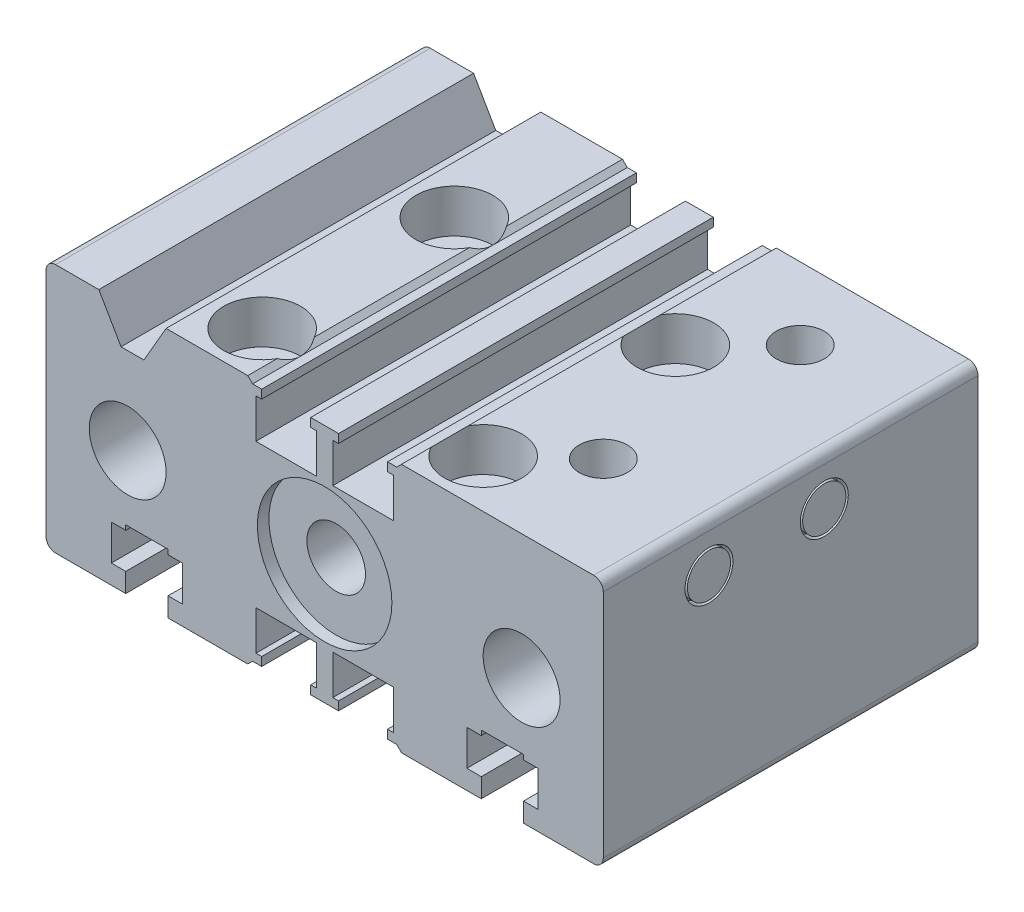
ISO-10303-21;
HEADER;
FILE_DESCRIPTION(('STEP AP214'),'2;1');
FILE_NAME('part.step','',(''),(''),'','','');
FILE_SCHEMA(('AUTOMOTIVE_DESIGN { 1 0 10303 214 1 1 1 1 }'));
ENDSEC;
DATA;
#1=APPLICATION_CONTEXT('core data for automotive mechanical design processes');
#2=APPLICATION_PROTOCOL_DEFINITION('international standard','automotive_design',2000,#1);
#3=PRODUCT_CONTEXT('',#1,'mechanical');
#4=PRODUCT('Part','Part','',(#3));
#5=PRODUCT_RELATED_PRODUCT_CATEGORY('part','',(#4));
#6=PRODUCT_DEFINITION_FORMATION('','',#4);
#7=PRODUCT_DEFINITION_CONTEXT('part definition',#1,'design');
#8=PRODUCT_DEFINITION('design','',#6,#7);
#9=PRODUCT_DEFINITION_SHAPE('','',#8);
#10=(LENGTH_UNIT() NAMED_UNIT(*) SI_UNIT(.MILLI.,.METRE.));
#11=(NAMED_UNIT(*) PLANE_ANGLE_UNIT() SI_UNIT($,.RADIAN.));
#12=(NAMED_UNIT(*) SI_UNIT($,.STERADIAN.) SOLID_ANGLE_UNIT());
#13=UNCERTAINTY_MEASURE_WITH_UNIT(LENGTH_MEASURE(1.E-05),#10,'distance_accuracy_value','');
#14=(GEOMETRIC_REPRESENTATION_CONTEXT(3) GLOBAL_UNCERTAINTY_ASSIGNED_CONTEXT((#13)) GLOBAL_UNIT_ASSIGNED_CONTEXT((#10,
#11,#12)) REPRESENTATION_CONTEXT('',''));
#15=CARTESIAN_POINT('',(0.,0.,0.));
#16=DIRECTION('',(0.,0.,1.));
#17=DIRECTION('',(1.,0.,0.));
#18=AXIS2_PLACEMENT_3D('',#15,#16,#17);
#19=CARTESIAN_POINT('',(0.,0.,-19.5));
#20=DIRECTION('',(0.,0.,1.));
#21=DIRECTION('',(1.,0.,0.));
#22=AXIS2_PLACEMENT_3D('',#19,#20,#21);
#23=PLANE('',#22);
#24=CARTESIAN_POINT('',(0.,0.,-19.5));
#25=DIRECTION('',(0.,0.,1.));
#26=DIRECTION('',(1.,0.,0.));
#27=AXIS2_PLACEMENT_3D('',#24,#25,#26);
#28=CIRCLE('',#27,7.);
#29=CARTESIAN_POINT('',(7.,0.,-19.5));
#30=VERTEX_POINT('',#29);
#31=EDGE_CURVE('E757',#30,#30,#28,.T.);
#32=ORIENTED_EDGE('',*,*,#31,.T.);
#33=EDGE_LOOP('',(#32));
#34=FACE_BOUND('',#33,.T.);
#35=CARTESIAN_POINT('',(-20.5,0.,-19.5));
#36=DIRECTION('',(0.,0.,1.));
#37=DIRECTION('',(-1.,0.,0.));
#38=AXIS2_PLACEMENT_3D('',#35,#36,#37);
#39=CIRCLE('',#38,4.);
#40=CARTESIAN_POINT('',(-24.5,0.,-19.5));
#41=VERTEX_POINT('',#40);
#42=EDGE_CURVE('E778',#41,#41,#39,.T.);
#43=ORIENTED_EDGE('',*,*,#42,.T.);
#44=EDGE_LOOP('',(#43));
#45=FACE_BOUND('',#44,.T.);
#46=CARTESIAN_POINT('',(20.5,0.,-19.5));
#47=DIRECTION('',(0.,0.,1.));
#48=DIRECTION('',(1.,0.,0.));
#49=AXIS2_PLACEMENT_3D('',#46,#47,#48);
#50=CIRCLE('',#49,4.);
#51=CARTESIAN_POINT('',(24.5,0.,-19.5));
#52=VERTEX_POINT('',#51);
#53=EDGE_CURVE('E784',#52,#52,#50,.T.);
#54=ORIENTED_EDGE('',*,*,#53,.T.);
#55=EDGE_LOOP('',(#54));
#56=FACE_BOUND('',#55,.T.);
#57=CARTESIAN_POINT('',(-25.,-9.,-19.5));
#58=DIRECTION('',(0.,0.,1.));
#59=DIRECTION('',(1.,0.,0.));
#60=AXIS2_PLACEMENT_3D('',#57,#58,#59);
#61=CIRCLE('',#60,2.);
#62=CARTESIAN_POINT('',(-23.,-9.,-19.5));
#63=VERTEX_POINT('',#62);
#64=EDGE_CURVE('E793',#63,#63,#61,.T.);
#65=ORIENTED_EDGE('',*,*,#64,.T.);
#66=EDGE_LOOP('',(#65));
#67=FACE_BOUND('',#66,.T.);
#68=CARTESIAN_POINT('',(25.,9.,-19.5));
#69=DIRECTION('',(0.,0.,1.));
#70=DIRECTION('',(1.,0.,0.));
#71=AXIS2_PLACEMENT_3D('',#68,#69,#70);
#72=CIRCLE('',#71,2.);
#73=CARTESIAN_POINT('',(27.,9.,-19.5));
#74=VERTEX_POINT('',#73);
#75=EDGE_CURVE('E805',#74,#74,#72,.T.);
#76=ORIENTED_EDGE('',*,*,#75,.T.);
#77=EDGE_LOOP('',(#76));
#78=FACE_BOUND('',#77,.T.);
#79=CARTESIAN_POINT('',(25.,-9.,-19.5));
#80=DIRECTION('',(0.,0.,1.));
#81=DIRECTION('',(-1.,0.,0.));
#82=AXIS2_PLACEMENT_3D('',#79,#80,#81);
#83=CIRCLE('',#82,2.);
#84=CARTESIAN_POINT('',(23.,-9.,-19.5));
#85=VERTEX_POINT('',#84);
#86=EDGE_CURVE('E799',#85,#85,#83,.T.);
#87=ORIENTED_EDGE('',*,*,#86,.T.);
#88=EDGE_LOOP('',(#87));
#89=FACE_BOUND('',#88,.T.);
#90=CARTESIAN_POINT('',(-25.,9.,-19.5));
#91=DIRECTION('',(0.,0.,1.));
#92=DIRECTION('',(-1.,0.,0.));
#93=AXIS2_PLACEMENT_3D('',#90,#91,#92);
#94=CIRCLE('',#93,2.);
#95=CARTESIAN_POINT('',(-27.,9.,-19.5));
#96=VERTEX_POINT('',#95);
#97=EDGE_CURVE('E787',#96,#96,#94,.T.);
#98=ORIENTED_EDGE('',*,*,#97,.T.);
#99=EDGE_LOOP('',(#98));
#100=FACE_BOUND('',#99,.T.);
#101=DIRECTION('',(1.,0.,0.));
#102=VECTOR('',#101,1.);
#103=CARTESIAN_POINT('',(-7.50000000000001,-12.5,-19.5));
#104=LINE('',#103,#102);
#105=CARTESIAN_POINT('',(-1.45,-12.5,-19.5));
#106=VERTEX_POINT('',#105);
#107=CARTESIAN_POINT('',(1.45,-12.5,-19.5));
#108=VERTEX_POINT('',#107);
#109=EDGE_CURVE('E571',#106,#108,#104,.T.);
#110=ORIENTED_EDGE('',*,*,#109,.F.);
#111=DIRECTION('',(0.,1.,0.));
#112=VECTOR('',#111,1.);
#113=CARTESIAN_POINT('',(-1.45,-13.,-19.5));
#114=LINE('',#113,#112);
#115=CARTESIAN_POINT('',(-1.45,-11.6,-19.5));
#116=VERTEX_POINT('',#115);
#117=EDGE_CURVE('E981',#106,#116,#114,.T.);
#118=ORIENTED_EDGE('',*,*,#117,.T.);
#119=DIRECTION('',(1.,0.,0.));
#120=VECTOR('',#119,1.);
#121=CARTESIAN_POINT('',(-1.45,-11.6,-19.5));
#122=LINE('',#121,#120);
#123=CARTESIAN_POINT('',(-0.849999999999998,-11.6,-19.5));
#124=VERTEX_POINT('',#123);
#125=EDGE_CURVE('E983',#116,#124,#122,.T.);
#126=ORIENTED_EDGE('',*,*,#125,.T.);
#127=DIRECTION('',(0.,1.,0.));
#128=VECTOR('',#127,1.);
#129=CARTESIAN_POINT('',(-0.849999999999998,-11.6,-19.5));
#130=LINE('',#129,#128);
#131=CARTESIAN_POINT('',(-0.850000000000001,-7.50000000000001,-19.5));
#132=VERTEX_POINT('',#131);
#133=EDGE_CURVE('E986',#124,#132,#130,.T.);
#134=ORIENTED_EDGE('',*,*,#133,.T.);
#135=DIRECTION('',(-1.,0.,0.));
#136=VECTOR('',#135,1.);
#137=CARTESIAN_POINT('',(-7.15,-7.50000000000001,-19.5));
#138=LINE('',#137,#136);
#139=CARTESIAN_POINT('',(-7.15,-7.50000000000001,-19.5));
#140=VERTEX_POINT('',#139);
#141=EDGE_CURVE('E989',#132,#140,#138,.T.);
#142=ORIENTED_EDGE('',*,*,#141,.T.);
#143=DIRECTION('',(0.,-1.,0.));
#144=VECTOR('',#143,1.);
#145=CARTESIAN_POINT('',(-7.15,-11.6,-19.5));
#146=LINE('',#145,#144);
#147=CARTESIAN_POINT('',(-7.15,-11.6,-19.5));
#148=VERTEX_POINT('',#147);
#149=EDGE_CURVE('E992',#140,#148,#146,.T.);
#150=ORIENTED_EDGE('',*,*,#149,.T.);
#151=DIRECTION('',(1.,0.,0.));
#152=VECTOR('',#151,1.);
#153=CARTESIAN_POINT('',(-6.55,-11.6,-19.5));
#154=LINE('',#153,#152);
#155=CARTESIAN_POINT('',(-6.55,-11.6,-19.5));
#156=VERTEX_POINT('',#155);
#157=EDGE_CURVE('E995',#148,#156,#154,.T.);
#158=ORIENTED_EDGE('',*,*,#157,.T.);
#159=DIRECTION('',(0.,-1.,0.));
#160=VECTOR('',#159,1.);
#161=CARTESIAN_POINT('',(-6.55,-13.,-19.5));
#162=LINE('',#161,#160);
#163=CARTESIAN_POINT('',(-6.55,-12.5,-19.5));
#164=VERTEX_POINT('',#163);
#165=EDGE_CURVE('E998',#156,#164,#162,.T.);
#166=ORIENTED_EDGE('',*,*,#165,.T.);
#167=CARTESIAN_POINT('',(-7.50000000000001,-12.5,-19.5));
#168=VERTEX_POINT('',#167);
#169=EDGE_CURVE('E46',#168,#164,#104,.T.);
#170=ORIENTED_EDGE('',*,*,#169,.F.);
#171=DIRECTION('',(0.707106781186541,0.707106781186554,0.));
#172=VECTOR('',#171,1.);
#173=CARTESIAN_POINT('',(-8.,-13.,-19.5));
#174=LINE('',#173,#172);
#175=CARTESIAN_POINT('',(-8.,-13.,-19.5));
#176=VERTEX_POINT('',#175);
#177=EDGE_CURVE('E546',#176,#168,#174,.T.);
#178=ORIENTED_EDGE('',*,*,#177,.F.);
#179=DIRECTION('',(-1.,0.,0.));
#180=VECTOR('',#179,1.);
#181=CARTESIAN_POINT('',(-29.,-13.,-19.5));
#182=LINE('',#181,#180);
#183=CARTESIAN_POINT('',(-16.3,-13.,-19.5));
#184=VERTEX_POINT('',#183);
#185=EDGE_CURVE('E1212',#176,#184,#182,.T.);
#186=ORIENTED_EDGE('',*,*,#185,.T.);
#187=DIRECTION('',(0.,1.,0.));
#188=VECTOR('',#187,1.);
#189=CARTESIAN_POINT('',(-16.3,-13.,-19.5));
#190=LINE('',#189,#188);
#191=CARTESIAN_POINT('',(-16.3,-11.,-19.5));
#192=VERTEX_POINT('',#191);
#193=EDGE_CURVE('E1138',#184,#192,#190,.T.);
#194=ORIENTED_EDGE('',*,*,#193,.T.);
#195=DIRECTION('',(1.,0.,0.));
#196=VECTOR('',#195,1.);
#197=CARTESIAN_POINT('',(-16.3,-11.,-19.5));
#198=LINE('',#197,#196);
#199=CARTESIAN_POINT('',(-14.8,-11.,-19.5));
#200=VERTEX_POINT('',#199);
#201=EDGE_CURVE('E1141',#192,#200,#198,.T.);
#202=ORIENTED_EDGE('',*,*,#201,.T.);
#203=DIRECTION('',(0.,1.,0.));
#204=VECTOR('',#203,1.);
#205=CARTESIAN_POINT('',(-14.8,-11.,-19.5));
#206=LINE('',#205,#204);
#207=CARTESIAN_POINT('',(-14.8,-7.3,-19.5));
#208=VERTEX_POINT('',#207);
#209=EDGE_CURVE('E1144',#200,#208,#206,.T.);
#210=ORIENTED_EDGE('',*,*,#209,.T.);
#211=DIRECTION('',(-1.,0.,0.));
#212=VECTOR('',#211,1.);
#213=CARTESIAN_POINT('',(-14.8,-7.3,-19.5));
#214=LINE('',#213,#212);
#215=CARTESIAN_POINT('',(-16.3,-7.3,-19.5));
#216=VERTEX_POINT('',#215);
#217=EDGE_CURVE('E1147',#208,#216,#214,.T.);
#218=ORIENTED_EDGE('',*,*,#217,.T.);
#219=DIRECTION('',(0.,1.,0.));
#220=VECTOR('',#219,1.);
#221=CARTESIAN_POINT('',(-16.3,-7.3,-19.5));
#222=LINE('',#221,#220);
#223=CARTESIAN_POINT('',(-16.3,-6.8,-19.5));
#224=VERTEX_POINT('',#223);
#225=EDGE_CURVE('E1150',#216,#224,#222,.T.);
#226=ORIENTED_EDGE('',*,*,#225,.T.);
#227=DIRECTION('',(-1.,0.,0.));
#228=VECTOR('',#227,1.);
#229=CARTESIAN_POINT('',(-20.7,-6.8,-19.5));
#230=LINE('',#229,#228);
#231=CARTESIAN_POINT('',(-20.7,-6.8,-19.5));
#232=VERTEX_POINT('',#231);
#233=EDGE_CURVE('E1153',#224,#232,#230,.T.);
#234=ORIENTED_EDGE('',*,*,#233,.T.);
#235=DIRECTION('',(0.,-1.,0.));
#236=VECTOR('',#235,1.);
#237=CARTESIAN_POINT('',(-20.7,-7.3,-19.5));
#238=LINE('',#237,#236);
#239=CARTESIAN_POINT('',(-20.7,-7.3,-19.5));
#240=VERTEX_POINT('',#239);
#241=EDGE_CURVE('E1156',#232,#240,#238,.T.);
#242=ORIENTED_EDGE('',*,*,#241,.T.);
#243=DIRECTION('',(-1.,0.,0.));
#244=VECTOR('',#243,1.);
#245=CARTESIAN_POINT('',(-22.2,-7.3,-19.5));
#246=LINE('',#245,#244);
#247=CARTESIAN_POINT('',(-22.2,-7.3,-19.5));
#248=VERTEX_POINT('',#247);
#249=EDGE_CURVE('E1159',#240,#248,#246,.T.);
#250=ORIENTED_EDGE('',*,*,#249,.T.);
#251=DIRECTION('',(0.,-1.,0.));
#252=VECTOR('',#251,1.);
#253=CARTESIAN_POINT('',(-22.2,-11.,-19.5));
#254=LINE('',#253,#252);
#255=CARTESIAN_POINT('',(-22.2,-11.,-19.5));
#256=VERTEX_POINT('',#255);
#257=EDGE_CURVE('E1162',#248,#256,#254,.T.);
#258=ORIENTED_EDGE('',*,*,#257,.T.);
#259=DIRECTION('',(1.,0.,0.));
#260=VECTOR('',#259,1.);
#261=CARTESIAN_POINT('',(-20.7,-11.,-19.5));
#262=LINE('',#261,#260);
#263=CARTESIAN_POINT('',(-20.7,-11.,-19.5));
#264=VERTEX_POINT('',#263);
#265=EDGE_CURVE('E1165',#256,#264,#262,.T.);
#266=ORIENTED_EDGE('',*,*,#265,.T.);
#267=DIRECTION('',(0.,-1.,0.));
#268=VECTOR('',#267,1.);
#269=CARTESIAN_POINT('',(-20.7,-13.,-19.5));
#270=LINE('',#269,#268);
#271=CARTESIAN_POINT('',(-20.7,-13.,-19.5));
#272=VERTEX_POINT('',#271);
#273=EDGE_CURVE('E1168',#264,#272,#270,.T.);
#274=ORIENTED_EDGE('',*,*,#273,.T.);
#275=CARTESIAN_POINT('',(-28.,-13.,-19.5));
#276=VERTEX_POINT('',#275);
#277=EDGE_CURVE('E1207',#272,#276,#182,.T.);
#278=ORIENTED_EDGE('',*,*,#277,.T.);
#279=CARTESIAN_POINT('',(-28.,-12.,-19.5));
#280=DIRECTION('',(0.,0.,1.));
#281=DIRECTION('',(1.,0.,0.));
#282=AXIS2_PLACEMENT_3D('',#279,#280,#281);
#283=CIRCLE('',#282,1.);
#284=CARTESIAN_POINT('',(-29.,-12.,-19.5));
#285=VERTEX_POINT('',#284);
#286=EDGE_CURVE('E1230',#276,#285,#283,.F.);
#287=ORIENTED_EDGE('',*,*,#286,.T.);
#288=DIRECTION('',(0.,1.,0.));
#289=VECTOR('',#288,1.);
#290=CARTESIAN_POINT('',(-29.,13.,-19.5));
#291=LINE('',#290,#289);
#292=CARTESIAN_POINT('',(-29.,12.,-19.5));
#293=VERTEX_POINT('',#292);
#294=EDGE_CURVE('E1203',#285,#293,#291,.T.);
#295=ORIENTED_EDGE('',*,*,#294,.T.);
#296=CARTESIAN_POINT('',(-28.,12.,-19.5));
#297=DIRECTION('',(0.,0.,1.));
#298=DIRECTION('',(1.,0.,0.));
#299=AXIS2_PLACEMENT_3D('',#296,#297,#298);
#300=CIRCLE('',#299,1.);
#301=CARTESIAN_POINT('',(-28.,13.,-19.5));
#302=VERTEX_POINT('',#301);
#303=EDGE_CURVE('E1232',#293,#302,#300,.F.);
#304=ORIENTED_EDGE('',*,*,#303,.T.);
#305=DIRECTION('',(1.,0.,0.));
#306=VECTOR('',#305,1.);
#307=CARTESIAN_POINT('',(-29.,13.,-19.5));
#308=LINE('',#307,#306);
#309=CARTESIAN_POINT('',(-23.5,13.,-19.5));
#310=VERTEX_POINT('',#309);
#311=EDGE_CURVE('E1200',#302,#310,#308,.T.);
#312=ORIENTED_EDGE('',*,*,#311,.T.);
#313=DIRECTION('',(0.5,-0.866025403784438,0.));
#314=VECTOR('',#313,1.);
#315=CARTESIAN_POINT('',(-23.5,13.,-19.5));
#316=LINE('',#315,#314);
#317=CARTESIAN_POINT('',(-21.1905989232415,9.,-19.5));
#318=VERTEX_POINT('',#317);
#319=EDGE_CURVE('E598',#310,#318,#316,.T.);
#320=ORIENTED_EDGE('',*,*,#319,.T.);
#321=DIRECTION('',(1.,0.,0.));
#322=VECTOR('',#321,1.);
#323=CARTESIAN_POINT('',(-21.1905989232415,9.,-19.5));
#324=LINE('',#323,#322);
#325=CARTESIAN_POINT('',(-18.8094010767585,9.,-19.5));
#326=VERTEX_POINT('',#325);
#327=EDGE_CURVE('E592',#318,#326,#324,.T.);
#328=ORIENTED_EDGE('',*,*,#327,.T.);
#329=DIRECTION('',(0.5,0.866025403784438,0.));
#330=VECTOR('',#329,1.);
#331=CARTESIAN_POINT('',(-16.5,13.,-19.5));
#332=LINE('',#331,#330);
#333=CARTESIAN_POINT('',(-16.5,13.,-19.5));
#334=VERTEX_POINT('',#333);
#335=EDGE_CURVE('E595',#326,#334,#332,.T.);
#336=ORIENTED_EDGE('',*,*,#335,.T.);
#337=CARTESIAN_POINT('',(-8.,13.,-19.5));
#338=VERTEX_POINT('',#337);
#339=EDGE_CURVE('E1204',#334,#338,#308,.T.);
#340=ORIENTED_EDGE('',*,*,#339,.T.);
#341=DIRECTION('',(0.707106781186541,-0.707106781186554,0.));
#342=VECTOR('',#341,1.);
#343=CARTESIAN_POINT('',(-8.,13.,-19.5));
#344=LINE('',#343,#342);
#345=CARTESIAN_POINT('',(-7.50000000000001,12.5,-19.5));
#346=VERTEX_POINT('',#345);
#347=EDGE_CURVE('E627',#338,#346,#344,.T.);
#348=ORIENTED_EDGE('',*,*,#347,.T.);
#349=DIRECTION('',(1.,0.,0.));
#350=VECTOR('',#349,1.);
#351=CARTESIAN_POINT('',(-7.50000000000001,12.5,-19.5));
#352=LINE('',#351,#350);
#353=CARTESIAN_POINT('',(-6.55,12.5,-19.5));
#354=VERTEX_POINT('',#353);
#355=EDGE_CURVE('E620',#346,#354,#352,.T.);
#356=ORIENTED_EDGE('',*,*,#355,.T.);
#357=DIRECTION('',(0.,1.,0.));
#358=VECTOR('',#357,1.);
#359=CARTESIAN_POINT('',(-6.55,13.,-19.5));
#360=LINE('',#359,#358);
#361=CARTESIAN_POINT('',(-6.55,11.6,-19.5));
#362=VERTEX_POINT('',#361);
#363=EDGE_CURVE('E880',#362,#354,#360,.T.);
#364=ORIENTED_EDGE('',*,*,#363,.F.);
#365=DIRECTION('',(1.,0.,0.));
#366=VECTOR('',#365,1.);
#367=CARTESIAN_POINT('',(-6.55,11.6,-19.5));
#368=LINE('',#367,#366);
#369=CARTESIAN_POINT('',(-7.15,11.6,-19.5));
#370=VERTEX_POINT('',#369);
#371=EDGE_CURVE('E883',#370,#362,#368,.T.);
#372=ORIENTED_EDGE('',*,*,#371,.F.);
#373=DIRECTION('',(0.,1.,0.));
#374=VECTOR('',#373,1.);
#375=CARTESIAN_POINT('',(-7.15,11.6,-19.5));
#376=LINE('',#375,#374);
#377=CARTESIAN_POINT('',(-7.15,7.50000000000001,-19.5));
#378=VERTEX_POINT('',#377);
#379=EDGE_CURVE('E886',#378,#370,#376,.T.);
#380=ORIENTED_EDGE('',*,*,#379,.F.);
#381=DIRECTION('',(-1.,0.,0.));
#382=VECTOR('',#381,1.);
#383=CARTESIAN_POINT('',(-7.15,7.50000000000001,-19.5));
#384=LINE('',#383,#382);
#385=CARTESIAN_POINT('',(-0.850000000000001,7.50000000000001,-19.5));
#386=VERTEX_POINT('',#385);
#387=EDGE_CURVE('E888',#386,#378,#384,.T.);
#388=ORIENTED_EDGE('',*,*,#387,.F.);
#389=DIRECTION('',(0.,-1.,0.));
#390=VECTOR('',#389,1.);
#391=CARTESIAN_POINT('',(-0.849999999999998,11.6,-19.5));
#392=LINE('',#391,#390);
#393=CARTESIAN_POINT('',(-0.849999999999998,11.6,-19.5));
#394=VERTEX_POINT('',#393);
#395=EDGE_CURVE('E890',#394,#386,#392,.T.);
#396=ORIENTED_EDGE('',*,*,#395,.F.);
#397=DIRECTION('',(1.,0.,0.));
#398=VECTOR('',#397,1.);
#399=CARTESIAN_POINT('',(-1.45,11.6,-19.5));
#400=LINE('',#399,#398);
#401=CARTESIAN_POINT('',(-1.45,11.6,-19.5));
#402=VERTEX_POINT('',#401);
#403=EDGE_CURVE('E892',#402,#394,#400,.T.);
#404=ORIENTED_EDGE('',*,*,#403,.F.);
#405=DIRECTION('',(0.,-1.,0.));
#406=VECTOR('',#405,1.);
#407=CARTESIAN_POINT('',(-1.45,13.,-19.5));
#408=LINE('',#407,#406);
#409=CARTESIAN_POINT('',(-1.45,12.5,-19.5));
#410=VERTEX_POINT('',#409);
#411=EDGE_CURVE('E894',#410,#402,#408,.T.);
#412=ORIENTED_EDGE('',*,*,#411,.F.);
#413=CARTESIAN_POINT('',(1.45,12.5,-19.5));
#414=VERTEX_POINT('',#413);
#415=EDGE_CURVE('E624',#410,#414,#352,.T.);
#416=ORIENTED_EDGE('',*,*,#415,.T.);
#417=DIRECTION('',(0.,1.,0.));
#418=VECTOR('',#417,1.);
#419=CARTESIAN_POINT('',(1.45,13.,-19.5));
#420=LINE('',#419,#418);
#421=CARTESIAN_POINT('',(1.45,11.6,-19.5));
#422=VERTEX_POINT('',#421);
#423=EDGE_CURVE('E837',#422,#414,#420,.T.);
#424=ORIENTED_EDGE('',*,*,#423,.F.);
#425=DIRECTION('',(1.,0.,0.));
#426=VECTOR('',#425,1.);
#427=CARTESIAN_POINT('',(1.45,11.6,-19.5));
#428=LINE('',#427,#426);
#429=CARTESIAN_POINT('',(0.850000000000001,11.6,-19.5));
#430=VERTEX_POINT('',#429);
#431=EDGE_CURVE('E840',#430,#422,#428,.T.);
#432=ORIENTED_EDGE('',*,*,#431,.F.);
#433=DIRECTION('',(0.,1.,0.));
#434=VECTOR('',#433,1.);
#435=CARTESIAN_POINT('',(0.850000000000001,11.6,-19.5));
#436=LINE('',#435,#434);
#437=CARTESIAN_POINT('',(0.850000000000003,7.50000000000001,-19.5));
#438=VERTEX_POINT('',#437);
#439=EDGE_CURVE('E842',#438,#430,#436,.T.);
#440=ORIENTED_EDGE('',*,*,#439,.F.);
#441=DIRECTION('',(-1.,0.,0.));
#442=VECTOR('',#441,1.);
#443=CARTESIAN_POINT('',(7.15,7.50000000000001,-19.5));
#444=LINE('',#443,#442);
#445=CARTESIAN_POINT('',(7.15,7.50000000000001,-19.5));
#446=VERTEX_POINT('',#445);
#447=EDGE_CURVE('E844',#446,#438,#444,.T.);
#448=ORIENTED_EDGE('',*,*,#447,.F.);
#449=DIRECTION('',(0.,-1.,0.));
#450=VECTOR('',#449,1.);
#451=CARTESIAN_POINT('',(7.15,11.6,-19.5));
#452=LINE('',#451,#450);
#453=CARTESIAN_POINT('',(7.15,11.6,-19.5));
#454=VERTEX_POINT('',#453);
#455=EDGE_CURVE('E831',#454,#446,#452,.T.);
#456=ORIENTED_EDGE('',*,*,#455,.F.);
#457=DIRECTION('',(1.,0.,0.));
#458=VECTOR('',#457,1.);
#459=CARTESIAN_POINT('',(6.55,11.6,-19.5));
#460=LINE('',#459,#458);
#461=CARTESIAN_POINT('',(6.55,11.6,-19.5));
#462=VERTEX_POINT('',#461);
#463=EDGE_CURVE('E833',#462,#454,#460,.T.);
#464=ORIENTED_EDGE('',*,*,#463,.F.);
#465=DIRECTION('',(0.,-1.,0.));
#466=VECTOR('',#465,1.);
#467=CARTESIAN_POINT('',(6.55,13.,-19.5));
#468=LINE('',#467,#466);
#469=CARTESIAN_POINT('',(6.55,12.5,-19.5));
#470=VERTEX_POINT('',#469);
#471=EDGE_CURVE('E835',#470,#462,#468,.T.);
#472=ORIENTED_EDGE('',*,*,#471,.F.);
#473=CARTESIAN_POINT('',(7.50000000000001,12.5,-19.5));
#474=VERTEX_POINT('',#473);
#475=EDGE_CURVE('E619',#470,#474,#352,.T.);
#476=ORIENTED_EDGE('',*,*,#475,.T.);
#477=DIRECTION('',(0.707106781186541,0.707106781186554,0.));
#478=VECTOR('',#477,1.);
#479=CARTESIAN_POINT('',(8.,13.,-19.5));
#480=LINE('',#479,#478);
#481=CARTESIAN_POINT('',(8.,13.,-19.5));
#482=VERTEX_POINT('',#481);
#483=EDGE_CURVE('E623',#474,#482,#480,.T.);
#484=ORIENTED_EDGE('',*,*,#483,.T.);
#485=CARTESIAN_POINT('',(28.,13.,-19.5));
#486=VERTEX_POINT('',#485);
#487=EDGE_CURVE('E1199',#482,#486,#308,.T.);
#488=ORIENTED_EDGE('',*,*,#487,.T.);
#489=CARTESIAN_POINT('',(28.,12.,-19.5));
#490=DIRECTION('',(0.,0.,1.));
#491=DIRECTION('',(1.,0.,0.));
#492=AXIS2_PLACEMENT_3D('',#489,#490,#491);
#493=CIRCLE('',#492,1.);
#494=CARTESIAN_POINT('',(29.,12.,-19.5));
#495=VERTEX_POINT('',#494);
#496=EDGE_CURVE('E1236',#486,#495,#493,.F.);
#497=ORIENTED_EDGE('',*,*,#496,.T.);
#498=DIRECTION('',(0.,-1.,0.));
#499=VECTOR('',#498,1.);
#500=CARTESIAN_POINT('',(29.,13.,-19.5));
#501=LINE('',#500,#499);
#502=CARTESIAN_POINT('',(29.,-12.,-19.5));
#503=VERTEX_POINT('',#502);
#504=EDGE_CURVE('E1175',#495,#503,#501,.T.);
#505=ORIENTED_EDGE('',*,*,#504,.T.);
#506=CARTESIAN_POINT('',(28.,-12.,-19.5));
#507=DIRECTION('',(0.,0.,1.));
#508=DIRECTION('',(1.,0.,0.));
#509=AXIS2_PLACEMENT_3D('',#506,#507,#508);
#510=CIRCLE('',#509,1.);
#511=CARTESIAN_POINT('',(28.,-13.,-19.5));
#512=VERTEX_POINT('',#511);
#513=EDGE_CURVE('E1234',#503,#512,#510,.F.);
#514=ORIENTED_EDGE('',*,*,#513,.T.);
#515=CARTESIAN_POINT('',(20.7,-13.,-19.5));
#516=VERTEX_POINT('',#515);
#517=EDGE_CURVE('E1208',#512,#516,#182,.T.);
#518=ORIENTED_EDGE('',*,*,#517,.T.);
#519=DIRECTION('',(0.,1.,0.));
#520=VECTOR('',#519,1.);
#521=CARTESIAN_POINT('',(20.7,-13.,-19.5));
#522=LINE('',#521,#520);
#523=CARTESIAN_POINT('',(20.7,-11.,-19.5));
#524=VERTEX_POINT('',#523);
#525=EDGE_CURVE('E1068',#516,#524,#522,.T.);
#526=ORIENTED_EDGE('',*,*,#525,.T.);
#527=DIRECTION('',(1.,0.,0.));
#528=VECTOR('',#527,1.);
#529=CARTESIAN_POINT('',(20.7,-11.,-19.5));
#530=LINE('',#529,#528);
#531=CARTESIAN_POINT('',(22.2,-11.,-19.5));
#532=VERTEX_POINT('',#531);
#533=EDGE_CURVE('E1071',#524,#532,#530,.T.);
#534=ORIENTED_EDGE('',*,*,#533,.T.);
#535=DIRECTION('',(0.,1.,0.));
#536=VECTOR('',#535,1.);
#537=CARTESIAN_POINT('',(22.2,-11.,-19.5));
#538=LINE('',#537,#536);
#539=CARTESIAN_POINT('',(22.2,-7.29999999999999,-19.5));
#540=VERTEX_POINT('',#539);
#541=EDGE_CURVE('E1074',#532,#540,#538,.T.);
#542=ORIENTED_EDGE('',*,*,#541,.T.);
#543=DIRECTION('',(-1.,0.,0.));
#544=VECTOR('',#543,1.);
#545=CARTESIAN_POINT('',(22.2,-7.29999999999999,-19.5));
#546=LINE('',#545,#544);
#547=CARTESIAN_POINT('',(20.7,-7.29999999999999,-19.5));
#548=VERTEX_POINT('',#547);
#549=EDGE_CURVE('E1077',#540,#548,#546,.T.);
#550=ORIENTED_EDGE('',*,*,#549,.T.);
#551=DIRECTION('',(0.,1.,0.));
#552=VECTOR('',#551,1.);
#553=CARTESIAN_POINT('',(20.7,-7.29999999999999,-19.5));
#554=LINE('',#553,#552);
#555=CARTESIAN_POINT('',(20.7,-6.79999999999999,-19.5));
#556=VERTEX_POINT('',#555);
#557=EDGE_CURVE('E1047',#548,#556,#554,.T.);
#558=ORIENTED_EDGE('',*,*,#557,.T.);
#559=DIRECTION('',(-1.,0.,0.));
#560=VECTOR('',#559,1.);
#561=CARTESIAN_POINT('',(20.7,-6.79999999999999,-19.5));
#562=LINE('',#561,#560);
#563=CARTESIAN_POINT('',(16.3,-6.79999999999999,-19.5));
#564=VERTEX_POINT('',#563);
#565=EDGE_CURVE('E1050',#556,#564,#562,.T.);
#566=ORIENTED_EDGE('',*,*,#565,.T.);
#567=DIRECTION('',(0.,-1.,0.));
#568=VECTOR('',#567,1.);
#569=CARTESIAN_POINT('',(16.3,-7.29999999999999,-19.5));
#570=LINE('',#569,#568);
#571=CARTESIAN_POINT('',(16.3,-7.29999999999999,-19.5));
#572=VERTEX_POINT('',#571);
#573=EDGE_CURVE('E1053',#564,#572,#570,.T.);
#574=ORIENTED_EDGE('',*,*,#573,.T.);
#575=DIRECTION('',(-1.,0.,0.));
#576=VECTOR('',#575,1.);
#577=CARTESIAN_POINT('',(14.8,-7.29999999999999,-19.5));
#578=LINE('',#577,#576);
#579=CARTESIAN_POINT('',(14.8,-7.29999999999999,-19.5));
#580=VERTEX_POINT('',#579);
#581=EDGE_CURVE('E1056',#572,#580,#578,.T.);
#582=ORIENTED_EDGE('',*,*,#581,.T.);
#583=DIRECTION('',(0.,-1.,0.));
#584=VECTOR('',#583,1.);
#585=CARTESIAN_POINT('',(14.8,-11.,-19.5));
#586=LINE('',#585,#584);
#587=CARTESIAN_POINT('',(14.8,-11.,-19.5));
#588=VERTEX_POINT('',#587);
#589=EDGE_CURVE('E1059',#580,#588,#586,.T.);
#590=ORIENTED_EDGE('',*,*,#589,.T.);
#591=DIRECTION('',(1.,0.,0.));
#592=VECTOR('',#591,1.);
#593=CARTESIAN_POINT('',(16.3,-11.,-19.5));
#594=LINE('',#593,#592);
#595=CARTESIAN_POINT('',(16.3,-11.,-19.5));
#596=VERTEX_POINT('',#595);
#597=EDGE_CURVE('E1062',#588,#596,#594,.T.);
#598=ORIENTED_EDGE('',*,*,#597,.T.);
#599=DIRECTION('',(0.,-1.,0.));
#600=VECTOR('',#599,1.);
#601=CARTESIAN_POINT('',(16.3,-13.,-19.5));
#602=LINE('',#601,#600);
#603=CARTESIAN_POINT('',(16.3,-13.,-19.5));
#604=VERTEX_POINT('',#603);
#605=EDGE_CURVE('E1065',#596,#604,#602,.T.);
#606=ORIENTED_EDGE('',*,*,#605,.T.);
#607=CARTESIAN_POINT('',(8.,-13.,-19.5));
#608=VERTEX_POINT('',#607);
#609=EDGE_CURVE('E1211',#604,#608,#182,.T.);
#610=ORIENTED_EDGE('',*,*,#609,.T.);
#611=DIRECTION('',(0.707106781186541,-0.707106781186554,0.));
#612=VECTOR('',#611,1.);
#613=CARTESIAN_POINT('',(8.,-13.,-19.5));
#614=LINE('',#613,#612);
#615=CARTESIAN_POINT('',(7.50000000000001,-12.5,-19.5));
#616=VERTEX_POINT('',#615);
#617=EDGE_CURVE('E548',#616,#608,#614,.T.);
#618=ORIENTED_EDGE('',*,*,#617,.F.);
#619=CARTESIAN_POINT('',(6.55,-12.5,-19.5));
#620=VERTEX_POINT('',#619);
#621=EDGE_CURVE('E567',#620,#616,#104,.T.);
#622=ORIENTED_EDGE('',*,*,#621,.F.);
#623=DIRECTION('',(0.,1.,0.));
#624=VECTOR('',#623,1.);
#625=CARTESIAN_POINT('',(6.55,-13.,-19.5));
#626=LINE('',#625,#624);
#627=CARTESIAN_POINT('',(6.55,-11.6,-19.5));
#628=VERTEX_POINT('',#627);
#629=EDGE_CURVE('E944',#620,#628,#626,.T.);
#630=ORIENTED_EDGE('',*,*,#629,.T.);
#631=DIRECTION('',(1.,0.,0.));
#632=VECTOR('',#631,1.);
#633=CARTESIAN_POINT('',(6.55,-11.6,-19.5));
#634=LINE('',#633,#632);
#635=CARTESIAN_POINT('',(7.15,-11.6,-19.5));
#636=VERTEX_POINT('',#635);
#637=EDGE_CURVE('E946',#628,#636,#634,.T.);
#638=ORIENTED_EDGE('',*,*,#637,.T.);
#639=DIRECTION('',(0.,1.,0.));
#640=VECTOR('',#639,1.);
#641=CARTESIAN_POINT('',(7.15,-11.6,-19.5));
#642=LINE('',#641,#640);
#643=CARTESIAN_POINT('',(7.15,-7.50000000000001,-19.5));
#644=VERTEX_POINT('',#643);
#645=EDGE_CURVE('E929',#636,#644,#642,.T.);
#646=ORIENTED_EDGE('',*,*,#645,.T.);
#647=DIRECTION('',(-1.,0.,0.));
#648=VECTOR('',#647,1.);
#649=CARTESIAN_POINT('',(7.15,-7.50000000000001,-19.5));
#650=LINE('',#649,#648);
#651=CARTESIAN_POINT('',(0.850000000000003,-7.50000000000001,-19.5));
#652=VERTEX_POINT('',#651);
#653=EDGE_CURVE('E932',#644,#652,#650,.T.);
#654=ORIENTED_EDGE('',*,*,#653,.T.);
#655=DIRECTION('',(0.,-1.,0.));
#656=VECTOR('',#655,1.);
#657=CARTESIAN_POINT('',(0.850000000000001,-11.6,-19.5));
#658=LINE('',#657,#656);
#659=CARTESIAN_POINT('',(0.850000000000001,-11.6,-19.5));
#660=VERTEX_POINT('',#659);
#661=EDGE_CURVE('E935',#652,#660,#658,.T.);
#662=ORIENTED_EDGE('',*,*,#661,.T.);
#663=DIRECTION('',(1.,0.,0.));
#664=VECTOR('',#663,1.);
#665=CARTESIAN_POINT('',(1.45,-11.6,-19.5));
#666=LINE('',#665,#664);
#667=CARTESIAN_POINT('',(1.45,-11.6,-19.5));
#668=VERTEX_POINT('',#667);
#669=EDGE_CURVE('E938',#660,#668,#666,.T.);
#670=ORIENTED_EDGE('',*,*,#669,.T.);
#671=DIRECTION('',(0.,-1.,0.));
#672=VECTOR('',#671,1.);
#673=CARTESIAN_POINT('',(1.45,-13.,-19.5));
#674=LINE('',#673,#672);
#675=EDGE_CURVE('E941',#668,#108,#674,.T.);
#676=ORIENTED_EDGE('',*,*,#675,.T.);
#677=EDGE_LOOP('',(#110,#118,#126,#134,#142,#150,#158,#166,#170,#178,#186,#194,#202,#210,#218,
#226,#234,#242,#250,#258,#266,#274,#278,#287,#295,#304,#312,#320,#328,#336,#340,#348,#356,#364,
#372,#380,#388,#396,#404,#412,#416,#424,#432,#440,#448,#456,#464,#472,#476,#484,#488,#497,#505,
#514,#518,#526,#534,#542,#550,#558,#566,#574,#582,#590,#598,#606,#610,#618,#622,#630,#638,#646,
#654,#662,#670,#676));
#678=FACE_BOUND('',#677,.T.);
#679=ADVANCED_FACE('F31',(#34,#45,#56,#67,#78,#89,#100,#678),#23,.F.);
#680=CARTESIAN_POINT('',(0.,0.,19.5));
#681=DIRECTION('',(0.,0.,1.));
#682=DIRECTION('',(1.,0.,0.));
#683=AXIS2_PLACEMENT_3D('',#680,#681,#682);
#684=PLANE('',#683);
#685=CARTESIAN_POINT('',(20.5,0.,19.5));
#686=DIRECTION('',(0.,0.,1.));
#687=DIRECTION('',(1.,0.,0.));
#688=AXIS2_PLACEMENT_3D('',#685,#686,#687);
#689=CIRCLE('',#688,4.);
#690=CARTESIAN_POINT('',(24.5,0.,19.5));
#691=VERTEX_POINT('',#690);
#692=EDGE_CURVE('E781',#691,#691,#689,.T.);
#693=ORIENTED_EDGE('',*,*,#692,.F.);
#694=EDGE_LOOP('',(#693));
#695=FACE_BOUND('',#694,.T.);
#696=CARTESIAN_POINT('',(-20.5,0.,19.5));
#697=DIRECTION('',(0.,0.,1.));
#698=DIRECTION('',(-1.,0.,0.));
#699=AXIS2_PLACEMENT_3D('',#696,#697,#698);
#700=CIRCLE('',#699,4.);
#701=CARTESIAN_POINT('',(-24.5,0.,19.5));
#702=VERTEX_POINT('',#701);
#703=EDGE_CURVE('E775',#702,#702,#700,.T.);
#704=ORIENTED_EDGE('',*,*,#703,.F.);
#705=EDGE_LOOP('',(#704));
#706=FACE_BOUND('',#705,.T.);
#707=CARTESIAN_POINT('',(0.,0.,19.5));
#708=DIRECTION('',(0.,0.,1.));
#709=DIRECTION('',(1.,0.,0.));
#710=AXIS2_PLACEMENT_3D('',#707,#708,#709);
#711=CIRCLE('',#710,7.);
#712=CARTESIAN_POINT('',(7.,0.,19.5));
#713=VERTEX_POINT('',#712);
#714=EDGE_CURVE('E763',#713,#713,#711,.T.);
#715=ORIENTED_EDGE('',*,*,#714,.F.);
#716=EDGE_LOOP('',(#715));
#717=FACE_BOUND('',#716,.T.);
#718=DIRECTION('',(0.,1.,0.));
#719=VECTOR('',#718,1.);
#720=CARTESIAN_POINT('',(-1.45,-13.,19.5));
#721=LINE('',#720,#719);
#722=CARTESIAN_POINT('',(-1.45,-12.5,19.5));
#723=VERTEX_POINT('',#722);
#724=CARTESIAN_POINT('',(-1.45,-11.6,19.5));
#725=VERTEX_POINT('',#724);
#726=EDGE_CURVE('E952',#723,#725,#721,.T.);
#727=ORIENTED_EDGE('',*,*,#726,.F.);
#728=DIRECTION('',(1.,0.,0.));
#729=VECTOR('',#728,1.);
#730=CARTESIAN_POINT('',(-7.50000000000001,-12.5,19.5));
#731=LINE('',#730,#729);
#732=CARTESIAN_POINT('',(1.45,-12.5,19.5));
#733=VERTEX_POINT('',#732);
#734=EDGE_CURVE('E557',#723,#733,#731,.T.);
#735=ORIENTED_EDGE('',*,*,#734,.T.);
#736=DIRECTION('',(0.,-1.,0.));
#737=VECTOR('',#736,1.);
#738=CARTESIAN_POINT('',(1.45,-13.,19.5));
#739=LINE('',#738,#737);
#740=CARTESIAN_POINT('',(1.45,-11.6,19.5));
#741=VERTEX_POINT('',#740);
#742=EDGE_CURVE('E921',#741,#733,#739,.T.);
#743=ORIENTED_EDGE('',*,*,#742,.F.);
#744=DIRECTION('',(1.,0.,0.));
#745=VECTOR('',#744,1.);
#746=CARTESIAN_POINT('',(1.45,-11.6,19.5));
#747=LINE('',#746,#745);
#748=CARTESIAN_POINT('',(0.850000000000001,-11.6,19.5));
#749=VERTEX_POINT('',#748);
#750=EDGE_CURVE('E918',#749,#741,#747,.T.);
#751=ORIENTED_EDGE('',*,*,#750,.F.);
#752=DIRECTION('',(0.,-1.,0.));
#753=VECTOR('',#752,1.);
#754=CARTESIAN_POINT('',(0.850000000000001,-11.6,19.5));
#755=LINE('',#754,#753);
#756=CARTESIAN_POINT('',(0.850000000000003,-7.50000000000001,19.5));
#757=VERTEX_POINT('',#756);
#758=EDGE_CURVE('E915',#757,#749,#755,.T.);
#759=ORIENTED_EDGE('',*,*,#758,.F.);
#760=DIRECTION('',(-1.,0.,0.));
#761=VECTOR('',#760,1.);
#762=CARTESIAN_POINT('',(7.15,-7.50000000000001,19.5));
#763=LINE('',#762,#761);
#764=CARTESIAN_POINT('',(7.15,-7.50000000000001,19.5));
#765=VERTEX_POINT('',#764);
#766=EDGE_CURVE('E912',#765,#757,#763,.T.);
#767=ORIENTED_EDGE('',*,*,#766,.F.);
#768=DIRECTION('',(0.,1.,0.));
#769=VECTOR('',#768,1.);
#770=CARTESIAN_POINT('',(7.15,-11.6,19.5));
#771=LINE('',#770,#769);
#772=CARTESIAN_POINT('',(7.15,-11.6,19.5));
#773=VERTEX_POINT('',#772);
#774=EDGE_CURVE('E900',#773,#765,#771,.T.);
#775=ORIENTED_EDGE('',*,*,#774,.F.);
#776=DIRECTION('',(1.,0.,0.));
#777=VECTOR('',#776,1.);
#778=CARTESIAN_POINT('',(6.55,-11.6,19.5));
#779=LINE('',#778,#777);
#780=CARTESIAN_POINT('',(6.55,-11.6,19.5));
#781=VERTEX_POINT('',#780);
#782=EDGE_CURVE('E926',#781,#773,#779,.T.);
#783=ORIENTED_EDGE('',*,*,#782,.F.);
#784=DIRECTION('',(0.,1.,0.));
#785=VECTOR('',#784,1.);
#786=CARTESIAN_POINT('',(6.55,-13.,19.5));
#787=LINE('',#786,#785);
#788=CARTESIAN_POINT('',(6.55,-12.5,19.5));
#789=VERTEX_POINT('',#788);
#790=EDGE_CURVE('E924',#789,#781,#787,.T.);
#791=ORIENTED_EDGE('',*,*,#790,.F.);
#792=CARTESIAN_POINT('',(7.50000000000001,-12.5,19.5));
#793=VERTEX_POINT('',#792);
#794=EDGE_CURVE('E54',#789,#793,#731,.T.);
#795=ORIENTED_EDGE('',*,*,#794,.T.);
#796=DIRECTION('',(0.707106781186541,-0.707106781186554,0.));
#797=VECTOR('',#796,1.);
#798=CARTESIAN_POINT('',(8.,-13.,19.5));
#799=LINE('',#798,#797);
#800=CARTESIAN_POINT('',(8.,-13.,19.5));
#801=VERTEX_POINT('',#800);
#802=EDGE_CURVE('E564',#793,#801,#799,.T.);
#803=ORIENTED_EDGE('',*,*,#802,.T.);
#804=DIRECTION('',(1.,0.,0.));
#805=VECTOR('',#804,1.);
#806=CARTESIAN_POINT('',(-29.,-13.,19.5));
#807=LINE('',#806,#805);
#808=CARTESIAN_POINT('',(16.3,-13.,19.5));
#809=VERTEX_POINT('',#808);
#810=EDGE_CURVE('E1219',#801,#809,#807,.T.);
#811=ORIENTED_EDGE('',*,*,#810,.T.);
#812=DIRECTION('',(0.,-1.,0.));
#813=VECTOR('',#812,1.);
#814=CARTESIAN_POINT('',(16.3,-13.,19.5));
#815=LINE('',#814,#813);
#816=CARTESIAN_POINT('',(16.3,-11.,19.5));
#817=VERTEX_POINT('',#816);
#818=EDGE_CURVE('E1032',#817,#809,#815,.T.);
#819=ORIENTED_EDGE('',*,*,#818,.F.);
#820=DIRECTION('',(1.,0.,0.));
#821=VECTOR('',#820,1.);
#822=CARTESIAN_POINT('',(16.3,-11.,19.5));
#823=LINE('',#822,#821);
#824=CARTESIAN_POINT('',(14.8,-11.,19.5));
#825=VERTEX_POINT('',#824);
#826=EDGE_CURVE('E1029',#825,#817,#823,.T.);
#827=ORIENTED_EDGE('',*,*,#826,.F.);
#828=DIRECTION('',(0.,-1.,0.));
#829=VECTOR('',#828,1.);
#830=CARTESIAN_POINT('',(14.8,-11.,19.5));
#831=LINE('',#830,#829);
#832=CARTESIAN_POINT('',(14.8,-7.29999999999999,19.5));
#833=VERTEX_POINT('',#832);
#834=EDGE_CURVE('E1026',#833,#825,#831,.T.);
#835=ORIENTED_EDGE('',*,*,#834,.F.);
#836=DIRECTION('',(-1.,0.,0.));
#837=VECTOR('',#836,1.);
#838=CARTESIAN_POINT('',(14.8,-7.29999999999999,19.5));
#839=LINE('',#838,#837);
#840=CARTESIAN_POINT('',(16.3,-7.29999999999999,19.5));
#841=VERTEX_POINT('',#840);
#842=EDGE_CURVE('E1023',#841,#833,#839,.T.);
#843=ORIENTED_EDGE('',*,*,#842,.F.);
#844=DIRECTION('',(0.,-1.,0.));
#845=VECTOR('',#844,1.);
#846=CARTESIAN_POINT('',(16.3,-7.29999999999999,19.5));
#847=LINE('',#846,#845);
#848=CARTESIAN_POINT('',(16.3,-6.79999999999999,19.5));
#849=VERTEX_POINT('',#848);
#850=EDGE_CURVE('E1020',#849,#841,#847,.T.);
#851=ORIENTED_EDGE('',*,*,#850,.F.);
#852=DIRECTION('',(-1.,0.,0.));
#853=VECTOR('',#852,1.);
#854=CARTESIAN_POINT('',(20.7,-6.79999999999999,19.5));
#855=LINE('',#854,#853);
#856=CARTESIAN_POINT('',(20.7,-6.79999999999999,19.5));
#857=VERTEX_POINT('',#856);
#858=EDGE_CURVE('E1017',#857,#849,#855,.T.);
#859=ORIENTED_EDGE('',*,*,#858,.F.);
#860=DIRECTION('',(0.,1.,0.));
#861=VECTOR('',#860,1.);
#862=CARTESIAN_POINT('',(20.7,-7.29999999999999,19.5));
#863=LINE('',#862,#861);
#864=CARTESIAN_POINT('',(20.7,-7.29999999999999,19.5));
#865=VERTEX_POINT('',#864);
#866=EDGE_CURVE('E1004',#865,#857,#863,.T.);
#867=ORIENTED_EDGE('',*,*,#866,.F.);
#868=DIRECTION('',(-1.,0.,0.));
#869=VECTOR('',#868,1.);
#870=CARTESIAN_POINT('',(22.2,-7.29999999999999,19.5));
#871=LINE('',#870,#869);
#872=CARTESIAN_POINT('',(22.2,-7.29999999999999,19.5));
#873=VERTEX_POINT('',#872);
#874=EDGE_CURVE('E1044',#873,#865,#871,.T.);
#875=ORIENTED_EDGE('',*,*,#874,.F.);
#876=DIRECTION('',(0.,1.,0.));
#877=VECTOR('',#876,1.);
#878=CARTESIAN_POINT('',(22.2,-11.,19.5));
#879=LINE('',#878,#877);
#880=CARTESIAN_POINT('',(22.2,-11.,19.5));
#881=VERTEX_POINT('',#880);
#882=EDGE_CURVE('E1041',#881,#873,#879,.T.);
#883=ORIENTED_EDGE('',*,*,#882,.F.);
#884=DIRECTION('',(1.,0.,0.));
#885=VECTOR('',#884,1.);
#886=CARTESIAN_POINT('',(20.7,-11.,19.5));
#887=LINE('',#886,#885);
#888=CARTESIAN_POINT('',(20.7,-11.,19.5));
#889=VERTEX_POINT('',#888);
#890=EDGE_CURVE('E1038',#889,#881,#887,.T.);
#891=ORIENTED_EDGE('',*,*,#890,.F.);
#892=DIRECTION('',(0.,1.,0.));
#893=VECTOR('',#892,1.);
#894=CARTESIAN_POINT('',(20.7,-13.,19.5));
#895=LINE('',#894,#893);
#896=CARTESIAN_POINT('',(20.7,-13.,19.5));
#897=VERTEX_POINT('',#896);
#898=EDGE_CURVE('E1035',#897,#889,#895,.T.);
#899=ORIENTED_EDGE('',*,*,#898,.F.);
#900=CARTESIAN_POINT('',(28.,-13.,19.5));
#901=VERTEX_POINT('',#900);
#902=EDGE_CURVE('E1223',#897,#901,#807,.T.);
#903=ORIENTED_EDGE('',*,*,#902,.T.);
#904=CARTESIAN_POINT('',(28.,-12.,19.5));
#905=DIRECTION('',(0.,0.,1.));
#906=DIRECTION('',(1.,0.,0.));
#907=AXIS2_PLACEMENT_3D('',#904,#905,#906);
#908=CIRCLE('',#907,1.);
#909=CARTESIAN_POINT('',(29.,-12.,19.5));
#910=VERTEX_POINT('',#909);
#911=EDGE_CURVE('E1247',#901,#910,#908,.T.);
#912=ORIENTED_EDGE('',*,*,#911,.T.);
#913=DIRECTION('',(0.,1.,0.));
#914=VECTOR('',#913,1.);
#915=CARTESIAN_POINT('',(29.,13.,19.5));
#916=LINE('',#915,#914);
#917=CARTESIAN_POINT('',(29.,12.,19.5));
#918=VERTEX_POINT('',#917);
#919=EDGE_CURVE('E1213',#910,#918,#916,.T.);
#920=ORIENTED_EDGE('',*,*,#919,.T.);
#921=CARTESIAN_POINT('',(28.,12.,19.5));
#922=DIRECTION('',(0.,0.,1.));
#923=DIRECTION('',(1.,0.,0.));
#924=AXIS2_PLACEMENT_3D('',#921,#922,#923);
#925=CIRCLE('',#924,1.);
#926=CARTESIAN_POINT('',(28.,13.,19.5));
#927=VERTEX_POINT('',#926);
#928=EDGE_CURVE('E1249',#918,#927,#925,.T.);
#929=ORIENTED_EDGE('',*,*,#928,.T.);
#930=DIRECTION('',(-1.,0.,0.));
#931=VECTOR('',#930,1.);
#932=CARTESIAN_POINT('',(-29.,13.,19.5));
#933=LINE('',#932,#931);
#934=CARTESIAN_POINT('',(8.,13.,19.5));
#935=VERTEX_POINT('',#934);
#936=EDGE_CURVE('E1224',#927,#935,#933,.T.);
#937=ORIENTED_EDGE('',*,*,#936,.T.);
#938=DIRECTION('',(0.707106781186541,0.707106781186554,0.));
#939=VECTOR('',#938,1.);
#940=CARTESIAN_POINT('',(8.,13.,19.5));
#941=LINE('',#940,#939);
#942=CARTESIAN_POINT('',(7.50000000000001,12.5,19.5));
#943=VERTEX_POINT('',#942);
#944=EDGE_CURVE('E613',#943,#935,#941,.T.);
#945=ORIENTED_EDGE('',*,*,#944,.F.);
#946=DIRECTION('',(1.,0.,0.));
#947=VECTOR('',#946,1.);
#948=CARTESIAN_POINT('',(-7.50000000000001,12.5,19.5));
#949=LINE('',#948,#947);
#950=CARTESIAN_POINT('',(6.55,12.5,19.5));
#951=VERTEX_POINT('',#950);
#952=EDGE_CURVE('E604',#951,#943,#949,.T.);
#953=ORIENTED_EDGE('',*,*,#952,.F.);
#954=DIRECTION('',(0.,-1.,0.));
#955=VECTOR('',#954,1.);
#956=CARTESIAN_POINT('',(6.55,13.,19.5));
#957=LINE('',#956,#955);
#958=CARTESIAN_POINT('',(6.55,11.6,19.5));
#959=VERTEX_POINT('',#958);
#960=EDGE_CURVE('E817',#951,#959,#957,.T.);
#961=ORIENTED_EDGE('',*,*,#960,.T.);
#962=DIRECTION('',(1.,0.,0.));
#963=VECTOR('',#962,1.);
#964=CARTESIAN_POINT('',(6.55,11.6,19.5));
#965=LINE('',#964,#963);
#966=CARTESIAN_POINT('',(7.15,11.6,19.5));
#967=VERTEX_POINT('',#966);
#968=EDGE_CURVE('E814',#959,#967,#965,.T.);
#969=ORIENTED_EDGE('',*,*,#968,.T.);
#970=DIRECTION('',(0.,-1.,0.));
#971=VECTOR('',#970,1.);
#972=CARTESIAN_POINT('',(7.15,11.6,19.5));
#973=LINE('',#972,#971);
#974=CARTESIAN_POINT('',(7.15,7.50000000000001,19.5));
#975=VERTEX_POINT('',#974);
#976=EDGE_CURVE('E811',#967,#975,#973,.T.);
#977=ORIENTED_EDGE('',*,*,#976,.T.);
#978=DIRECTION('',(-1.,0.,0.));
#979=VECTOR('',#978,1.);
#980=CARTESIAN_POINT('',(7.15,7.50000000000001,19.5));
#981=LINE('',#980,#979);
#982=CARTESIAN_POINT('',(0.850000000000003,7.50000000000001,19.5));
#983=VERTEX_POINT('',#982);
#984=EDGE_CURVE('E828',#975,#983,#981,.T.);
#985=ORIENTED_EDGE('',*,*,#984,.T.);
#986=DIRECTION('',(0.,1.,0.));
#987=VECTOR('',#986,1.);
#988=CARTESIAN_POINT('',(0.850000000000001,11.6,19.5));
#989=LINE('',#988,#987);
#990=CARTESIAN_POINT('',(0.850000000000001,11.6,19.5));
#991=VERTEX_POINT('',#990);
#992=EDGE_CURVE('E825',#983,#991,#989,.T.);
#993=ORIENTED_EDGE('',*,*,#992,.T.);
#994=DIRECTION('',(1.,0.,0.));
#995=VECTOR('',#994,1.);
#996=CARTESIAN_POINT('',(1.45,11.6,19.5));
#997=LINE('',#996,#995);
#998=CARTESIAN_POINT('',(1.45,11.6,19.5));
#999=VERTEX_POINT('',#998);
#1000=EDGE_CURVE('E822',#991,#999,#997,.T.);
#1001=ORIENTED_EDGE('',*,*,#1000,.T.);
#1002=DIRECTION('',(0.,1.,0.));
#1003=VECTOR('',#1002,1.);
#1004=CARTESIAN_POINT('',(1.45,13.,19.5));
#1005=LINE('',#1004,#1003);
#1006=CARTESIAN_POINT('',(1.45,12.5,19.5));
#1007=VERTEX_POINT('',#1006);
#1008=EDGE_CURVE('E819',#999,#1007,#1005,.T.);
#1009=ORIENTED_EDGE('',*,*,#1008,.T.);
#1010=CARTESIAN_POINT('',(-1.45,12.5,19.5));
#1011=VERTEX_POINT('',#1010);
#1012=EDGE_CURVE('E614',#1011,#1007,#949,.T.);
#1013=ORIENTED_EDGE('',*,*,#1012,.F.);
#1014=DIRECTION('',(0.,-1.,0.));
#1015=VECTOR('',#1014,1.);
#1016=CARTESIAN_POINT('',(-1.45,13.,19.5));
#1017=LINE('',#1016,#1015);
#1018=CARTESIAN_POINT('',(-1.45,11.6,19.5));
#1019=VERTEX_POINT('',#1018);
#1020=EDGE_CURVE('E878',#1011,#1019,#1017,.T.);
#1021=ORIENTED_EDGE('',*,*,#1020,.T.);
#1022=DIRECTION('',(1.,0.,0.));
#1023=VECTOR('',#1022,1.);
#1024=CARTESIAN_POINT('',(-1.45,11.6,19.5));
#1025=LINE('',#1024,#1023);
#1026=CARTESIAN_POINT('',(-0.849999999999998,11.6,19.5));
#1027=VERTEX_POINT('',#1026);
#1028=EDGE_CURVE('E875',#1019,#1027,#1025,.T.);
#1029=ORIENTED_EDGE('',*,*,#1028,.T.);
#1030=DIRECTION('',(0.,-1.,0.));
#1031=VECTOR('',#1030,1.);
#1032=CARTESIAN_POINT('',(-0.849999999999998,11.6,19.5));
#1033=LINE('',#1032,#1031);
#1034=CARTESIAN_POINT('',(-0.850000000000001,7.50000000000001,19.5));
#1035=VERTEX_POINT('',#1034);
#1036=EDGE_CURVE('E872',#1027,#1035,#1033,.T.);
#1037=ORIENTED_EDGE('',*,*,#1036,.T.);
#1038=DIRECTION('',(-1.,0.,0.));
#1039=VECTOR('',#1038,1.);
#1040=CARTESIAN_POINT('',(-7.15,7.50000000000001,19.5));
#1041=LINE('',#1040,#1039);
#1042=CARTESIAN_POINT('',(-7.15,7.50000000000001,19.5));
#1043=VERTEX_POINT('',#1042);
#1044=EDGE_CURVE('E869',#1035,#1043,#1041,.T.);
#1045=ORIENTED_EDGE('',*,*,#1044,.T.);
#1046=DIRECTION('',(0.,1.,0.));
#1047=VECTOR('',#1046,1.);
#1048=CARTESIAN_POINT('',(-7.15,11.6,19.5));
#1049=LINE('',#1048,#1047);
#1050=CARTESIAN_POINT('',(-7.15,11.6,19.5));
#1051=VERTEX_POINT('',#1050);
#1052=EDGE_CURVE('E866',#1043,#1051,#1049,.T.);
#1053=ORIENTED_EDGE('',*,*,#1052,.T.);
#1054=DIRECTION('',(1.,0.,0.));
#1055=VECTOR('',#1054,1.);
#1056=CARTESIAN_POINT('',(-6.55,11.6,19.5));
#1057=LINE('',#1056,#1055);
#1058=CARTESIAN_POINT('',(-6.55,11.6,19.5));
#1059=VERTEX_POINT('',#1058);
#1060=EDGE_CURVE('E863',#1051,#1059,#1057,.T.);
#1061=ORIENTED_EDGE('',*,*,#1060,.T.);
#1062=DIRECTION('',(0.,1.,0.));
#1063=VECTOR('',#1062,1.);
#1064=CARTESIAN_POINT('',(-6.55,13.,19.5));
#1065=LINE('',#1064,#1063);
#1066=CARTESIAN_POINT('',(-6.55,12.5,19.5));
#1067=VERTEX_POINT('',#1066);
#1068=EDGE_CURVE('E850',#1059,#1067,#1065,.T.);
#1069=ORIENTED_EDGE('',*,*,#1068,.T.);
#1070=CARTESIAN_POINT('',(-7.50000000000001,12.5,19.5));
#1071=VERTEX_POINT('',#1070);
#1072=EDGE_CURVE('E611',#1071,#1067,#949,.T.);
#1073=ORIENTED_EDGE('',*,*,#1072,.F.);
#1074=DIRECTION('',(0.707106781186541,-0.707106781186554,0.));
#1075=VECTOR('',#1074,1.);
#1076=CARTESIAN_POINT('',(-8.,13.,19.5));
#1077=LINE('',#1076,#1075);
#1078=CARTESIAN_POINT('',(-8.,13.,19.5));
#1079=VERTEX_POINT('',#1078);
#1080=EDGE_CURVE('E616',#1079,#1071,#1077,.T.);
#1081=ORIENTED_EDGE('',*,*,#1080,.F.);
#1082=CARTESIAN_POINT('',(-16.5,13.,19.5));
#1083=VERTEX_POINT('',#1082);
#1084=EDGE_CURVE('E1227',#1079,#1083,#933,.T.);
#1085=ORIENTED_EDGE('',*,*,#1084,.T.);
#1086=DIRECTION('',(0.5,0.866025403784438,0.));
#1087=VECTOR('',#1086,1.);
#1088=CARTESIAN_POINT('',(-16.5,13.,19.5));
#1089=LINE('',#1088,#1087);
#1090=CARTESIAN_POINT('',(-18.8094010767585,9.,19.5));
#1091=VERTEX_POINT('',#1090);
#1092=EDGE_CURVE('E587',#1091,#1083,#1089,.T.);
#1093=ORIENTED_EDGE('',*,*,#1092,.F.);
#1094=DIRECTION('',(1.,0.,0.));
#1095=VECTOR('',#1094,1.);
#1096=CARTESIAN_POINT('',(-21.1905989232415,9.,19.5));
#1097=LINE('',#1096,#1095);
#1098=CARTESIAN_POINT('',(-21.1905989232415,9.,19.5));
#1099=VERTEX_POINT('',#1098);
#1100=EDGE_CURVE('E584',#1099,#1091,#1097,.T.);
#1101=ORIENTED_EDGE('',*,*,#1100,.F.);
#1102=DIRECTION('',(0.5,-0.866025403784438,0.));
#1103=VECTOR('',#1102,1.);
#1104=CARTESIAN_POINT('',(-23.5,13.,19.5));
#1105=LINE('',#1104,#1103);
#1106=CARTESIAN_POINT('',(-23.5,13.,19.5));
#1107=VERTEX_POINT('',#1106);
#1108=EDGE_CURVE('E589',#1107,#1099,#1105,.T.);
#1109=ORIENTED_EDGE('',*,*,#1108,.F.);
#1110=CARTESIAN_POINT('',(-28.,13.,19.5));
#1111=VERTEX_POINT('',#1110);
#1112=EDGE_CURVE('E1210',#1107,#1111,#933,.T.);
#1113=ORIENTED_EDGE('',*,*,#1112,.T.);
#1114=CARTESIAN_POINT('',(-28.,12.,19.5));
#1115=DIRECTION('',(0.,0.,1.));
#1116=DIRECTION('',(1.,0.,0.));
#1117=AXIS2_PLACEMENT_3D('',#1114,#1115,#1116);
#1118=CIRCLE('',#1117,1.);
#1119=CARTESIAN_POINT('',(-29.,12.,19.5));
#1120=VERTEX_POINT('',#1119);
#1121=EDGE_CURVE('E1245',#1111,#1120,#1118,.T.);
#1122=ORIENTED_EDGE('',*,*,#1121,.T.);
#1123=DIRECTION('',(0.,-1.,0.));
#1124=VECTOR('',#1123,1.);
#1125=CARTESIAN_POINT('',(-29.,13.,19.5));
#1126=LINE('',#1125,#1124);
#1127=CARTESIAN_POINT('',(-29.,-12.,19.5));
#1128=VERTEX_POINT('',#1127);
#1129=EDGE_CURVE('E1220',#1120,#1128,#1126,.T.);
#1130=ORIENTED_EDGE('',*,*,#1129,.T.);
#1131=CARTESIAN_POINT('',(-28.,-12.,19.5));
#1132=DIRECTION('',(0.,0.,1.));
#1133=DIRECTION('',(1.,0.,0.));
#1134=AXIS2_PLACEMENT_3D('',#1131,#1132,#1133);
#1135=CIRCLE('',#1134,1.);
#1136=CARTESIAN_POINT('',(-28.,-13.,19.5));
#1137=VERTEX_POINT('',#1136);
#1138=EDGE_CURVE('E1243',#1128,#1137,#1135,.T.);
#1139=ORIENTED_EDGE('',*,*,#1138,.T.);
#1140=CARTESIAN_POINT('',(-20.7,-13.,19.5));
#1141=VERTEX_POINT('',#1140);
#1142=EDGE_CURVE('E1217',#1137,#1141,#807,.T.);
#1143=ORIENTED_EDGE('',*,*,#1142,.T.);
#1144=DIRECTION('',(0.,-1.,0.));
#1145=VECTOR('',#1144,1.);
#1146=CARTESIAN_POINT('',(-20.7,-13.,19.5));
#1147=LINE('',#1146,#1145);
#1148=CARTESIAN_POINT('',(-20.7,-11.,19.5));
#1149=VERTEX_POINT('',#1148);
#1150=EDGE_CURVE('E1135',#1149,#1141,#1147,.T.);
#1151=ORIENTED_EDGE('',*,*,#1150,.F.);
#1152=DIRECTION('',(1.,0.,0.));
#1153=VECTOR('',#1152,1.);
#1154=CARTESIAN_POINT('',(-20.7,-11.,19.5));
#1155=LINE('',#1154,#1153);
#1156=CARTESIAN_POINT('',(-22.2,-11.,19.5));
#1157=VERTEX_POINT('',#1156);
#1158=EDGE_CURVE('E1132',#1157,#1149,#1155,.T.);
#1159=ORIENTED_EDGE('',*,*,#1158,.F.);
#1160=DIRECTION('',(0.,-1.,0.));
#1161=VECTOR('',#1160,1.);
#1162=CARTESIAN_POINT('',(-22.2,-11.,19.5));
#1163=LINE('',#1162,#1161);
#1164=CARTESIAN_POINT('',(-22.2,-7.3,19.5));
#1165=VERTEX_POINT('',#1164);
#1166=EDGE_CURVE('E1129',#1165,#1157,#1163,.T.);
#1167=ORIENTED_EDGE('',*,*,#1166,.F.);
#1168=DIRECTION('',(-1.,0.,0.));
#1169=VECTOR('',#1168,1.);
#1170=CARTESIAN_POINT('',(-22.2,-7.3,19.5));
#1171=LINE('',#1170,#1169);
#1172=CARTESIAN_POINT('',(-20.7,-7.3,19.5));
#1173=VERTEX_POINT('',#1172);
#1174=EDGE_CURVE('E1126',#1173,#1165,#1171,.T.);
#1175=ORIENTED_EDGE('',*,*,#1174,.F.);
#1176=DIRECTION('',(0.,-1.,0.));
#1177=VECTOR('',#1176,1.);
#1178=CARTESIAN_POINT('',(-20.7,-7.3,19.5));
#1179=LINE('',#1178,#1177);
#1180=CARTESIAN_POINT('',(-20.7,-6.8,19.5));
#1181=VERTEX_POINT('',#1180);
#1182=EDGE_CURVE('E1123',#1181,#1173,#1179,.T.);
#1183=ORIENTED_EDGE('',*,*,#1182,.F.);
#1184=DIRECTION('',(-1.,0.,0.));
#1185=VECTOR('',#1184,1.);
#1186=CARTESIAN_POINT('',(-20.7,-6.8,19.5));
#1187=LINE('',#1186,#1185);
#1188=CARTESIAN_POINT('',(-16.3,-6.8,19.5));
#1189=VERTEX_POINT('',#1188);
#1190=EDGE_CURVE('E1120',#1189,#1181,#1187,.T.);
#1191=ORIENTED_EDGE('',*,*,#1190,.F.);
#1192=DIRECTION('',(0.,1.,0.));
#1193=VECTOR('',#1192,1.);
#1194=CARTESIAN_POINT('',(-16.3,-7.3,19.5));
#1195=LINE('',#1194,#1193);
#1196=CARTESIAN_POINT('',(-16.3,-7.3,19.5));
#1197=VERTEX_POINT('',#1196);
#1198=EDGE_CURVE('E1117',#1197,#1189,#1195,.T.);
#1199=ORIENTED_EDGE('',*,*,#1198,.F.);
#1200=DIRECTION('',(-1.,0.,0.));
#1201=VECTOR('',#1200,1.);
#1202=CARTESIAN_POINT('',(-14.8,-7.3,19.5));
#1203=LINE('',#1202,#1201);
#1204=CARTESIAN_POINT('',(-14.8,-7.3,19.5));
#1205=VERTEX_POINT('',#1204);
#1206=EDGE_CURVE('E1114',#1205,#1197,#1203,.T.);
#1207=ORIENTED_EDGE('',*,*,#1206,.F.);
#1208=DIRECTION('',(0.,1.,0.));
#1209=VECTOR('',#1208,1.);
#1210=CARTESIAN_POINT('',(-14.8,-11.,19.5));
#1211=LINE('',#1210,#1209);
#1212=CARTESIAN_POINT('',(-14.8,-11.,19.5));
#1213=VERTEX_POINT('',#1212);
#1214=EDGE_CURVE('E1111',#1213,#1205,#1211,.T.);
#1215=ORIENTED_EDGE('',*,*,#1214,.F.);
#1216=DIRECTION('',(1.,0.,0.));
#1217=VECTOR('',#1216,1.);
#1218=CARTESIAN_POINT('',(-16.3,-11.,19.5));
#1219=LINE('',#1218,#1217);
#1220=CARTESIAN_POINT('',(-16.3,-11.,19.5));
#1221=VERTEX_POINT('',#1220);
#1222=EDGE_CURVE('E1108',#1221,#1213,#1219,.T.);
#1223=ORIENTED_EDGE('',*,*,#1222,.F.);
#1224=DIRECTION('',(0.,1.,0.));
#1225=VECTOR('',#1224,1.);
#1226=CARTESIAN_POINT('',(-16.3,-13.,19.5));
#1227=LINE('',#1226,#1225);
#1228=CARTESIAN_POINT('',(-16.3,-13.,19.5));
#1229=VERTEX_POINT('',#1228);
#1230=EDGE_CURVE('E1083',#1229,#1221,#1227,.T.);
#1231=ORIENTED_EDGE('',*,*,#1230,.F.);
#1232=CARTESIAN_POINT('',(-8.,-13.,19.5));
#1233=VERTEX_POINT('',#1232);
#1234=EDGE_CURVE('E563',#1229,#1233,#807,.T.);
#1235=ORIENTED_EDGE('',*,*,#1234,.T.);
#1236=DIRECTION('',(0.707106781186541,0.707106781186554,0.));
#1237=VECTOR('',#1236,1.);
#1238=CARTESIAN_POINT('',(-8.,-13.,19.5));
#1239=LINE('',#1238,#1237);
#1240=CARTESIAN_POINT('',(-7.50000000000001,-12.5,19.5));
#1241=VERTEX_POINT('',#1240);
#1242=EDGE_CURVE('E543',#1233,#1241,#1239,.T.);
#1243=ORIENTED_EDGE('',*,*,#1242,.T.);
#1244=CARTESIAN_POINT('',(-6.55,-12.5,19.5));
#1245=VERTEX_POINT('',#1244);
#1246=EDGE_CURVE('E551',#1241,#1245,#731,.T.);
#1247=ORIENTED_EDGE('',*,*,#1246,.T.);
#1248=DIRECTION('',(0.,-1.,0.));
#1249=VECTOR('',#1248,1.);
#1250=CARTESIAN_POINT('',(-6.55,-13.,19.5));
#1251=LINE('',#1250,#1249);
#1252=CARTESIAN_POINT('',(-6.55,-11.6,19.5));
#1253=VERTEX_POINT('',#1252);
#1254=EDGE_CURVE('E979',#1253,#1245,#1251,.T.);
#1255=ORIENTED_EDGE('',*,*,#1254,.F.);
#1256=DIRECTION('',(1.,0.,0.));
#1257=VECTOR('',#1256,1.);
#1258=CARTESIAN_POINT('',(-6.55,-11.6,19.5));
#1259=LINE('',#1258,#1257);
#1260=CARTESIAN_POINT('',(-7.15,-11.6,19.5));
#1261=VERTEX_POINT('',#1260);
#1262=EDGE_CURVE('E976',#1261,#1253,#1259,.T.);
#1263=ORIENTED_EDGE('',*,*,#1262,.F.);
#1264=DIRECTION('',(0.,-1.,0.));
#1265=VECTOR('',#1264,1.);
#1266=CARTESIAN_POINT('',(-7.15,-11.6,19.5));
#1267=LINE('',#1266,#1265);
#1268=CARTESIAN_POINT('',(-7.15,-7.50000000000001,19.5));
#1269=VERTEX_POINT('',#1268);
#1270=EDGE_CURVE('E973',#1269,#1261,#1267,.T.);
#1271=ORIENTED_EDGE('',*,*,#1270,.F.);
#1272=DIRECTION('',(-1.,0.,0.));
#1273=VECTOR('',#1272,1.);
#1274=CARTESIAN_POINT('',(-7.15,-7.50000000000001,19.5));
#1275=LINE('',#1274,#1273);
#1276=CARTESIAN_POINT('',(-0.850000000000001,-7.50000000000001,19.5));
#1277=VERTEX_POINT('',#1276);
#1278=EDGE_CURVE('E970',#1277,#1269,#1275,.T.);
#1279=ORIENTED_EDGE('',*,*,#1278,.F.);
#1280=DIRECTION('',(0.,1.,0.));
#1281=VECTOR('',#1280,1.);
#1282=CARTESIAN_POINT('',(-0.849999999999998,-11.6,19.5));
#1283=LINE('',#1282,#1281);
#1284=CARTESIAN_POINT('',(-0.849999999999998,-11.6,19.5));
#1285=VERTEX_POINT('',#1284);
#1286=EDGE_CURVE('E967',#1285,#1277,#1283,.T.);
#1287=ORIENTED_EDGE('',*,*,#1286,.F.);
#1288=DIRECTION('',(1.,0.,0.));
#1289=VECTOR('',#1288,1.);
#1290=CARTESIAN_POINT('',(-1.45,-11.6,19.5));
#1291=LINE('',#1290,#1289);
#1292=EDGE_CURVE('E964',#725,#1285,#1291,.T.);
#1293=ORIENTED_EDGE('',*,*,#1292,.F.);
#1294=EDGE_LOOP('',(#727,#735,#743,#751,#759,#767,#775,#783,#791,#795,#803,#811,#819,#827,#835,
#843,#851,#859,#867,#875,#883,#891,#899,#903,#912,#920,#929,#937,#945,#953,#961,#969,#977,#985,
#993,#1001,#1009,#1013,#1021,#1029,#1037,#1045,#1053,#1061,#1069,#1073,#1081,#1085,#1093,#1101,
#1109,#1113,#1122,#1130,#1139,#1143,#1151,#1159,#1167,#1175,#1183,#1191,#1199,#1207,#1215,#1223,
#1231,#1235,#1243,#1247,#1255,#1263,#1271,#1279,#1287,#1293));
#1295=FACE_BOUND('',#1294,.T.);
#1296=ADVANCED_FACE('F33',(#695,#706,#717,#1295),#684,.T.);
#1297=CARTESIAN_POINT('',(-29.,-13.,83.0609943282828));
#1298=DIRECTION('',(0.,1.,0.));
#1299=DIRECTION('',(0.,0.,1.));
#1300=AXIS2_PLACEMENT_3D('',#1297,#1298,#1299);
#1301=PLANE('',#1300);
#1302=CARTESIAN_POINT('',(11.5,-13.,-5.5));
#1303=DIRECTION('',(0.,1.,0.));
#1304=DIRECTION('',(0.,0.,1.));
#1305=AXIS2_PLACEMENT_3D('',#1302,#1303,#1304);
#1306=CIRCLE('',#1305,2.15);
#1307=CARTESIAN_POINT('',(11.5,-13.,-3.35));
#1308=VERTEX_POINT('',#1307);
#1309=EDGE_CURVE('E738',#1308,#1308,#1306,.T.);
#1310=ORIENTED_EDGE('',*,*,#1309,.T.);
#1311=EDGE_LOOP('',(#1310));
#1312=FACE_BOUND('',#1311,.T.);
#1313=CARTESIAN_POINT('',(11.5,-13.,14.5));
#1314=DIRECTION('',(0.,1.,0.));
#1315=DIRECTION('',(0.,0.,-1.));
#1316=AXIS2_PLACEMENT_3D('',#1313,#1314,#1315);
#1317=CIRCLE('',#1316,2.15);
#1318=CARTESIAN_POINT('',(11.5,-13.,12.35));
#1319=VERTEX_POINT('',#1318);
#1320=EDGE_CURVE('E729',#1319,#1319,#1317,.T.);
#1321=ORIENTED_EDGE('',*,*,#1320,.T.);
#1322=EDGE_LOOP('',(#1321));
#1323=FACE_BOUND('',#1322,.T.);
#1324=CARTESIAN_POINT('',(11.5,-13.,4.5));
#1325=DIRECTION('',(0.,-1.,0.));
#1326=DIRECTION('',(0.,0.,-1.));
#1327=AXIS2_PLACEMENT_3D('',#1324,#1325,#1326);
#1328=CIRCLE('',#1327,1.5);
#1329=CARTESIAN_POINT('',(11.5,-13.,3.));
#1330=VERTEX_POINT('',#1329);
#1331=EDGE_CURVE('E695',#1330,#1330,#1328,.T.);
#1332=ORIENTED_EDGE('',*,*,#1331,.F.);
#1333=EDGE_LOOP('',(#1332));
#1334=FACE_BOUND('',#1333,.T.);
#1335=DIRECTION('',(0.,0.,1.));
#1336=VECTOR('',#1335,1.);
#1337=CARTESIAN_POINT('',(8.,-13.,-19.5));
#1338=LINE('',#1337,#1336);
#1339=EDGE_CURVE('E577',#608,#801,#1338,.T.);
#1340=ORIENTED_EDGE('',*,*,#1339,.F.);
#1341=ORIENTED_EDGE('',*,*,#609,.F.);
#1342=DIRECTION('',(0.,0.,1.));
#1343=VECTOR('',#1342,1.);
#1344=CARTESIAN_POINT('',(16.3,-13.,-19.5));
#1345=LINE('',#1344,#1343);
#1346=EDGE_CURVE('E1092',#604,#809,#1345,.T.);
#1347=ORIENTED_EDGE('',*,*,#1346,.T.);
#1348=ORIENTED_EDGE('',*,*,#810,.F.);
#1349=EDGE_LOOP('',(#1340,#1341,#1347,#1348));
#1350=FACE_BOUND('',#1349,.T.);
#1351=ADVANCED_FACE('F1400',(#1312,#1323,#1334,#1350),#1301,.F.);
#1352=CARTESIAN_POINT('',(-11.5,-13.,-5.5));
#1353=DIRECTION('',(0.,1.,0.));
#1354=DIRECTION('',(0.,0.,-1.));
#1355=AXIS2_PLACEMENT_3D('',#1352,#1353,#1354);
#1356=CIRCLE('',#1355,2.15);
#1357=CARTESIAN_POINT('',(-11.5,-13.,-7.65));
#1358=VERTEX_POINT('',#1357);
#1359=EDGE_CURVE('E735',#1358,#1358,#1356,.T.);
#1360=ORIENTED_EDGE('',*,*,#1359,.T.);
#1361=EDGE_LOOP('',(#1360));
#1362=FACE_BOUND('',#1361,.T.);
#1363=CARTESIAN_POINT('',(-11.5,-13.,14.5));
#1364=DIRECTION('',(0.,1.,0.));
#1365=DIRECTION('',(0.,0.,1.));
#1366=AXIS2_PLACEMENT_3D('',#1363,#1364,#1365);
#1367=CIRCLE('',#1366,2.15);
#1368=CARTESIAN_POINT('',(-11.5,-13.,16.65));
#1369=VERTEX_POINT('',#1368);
#1370=EDGE_CURVE('E732',#1369,#1369,#1367,.T.);
#1371=ORIENTED_EDGE('',*,*,#1370,.T.);
#1372=EDGE_LOOP('',(#1371));
#1373=FACE_BOUND('',#1372,.T.);
#1374=CARTESIAN_POINT('',(-11.5,-13.,4.5));
#1375=DIRECTION('',(0.,-1.,0.));
#1376=DIRECTION('',(0.,0.,1.));
#1377=AXIS2_PLACEMENT_3D('',#1374,#1375,#1376);
#1378=CIRCLE('',#1377,1.5);
#1379=CARTESIAN_POINT('',(-11.5,-13.,6.));
#1380=VERTEX_POINT('',#1379);
#1381=EDGE_CURVE('E689',#1380,#1380,#1378,.T.);
#1382=ORIENTED_EDGE('',*,*,#1381,.F.);
#1383=EDGE_LOOP('',(#1382));
#1384=FACE_BOUND('',#1383,.T.);
#1385=DIRECTION('',(0.,0.,1.));
#1386=VECTOR('',#1385,1.);
#1387=CARTESIAN_POINT('',(-8.,-13.,-19.5));
#1388=LINE('',#1387,#1386);
#1389=EDGE_CURVE('E547',#176,#1233,#1388,.T.);
#1390=ORIENTED_EDGE('',*,*,#1389,.T.);
#1391=ORIENTED_EDGE('',*,*,#1234,.F.);
#1392=DIRECTION('',(0.,0.,1.));
#1393=VECTOR('',#1392,1.);
#1394=CARTESIAN_POINT('',(-16.3,-13.,-19.5));
#1395=LINE('',#1394,#1393);
#1396=EDGE_CURVE('E1171',#184,#1229,#1395,.T.);
#1397=ORIENTED_EDGE('',*,*,#1396,.F.);
#1398=ORIENTED_EDGE('',*,*,#185,.F.);
#1399=EDGE_LOOP('',(#1390,#1391,#1397,#1398));
#1400=FACE_BOUND('',#1399,.T.);
#1401=ADVANCED_FACE('F1418',(#1362,#1373,#1384,#1400),#1301,.F.);
#1402=CARTESIAN_POINT('',(-6.55,-13.,-19.5));
#1403=DIRECTION('',(-1.,0.,0.));
#1404=DIRECTION('',(0.,0.,1.));
#1405=AXIS2_PLACEMENT_3D('',#1402,#1403,#1404);
#1406=PLANE('',#1405);
#1407=DIRECTION('',(0.,0.,1.));
#1408=VECTOR('',#1407,1.);
#1409=CARTESIAN_POINT('',(-6.55,-12.5,-19.5));
#1410=LINE('',#1409,#1408);
#1411=EDGE_CURVE('E553',#164,#1245,#1410,.T.);
#1412=ORIENTED_EDGE('',*,*,#1411,.F.);
#1413=ORIENTED_EDGE('',*,*,#165,.F.);
#1414=DIRECTION('',(0.,0.,1.));
#1415=VECTOR('',#1414,1.);
#1416=CARTESIAN_POINT('',(-6.55,-11.6,-19.5));
#1417=LINE('',#1416,#1415);
#1418=EDGE_CURVE('E1002',#156,#1253,#1417,.T.);
#1419=ORIENTED_EDGE('',*,*,#1418,.T.);
#1420=ORIENTED_EDGE('',*,*,#1254,.T.);
#1421=EDGE_LOOP('',(#1412,#1413,#1419,#1420));
#1422=FACE_BOUND('',#1421,.T.);
#1423=ADVANCED_FACE('F1678',(#1422),#1406,.F.);
#1424=CARTESIAN_POINT('',(-1.45,-13.,-19.5));
#1425=DIRECTION('',(1.,0.,0.));
#1426=DIRECTION('',(0.,0.,-1.));
#1427=AXIS2_PLACEMENT_3D('',#1424,#1425,#1426);
#1428=PLANE('',#1427);
#1429=DIRECTION('',(0.,0.,-1.));
#1430=VECTOR('',#1429,1.);
#1431=CARTESIAN_POINT('',(-1.45,-12.5,-19.5));
#1432=LINE('',#1431,#1430);
#1433=EDGE_CURVE('E581',#723,#106,#1432,.T.);
#1434=ORIENTED_EDGE('',*,*,#1433,.F.);
#1435=ORIENTED_EDGE('',*,*,#726,.T.);
#1436=DIRECTION('',(0.,0.,1.));
#1437=VECTOR('',#1436,1.);
#1438=CARTESIAN_POINT('',(-1.45,-11.6,-19.5));
#1439=LINE('',#1438,#1437);
#1440=EDGE_CURVE('E1001',#116,#725,#1439,.T.);
#1441=ORIENTED_EDGE('',*,*,#1440,.F.);
#1442=ORIENTED_EDGE('',*,*,#117,.F.);
#1443=EDGE_LOOP('',(#1434,#1435,#1441,#1442));
#1444=FACE_BOUND('',#1443,.T.);
#1445=ADVANCED_FACE('F1659',(#1444),#1428,.F.);
#1446=CARTESIAN_POINT('',(6.55,-13.,-19.5));
#1447=DIRECTION('',(1.,0.,0.));
#1448=DIRECTION('',(0.,0.,-1.));
#1449=AXIS2_PLACEMENT_3D('',#1446,#1447,#1448);
#1450=PLANE('',#1449);
#1451=DIRECTION('',(0.,0.,-1.));
#1452=VECTOR('',#1451,1.);
#1453=CARTESIAN_POINT('',(6.55,-12.5,-19.5));
#1454=LINE('',#1453,#1452);
#1455=EDGE_CURVE('E576',#789,#620,#1454,.T.);
#1456=ORIENTED_EDGE('',*,*,#1455,.F.);
#1457=ORIENTED_EDGE('',*,*,#790,.T.);
#1458=DIRECTION('',(0.,0.,1.));
#1459=VECTOR('',#1458,1.);
#1460=CARTESIAN_POINT('',(6.55,-11.6,-19.5));
#1461=LINE('',#1460,#1459);
#1462=EDGE_CURVE('E953',#628,#781,#1461,.T.);
#1463=ORIENTED_EDGE('',*,*,#1462,.F.);
#1464=ORIENTED_EDGE('',*,*,#629,.F.);
#1465=EDGE_LOOP('',(#1456,#1457,#1463,#1464));
#1466=FACE_BOUND('',#1465,.T.);
#1467=ADVANCED_FACE('F1655',(#1466),#1450,.F.);
#1468=CARTESIAN_POINT('',(1.45,-13.,-19.5));
#1469=DIRECTION('',(-1.,0.,0.));
#1470=DIRECTION('',(0.,0.,1.));
#1471=AXIS2_PLACEMENT_3D('',#1468,#1469,#1470);
#1472=PLANE('',#1471);
#1473=DIRECTION('',(0.,0.,1.));
#1474=VECTOR('',#1473,1.);
#1475=CARTESIAN_POINT('',(1.45,-12.5,-19.5));
#1476=LINE('',#1475,#1474);
#1477=EDGE_CURVE('E11',#108,#733,#1476,.T.);
#1478=ORIENTED_EDGE('',*,*,#1477,.F.);
#1479=ORIENTED_EDGE('',*,*,#675,.F.);
#1480=DIRECTION('',(0.,0.,1.));
#1481=VECTOR('',#1480,1.);
#1482=CARTESIAN_POINT('',(1.45,-11.6,-19.5));
#1483=LINE('',#1482,#1481);
#1484=EDGE_CURVE('E956',#668,#741,#1483,.T.);
#1485=ORIENTED_EDGE('',*,*,#1484,.T.);
#1486=ORIENTED_EDGE('',*,*,#742,.T.);
#1487=EDGE_LOOP('',(#1478,#1479,#1485,#1486));
#1488=FACE_BOUND('',#1487,.T.);
#1489=ADVANCED_FACE('F1658',(#1488),#1472,.F.);
#1490=CARTESIAN_POINT('',(-29.,13.,83.0609943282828));
#1491=DIRECTION('',(0.,-1.,0.));
#1492=DIRECTION('',(0.,0.,-1.));
#1493=AXIS2_PLACEMENT_3D('',#1490,#1491,#1492);
#1494=PLANE('',#1493);
#1495=ORIENTED_EDGE('',*,*,#1112,.F.);
#1496=DIRECTION('',(0.,0.,1.));
#1497=VECTOR('',#1496,1.);
#1498=CARTESIAN_POINT('',(-23.5,13.,-19.5));
#1499=LINE('',#1498,#1497);
#1500=EDGE_CURVE('E605',#310,#1107,#1499,.T.);
#1501=ORIENTED_EDGE('',*,*,#1500,.F.);
#1502=ORIENTED_EDGE('',*,*,#311,.F.);
#1503=DIRECTION('',(0.,0.,-1.));
#1504=VECTOR('',#1503,1.);
#1505=CARTESIAN_POINT('',(-28.,13.,83.0609943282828));
#1506=LINE('',#1505,#1504);
#1507=EDGE_CURVE('E1258',#302,#1111,#1506,.F.);
#1508=ORIENTED_EDGE('',*,*,#1507,.T.);
#1509=EDGE_LOOP('',(#1495,#1501,#1502,#1508));
#1510=FACE_BOUND('',#1509,.T.);
#1511=ADVANCED_FACE('F1410',(#1510),#1494,.F.);
#1512=CARTESIAN_POINT('',(28.,8.00000000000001,-3.5));
#1513=DIRECTION('',(1.,0.,0.));
#1514=DIRECTION('',(0.,1.,0.));
#1515=AXIS2_PLACEMENT_3D('',#1512,#1513,#1514);
#1516=PLANE('',#1515);
#1517=CARTESIAN_POINT('',(28.,8.00000000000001,-3.5));
#1518=DIRECTION('',(1.,0.,0.));
#1519=DIRECTION('',(0.,1.,0.));
#1520=AXIS2_PLACEMENT_3D('',#1517,#1518,#1519);
#1521=CIRCLE('',#1520,2.49999999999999);
#1522=CARTESIAN_POINT('',(28.,10.5,-3.5));
#1523=VERTEX_POINT('',#1522);
#1524=EDGE_CURVE('E680',#1523,#1523,#1521,.T.);
#1525=ORIENTED_EDGE('',*,*,#1524,.T.);
#1526=EDGE_LOOP('',(#1525));
#1527=FACE_BOUND('',#1526,.T.);
#1528=CARTESIAN_POINT('',(28.,8.00000000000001,-3.5));
#1529=DIRECTION('',(1.,0.,0.));
#1530=DIRECTION('',(0.,1.,0.));
#1531=AXIS2_PLACEMENT_3D('',#1528,#1529,#1530);
#1532=CIRCLE('',#1531,2.25000000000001);
#1533=CARTESIAN_POINT('',(28.,10.25,-3.5));
#1534=VERTEX_POINT('',#1533);
#1535=EDGE_CURVE('E665',#1534,#1534,#1532,.T.);
#1536=ORIENTED_EDGE('',*,*,#1535,.F.);
#1537=EDGE_LOOP('',(#1536));
#1538=FACE_BOUND('',#1537,.T.);
#1539=ADVANCED_FACE('F2007',(#1527,#1538),#1516,.T.);
#1540=CARTESIAN_POINT('',(28.,8.00000000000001,8.5));
#1541=DIRECTION('',(1.,0.,0.));
#1542=DIRECTION('',(0.,1.,0.));
#1543=AXIS2_PLACEMENT_3D('',#1540,#1541,#1542);
#1544=PLANE('',#1543);
#1545=CARTESIAN_POINT('',(28.,8.00000000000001,8.5));
#1546=DIRECTION('',(1.,0.,0.));
#1547=DIRECTION('',(0.,1.,0.));
#1548=AXIS2_PLACEMENT_3D('',#1545,#1546,#1547);
#1549=CIRCLE('',#1548,2.49999999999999);
#1550=CARTESIAN_POINT('',(28.,10.5,8.5));
#1551=VERTEX_POINT('',#1550);
#1552=EDGE_CURVE('E686',#1551,#1551,#1549,.T.);
#1553=ORIENTED_EDGE('',*,*,#1552,.T.);
#1554=EDGE_LOOP('',(#1553));
#1555=FACE_BOUND('',#1554,.T.);
#1556=CARTESIAN_POINT('',(28.,8.00000000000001,8.5));
#1557=DIRECTION('',(1.,0.,0.));
#1558=DIRECTION('',(0.,1.,0.));
#1559=AXIS2_PLACEMENT_3D('',#1556,#1557,#1558);
#1560=CIRCLE('',#1559,2.25000000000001);
#1561=CARTESIAN_POINT('',(28.,10.25,8.5));
#1562=VERTEX_POINT('',#1561);
#1563=EDGE_CURVE('E671',#1562,#1562,#1560,.T.);
#1564=ORIENTED_EDGE('',*,*,#1563,.F.);
#1565=EDGE_LOOP('',(#1564));
#1566=FACE_BOUND('',#1565,.T.);
#1567=ADVANCED_FACE('F1499',(#1555,#1566),#1544,.T.);
#1568=CARTESIAN_POINT('',(-11.5,-13.,14.5));
#1569=DIRECTION('',(0.,1.,0.));
#1570=DIRECTION('',(0.,0.,1.));
#1571=AXIS2_PLACEMENT_3D('',#1568,#1569,#1570);
#1572=CYLINDRICAL_SURFACE('',#1571,2.15);
#1573=ORIENTED_EDGE('',*,*,#1370,.F.);
#1574=EDGE_LOOP('',(#1573));
#1575=FACE_BOUND('',#1574,.T.);
#1576=CARTESIAN_POINT('',(-11.5,8.5,14.5));
#1577=DIRECTION('',(0.,1.,0.));
#1578=DIRECTION('',(0.,0.,1.));
#1579=AXIS2_PLACEMENT_3D('',#1576,#1577,#1578);
#1580=CIRCLE('',#1579,2.15);
#1581=CARTESIAN_POINT('',(-11.5,8.5,16.65));
#1582=VERTEX_POINT('',#1581);
#1583=EDGE_CURVE('E714',#1582,#1582,#1580,.F.);
#1584=ORIENTED_EDGE('',*,*,#1583,.F.);
#1585=EDGE_LOOP('',(#1584));
#1586=FACE_BOUND('',#1585,.T.);
#1587=ADVANCED_FACE('F1495',(#1575,#1586),#1572,.F.);
#1588=CARTESIAN_POINT('',(11.5,-13.,-5.5));
#1589=DIRECTION('',(0.,1.,0.));
#1590=DIRECTION('',(0.,0.,1.));
#1591=AXIS2_PLACEMENT_3D('',#1588,#1589,#1590);
#1592=CYLINDRICAL_SURFACE('',#1591,2.15);
#1593=ORIENTED_EDGE('',*,*,#1309,.F.);
#1594=EDGE_LOOP('',(#1593));
#1595=FACE_BOUND('',#1594,.T.);
#1596=CARTESIAN_POINT('',(11.5,8.5,-5.5));
#1597=DIRECTION('',(0.,1.,0.));
#1598=DIRECTION('',(0.,0.,1.));
#1599=AXIS2_PLACEMENT_3D('',#1596,#1597,#1598);
#1600=CIRCLE('',#1599,2.15);
#1601=CARTESIAN_POINT('',(11.5,8.5,-3.35));
#1602=VERTEX_POINT('',#1601);
#1603=EDGE_CURVE('E728',#1602,#1602,#1600,.F.);
#1604=ORIENTED_EDGE('',*,*,#1603,.F.);
#1605=EDGE_LOOP('',(#1604));
#1606=FACE_BOUND('',#1605,.T.);
#1607=ADVANCED_FACE('F1498',(#1595,#1606),#1592,.F.);
#1608=CARTESIAN_POINT('',(0.,0.,24.4705627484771));
#1609=DIRECTION('',(0.,0.,-1.));
#1610=DIRECTION('',(-1.,0.,0.));
#1611=AXIS2_PLACEMENT_3D('',#1608,#1609,#1610);
#1612=CYLINDRICAL_SURFACE('',#1611,6.);
#1613=CARTESIAN_POINT('',(0.,0.,7.5));
#1614=DIRECTION('',(0.,0.,1.));
#1615=DIRECTION('',(1.,0.,0.));
#1616=AXIS2_PLACEMENT_3D('',#1613,#1614,#1615);
#1617=CIRCLE('',#1616,6.);
#1618=CARTESIAN_POINT('',(6.,0.,7.5));
#1619=VERTEX_POINT('',#1618);
#1620=EDGE_CURVE('E772',#1619,#1619,#1617,.T.);
#1621=ORIENTED_EDGE('',*,*,#1620,.T.);
#1622=EDGE_LOOP('',(#1621));
#1623=FACE_BOUND('',#1622,.T.);
#1624=CARTESIAN_POINT('',(0.,0.,-7.5));
#1625=DIRECTION('',(0.,0.,1.));
#1626=DIRECTION('',(1.,0.,0.));
#1627=AXIS2_PLACEMENT_3D('',#1624,#1625,#1626);
#1628=CIRCLE('',#1627,6.);
#1629=CARTESIAN_POINT('',(6.,0.,-7.5));
#1630=VERTEX_POINT('',#1629);
#1631=EDGE_CURVE('E769',#1630,#1630,#1628,.F.);
#1632=ORIENTED_EDGE('',*,*,#1631,.T.);
#1633=EDGE_LOOP('',(#1632));
#1634=FACE_BOUND('',#1633,.T.);
#1635=ADVANCED_FACE('F1507',(#1623,#1634),#1612,.F.);
#1636=CARTESIAN_POINT('',(0.,0.,7.5));
#1637=DIRECTION('',(0.,0.,1.));
#1638=DIRECTION('',(1.,0.,0.));
#1639=AXIS2_PLACEMENT_3D('',#1636,#1637,#1638);
#1640=PLANE('',#1639);
#1641=CARTESIAN_POINT('',(0.,0.,7.5));
#1642=DIRECTION('',(0.,0.,1.));
#1643=DIRECTION('',(1.,0.,0.));
#1644=AXIS2_PLACEMENT_3D('',#1641,#1642,#1643);
#1645=CIRCLE('',#1644,3.05);
#1646=CARTESIAN_POINT('',(3.05,0.,7.5));
#1647=VERTEX_POINT('',#1646);
#1648=EDGE_CURVE('E756',#1647,#1647,#1645,.T.);
#1649=ORIENTED_EDGE('',*,*,#1648,.T.);
#1650=EDGE_LOOP('',(#1649));
#1651=FACE_BOUND('',#1650,.T.);
#1652=ORIENTED_EDGE('',*,*,#1620,.F.);
#1653=EDGE_LOOP('',(#1652));
#1654=FACE_BOUND('',#1653,.T.);
#1655=ADVANCED_FACE('F1547',(#1651,#1654),#1640,.F.);
#1656=CARTESIAN_POINT('',(0.,0.,-7.5));
#1657=DIRECTION('',(0.,0.,1.));
#1658=DIRECTION('',(1.,0.,0.));
#1659=AXIS2_PLACEMENT_3D('',#1656,#1657,#1658);
#1660=PLANE('',#1659);
#1661=ORIENTED_EDGE('',*,*,#1631,.F.);
#1662=EDGE_LOOP('',(#1661));
#1663=FACE_BOUND('',#1662,.T.);
#1664=ADVANCED_FACE('F1527',(#1663),#1660,.T.);
#1665=CARTESIAN_POINT('',(0.,0.,-8.62670273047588));
#1666=DIRECTION('',(0.,0.,1.));
#1667=DIRECTION('',(1.,0.,0.));
#1668=AXIS2_PLACEMENT_3D('',#1665,#1666,#1667);
#1669=CYLINDRICAL_SURFACE('',#1668,3.05);
#1670=CARTESIAN_POINT('',(0.,0.,18.3));
#1671=DIRECTION('',(0.,0.,1.));
#1672=DIRECTION('',(1.,0.,0.));
#1673=AXIS2_PLACEMENT_3D('',#1670,#1671,#1672);
#1674=CIRCLE('',#1673,3.05);
#1675=CARTESIAN_POINT('',(3.05,0.,18.3));
#1676=VERTEX_POINT('',#1675);
#1677=EDGE_CURVE('E753',#1676,#1676,#1674,.T.);
#1678=ORIENTED_EDGE('',*,*,#1677,.T.);
#1679=EDGE_LOOP('',(#1678));
#1680=FACE_BOUND('',#1679,.T.);
#1681=ORIENTED_EDGE('',*,*,#1648,.F.);
#1682=EDGE_LOOP('',(#1681));
#1683=FACE_BOUND('',#1682,.T.);
#1684=ADVANCED_FACE('F1409',(#1680,#1683),#1669,.F.);
#1685=ORIENTED_EDGE('',*,*,#487,.F.);
#1686=DIRECTION('',(0.,0.,1.));
#1687=VECTOR('',#1686,1.);
#1688=CARTESIAN_POINT('',(8.,13.,-19.5));
#1689=LINE('',#1688,#1687);
#1690=CARTESIAN_POINT('',(8.,13.,-7.43649167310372));
#1691=VERTEX_POINT('',#1690);
#1692=EDGE_CURVE('E641',#482,#1691,#1689,.T.);
#1693=ORIENTED_EDGE('',*,*,#1692,.T.);
#1694=CARTESIAN_POINT('',(11.5,13.,-5.5));
#1695=DIRECTION('',(0.,1.,0.));
#1696=DIRECTION('',(0.,0.,1.));
#1697=AXIS2_PLACEMENT_3D('',#1694,#1695,#1696);
#1698=CIRCLE('',#1697,4.);
#1699=CARTESIAN_POINT('',(8.,13.,-3.56350832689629));
#1700=VERTEX_POINT('',#1699);
#1701=EDGE_CURVE('E722',#1700,#1691,#1698,.T.);
#1702=ORIENTED_EDGE('',*,*,#1701,.F.);
#1703=CARTESIAN_POINT('',(8.,13.,12.5635083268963));
#1704=VERTEX_POINT('',#1703);
#1705=EDGE_CURVE('E644',#1700,#1704,#1689,.T.);
#1706=ORIENTED_EDGE('',*,*,#1705,.T.);
#1707=CARTESIAN_POINT('',(11.5,13.,14.5));
#1708=DIRECTION('',(0.,1.,0.));
#1709=DIRECTION('',(0.,0.,-1.));
#1710=AXIS2_PLACEMENT_3D('',#1707,#1708,#1709);
#1711=CIRCLE('',#1710,4.);
#1712=CARTESIAN_POINT('',(8.,13.,16.4364916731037));
#1713=VERTEX_POINT('',#1712);
#1714=EDGE_CURVE('E701',#1713,#1704,#1711,.T.);
#1715=ORIENTED_EDGE('',*,*,#1714,.F.);
#1716=EDGE_CURVE('E645',#1713,#935,#1689,.T.);
#1717=ORIENTED_EDGE('',*,*,#1716,.T.);
#1718=ORIENTED_EDGE('',*,*,#936,.F.);
#1719=DIRECTION('',(0.,0.,-1.));
#1720=VECTOR('',#1719,1.);
#1721=CARTESIAN_POINT('',(28.,13.,83.0609943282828));
#1722=LINE('',#1721,#1720);
#1723=EDGE_CURVE('E1216',#927,#486,#1722,.T.);
#1724=ORIENTED_EDGE('',*,*,#1723,.T.);
#1725=EDGE_LOOP('',(#1685,#1693,#1702,#1706,#1715,#1717,#1718,#1724));
#1726=FACE_BOUND('',#1725,.T.);
#1727=CARTESIAN_POINT('',(18.,13.,-12.));
#1728=DIRECTION('',(0.,1.,0.));
#1729=DIRECTION('',(0.,0.,1.));
#1730=AXIS2_PLACEMENT_3D('',#1727,#1728,#1729);
#1731=CIRCLE('',#1730,2.5);
#1732=CARTESIAN_POINT('',(18.,13.,-9.50000000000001));
#1733=VERTEX_POINT('',#1732);
#1734=EDGE_CURVE('E741',#1733,#1733,#1731,.T.);
#1735=ORIENTED_EDGE('',*,*,#1734,.F.);
#1736=EDGE_LOOP('',(#1735));
#1737=FACE_BOUND('',#1736,.T.);
#1738=CARTESIAN_POINT('',(18.,13.,8.5));
#1739=DIRECTION('',(0.,1.,0.));
#1740=DIRECTION('',(0.,0.,1.));
#1741=AXIS2_PLACEMENT_3D('',#1738,#1739,#1740);
#1742=CIRCLE('',#1741,2.5);
#1743=CARTESIAN_POINT('',(18.,13.,11.));
#1744=VERTEX_POINT('',#1743);
#1745=EDGE_CURVE('E747',#1744,#1744,#1742,.T.);
#1746=ORIENTED_EDGE('',*,*,#1745,.F.);
#1747=EDGE_LOOP('',(#1746));
#1748=FACE_BOUND('',#1747,.T.);
#1749=ADVANCED_FACE('F1294',(#1726,#1737,#1748),#1494,.F.);
#1750=ORIENTED_EDGE('',*,*,#339,.F.);
#1751=DIRECTION('',(0.,0.,1.));
#1752=VECTOR('',#1751,1.);
#1753=CARTESIAN_POINT('',(-16.5,13.,-19.5));
#1754=LINE('',#1753,#1752);
#1755=EDGE_CURVE('E607',#334,#1083,#1754,.T.);
#1756=ORIENTED_EDGE('',*,*,#1755,.T.);
#1757=ORIENTED_EDGE('',*,*,#1084,.F.);
#1758=DIRECTION('',(0.,0.,1.));
#1759=VECTOR('',#1758,1.);
#1760=CARTESIAN_POINT('',(-8.,13.,-19.5));
#1761=LINE('',#1760,#1759);
#1762=CARTESIAN_POINT('',(-8.,13.,16.4364916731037));
#1763=VERTEX_POINT('',#1762);
#1764=EDGE_CURVE('E640',#1763,#1079,#1761,.T.);
#1765=ORIENTED_EDGE('',*,*,#1764,.F.);
#1766=CARTESIAN_POINT('',(-11.5,13.,14.5));
#1767=DIRECTION('',(0.,1.,0.));
#1768=DIRECTION('',(0.,0.,1.));
#1769=AXIS2_PLACEMENT_3D('',#1766,#1767,#1768);
#1770=CIRCLE('',#1769,4.);
#1771=CARTESIAN_POINT('',(-8.,13.,12.5635083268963));
#1772=VERTEX_POINT('',#1771);
#1773=EDGE_CURVE('E708',#1772,#1763,#1770,.T.);
#1774=ORIENTED_EDGE('',*,*,#1773,.F.);
#1775=CARTESIAN_POINT('',(-8.,13.,-3.56350832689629));
#1776=VERTEX_POINT('',#1775);
#1777=EDGE_CURVE('E639',#1776,#1772,#1761,.T.);
#1778=ORIENTED_EDGE('',*,*,#1777,.F.);
#1779=CARTESIAN_POINT('',(-11.5,13.,-5.5));
#1780=DIRECTION('',(0.,1.,0.));
#1781=DIRECTION('',(0.,0.,-1.));
#1782=AXIS2_PLACEMENT_3D('',#1779,#1780,#1781);
#1783=CIRCLE('',#1782,4.);
#1784=CARTESIAN_POINT('',(-8.,13.,-7.43649167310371));
#1785=VERTEX_POINT('',#1784);
#1786=EDGE_CURVE('E715',#1785,#1776,#1783,.T.);
#1787=ORIENTED_EDGE('',*,*,#1786,.F.);
#1788=EDGE_CURVE('E637',#338,#1785,#1761,.T.);
#1789=ORIENTED_EDGE('',*,*,#1788,.F.);
#1790=EDGE_LOOP('',(#1750,#1756,#1757,#1765,#1774,#1778,#1787,#1789));
#1791=FACE_BOUND('',#1790,.T.);
#1792=ADVANCED_FACE('F1319',(#1791),#1494,.F.);
#1793=ORIENTED_EDGE('',*,*,#517,.F.);
#1794=DIRECTION('',(0.,0.,-1.));
#1795=VECTOR('',#1794,1.);
#1796=CARTESIAN_POINT('',(28.,-13.,83.0609943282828));
#1797=LINE('',#1796,#1795);
#1798=EDGE_CURVE('E1251',#512,#901,#1797,.F.);
#1799=ORIENTED_EDGE('',*,*,#1798,.T.);
#1800=ORIENTED_EDGE('',*,*,#902,.F.);
#1801=DIRECTION('',(0.,0.,1.));
#1802=VECTOR('',#1801,1.);
#1803=CARTESIAN_POINT('',(20.7,-13.,-19.5));
#1804=LINE('',#1803,#1802);
#1805=EDGE_CURVE('E1090',#516,#897,#1804,.T.);
#1806=ORIENTED_EDGE('',*,*,#1805,.F.);
#1807=EDGE_LOOP('',(#1793,#1799,#1800,#1806));
#1808=FACE_BOUND('',#1807,.T.);
#1809=ADVANCED_FACE('F1426',(#1808),#1301,.F.);
#1810=ORIENTED_EDGE('',*,*,#1142,.F.);
#1811=DIRECTION('',(0.,0.,-1.));
#1812=VECTOR('',#1811,1.);
#1813=CARTESIAN_POINT('',(-28.,-13.,83.0609943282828));
#1814=LINE('',#1813,#1812);
#1815=EDGE_CURVE('E1261',#1137,#276,#1814,.T.);
#1816=ORIENTED_EDGE('',*,*,#1815,.T.);
#1817=ORIENTED_EDGE('',*,*,#277,.F.);
#1818=DIRECTION('',(0.,0.,1.));
#1819=VECTOR('',#1818,1.);
#1820=CARTESIAN_POINT('',(-20.7,-13.,-19.5));
#1821=LINE('',#1820,#1819);
#1822=EDGE_CURVE('E1172',#272,#1141,#1821,.T.);
#1823=ORIENTED_EDGE('',*,*,#1822,.T.);
#1824=EDGE_LOOP('',(#1810,#1816,#1817,#1823));
#1825=FACE_BOUND('',#1824,.T.);
#1826=ADVANCED_FACE('F1420',(#1825),#1301,.F.);
#1827=CARTESIAN_POINT('',(-29.,13.,83.0609943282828));
#1828=DIRECTION('',(1.,0.,0.));
#1829=DIRECTION('',(0.,1.,0.));
#1830=AXIS2_PLACEMENT_3D('',#1827,#1828,#1829);
#1831=PLANE('',#1830);
#1832=ORIENTED_EDGE('',*,*,#1129,.F.);
#1833=DIRECTION('',(0.,0.,-1.));
#1834=VECTOR('',#1833,1.);
#1835=CARTESIAN_POINT('',(-29.,12.,83.0609943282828));
#1836=LINE('',#1835,#1834);
#1837=EDGE_CURVE('E1255',#1120,#293,#1836,.T.);
#1838=ORIENTED_EDGE('',*,*,#1837,.T.);
#1839=ORIENTED_EDGE('',*,*,#294,.F.);
#1840=DIRECTION('',(0.,0.,-1.));
#1841=VECTOR('',#1840,1.);
#1842=CARTESIAN_POINT('',(-29.,-12.,83.0609943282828));
#1843=LINE('',#1842,#1841);
#1844=EDGE_CURVE('E1253',#285,#1128,#1843,.F.);
#1845=ORIENTED_EDGE('',*,*,#1844,.T.);
#1846=EDGE_LOOP('',(#1832,#1838,#1839,#1845));
#1847=FACE_BOUND('',#1846,.T.);
#1848=ADVANCED_FACE('F1415',(#1847),#1831,.F.);
#1849=CARTESIAN_POINT('',(29.,13.,83.0609943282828));
#1850=DIRECTION('',(-1.,0.,0.));
#1851=DIRECTION('',(0.,-1.,0.));
#1852=AXIS2_PLACEMENT_3D('',#1849,#1850,#1851);
#1853=PLANE('',#1852);
#1854=CARTESIAN_POINT('',(29.,8.00000000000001,-3.5));
#1855=DIRECTION('',(1.,0.,0.));
#1856=DIRECTION('',(0.,1.,0.));
#1857=AXIS2_PLACEMENT_3D('',#1854,#1855,#1856);
#1858=CIRCLE('',#1857,2.49999999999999);
#1859=CARTESIAN_POINT('',(29.,10.5,-3.5));
#1860=VERTEX_POINT('',#1859);
#1861=EDGE_CURVE('E677',#1860,#1860,#1858,.T.);
#1862=ORIENTED_EDGE('',*,*,#1861,.F.);
#1863=EDGE_LOOP('',(#1862));
#1864=FACE_BOUND('',#1863,.T.);
#1865=CARTESIAN_POINT('',(29.,8.00000000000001,8.5));
#1866=DIRECTION('',(1.,0.,0.));
#1867=DIRECTION('',(0.,1.,0.));
#1868=AXIS2_PLACEMENT_3D('',#1865,#1866,#1867);
#1869=CIRCLE('',#1868,2.49999999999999);
#1870=CARTESIAN_POINT('',(29.,10.5,8.5));
#1871=VERTEX_POINT('',#1870);
#1872=EDGE_CURVE('E683',#1871,#1871,#1869,.T.);
#1873=ORIENTED_EDGE('',*,*,#1872,.F.);
#1874=EDGE_LOOP('',(#1873));
#1875=FACE_BOUND('',#1874,.T.);
#1876=ORIENTED_EDGE('',*,*,#504,.F.);
#1877=DIRECTION('',(0.,0.,-1.));
#1878=VECTOR('',#1877,1.);
#1879=CARTESIAN_POINT('',(29.,12.,83.0609943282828));
#1880=LINE('',#1879,#1878);
#1881=EDGE_CURVE('E1241',#495,#918,#1880,.F.);
#1882=ORIENTED_EDGE('',*,*,#1881,.T.);
#1883=ORIENTED_EDGE('',*,*,#919,.F.);
#1884=DIRECTION('',(0.,0.,-1.));
#1885=VECTOR('',#1884,1.);
#1886=CARTESIAN_POINT('',(29.,-12.,83.0609943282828));
#1887=LINE('',#1886,#1885);
#1888=EDGE_CURVE('E1238',#910,#503,#1887,.T.);
#1889=ORIENTED_EDGE('',*,*,#1888,.T.);
#1890=EDGE_LOOP('',(#1876,#1882,#1883,#1889));
#1891=FACE_BOUND('',#1890,.T.);
#1892=ADVANCED_FACE('F1411',(#1864,#1875,#1891),#1853,.F.);
#1893=CARTESIAN_POINT('',(-20.7,-13.,-19.5));
#1894=DIRECTION('',(-1.,0.,0.));
#1895=DIRECTION('',(0.,0.,1.));
#1896=AXIS2_PLACEMENT_3D('',#1893,#1894,#1895);
#1897=PLANE('',#1896);
#1898=ORIENTED_EDGE('',*,*,#1150,.T.);
#1899=ORIENTED_EDGE('',*,*,#1822,.F.);
#1900=ORIENTED_EDGE('',*,*,#273,.F.);
#1901=DIRECTION('',(0.,0.,1.));
#1902=VECTOR('',#1901,1.);
#1903=CARTESIAN_POINT('',(-20.7,-11.,-19.5));
#1904=LINE('',#1903,#1902);
#1905=EDGE_CURVE('E1176',#264,#1149,#1904,.T.);
#1906=ORIENTED_EDGE('',*,*,#1905,.T.);
#1907=EDGE_LOOP('',(#1898,#1899,#1900,#1906));
#1908=FACE_BOUND('',#1907,.T.);
#1909=ADVANCED_FACE('F1414',(#1908),#1897,.F.);
#1910=CARTESIAN_POINT('',(-20.7,-11.,-19.5));
#1911=DIRECTION('',(0.,-1.,0.));
#1912=DIRECTION('',(0.,0.,-1.));
#1913=AXIS2_PLACEMENT_3D('',#1910,#1911,#1912);
#1914=PLANE('',#1913);
#1915=ORIENTED_EDGE('',*,*,#1158,.T.);
#1916=ORIENTED_EDGE('',*,*,#1905,.F.);
#1917=ORIENTED_EDGE('',*,*,#265,.F.);
#1918=DIRECTION('',(0.,0.,1.));
#1919=VECTOR('',#1918,1.);
#1920=CARTESIAN_POINT('',(-22.2,-11.,-19.5));
#1921=LINE('',#1920,#1919);
#1922=EDGE_CURVE('E1178',#256,#1157,#1921,.T.);
#1923=ORIENTED_EDGE('',*,*,#1922,.T.);
#1924=EDGE_LOOP('',(#1915,#1916,#1917,#1923));
#1925=FACE_BOUND('',#1924,.T.);
#1926=ADVANCED_FACE('F1750',(#1925),#1914,.F.);
#1927=CARTESIAN_POINT('',(-22.2,-11.,-19.5));
#1928=DIRECTION('',(-1.,0.,0.));
#1929=DIRECTION('',(0.,0.,1.));
#1930=AXIS2_PLACEMENT_3D('',#1927,#1928,#1929);
#1931=PLANE('',#1930);
#1932=ORIENTED_EDGE('',*,*,#1166,.T.);
#1933=ORIENTED_EDGE('',*,*,#1922,.F.);
#1934=ORIENTED_EDGE('',*,*,#257,.F.);
#1935=DIRECTION('',(0.,0.,1.));
#1936=VECTOR('',#1935,1.);
#1937=CARTESIAN_POINT('',(-22.2,-7.3,-19.5));
#1938=LINE('',#1937,#1936);
#1939=EDGE_CURVE('E1180',#248,#1165,#1938,.T.);
#1940=ORIENTED_EDGE('',*,*,#1939,.T.);
#1941=EDGE_LOOP('',(#1932,#1933,#1934,#1940));
#1942=FACE_BOUND('',#1941,.T.);
#1943=ADVANCED_FACE('F1754',(#1942),#1931,.F.);
#1944=CARTESIAN_POINT('',(-22.2,-7.3,-19.5));
#1945=DIRECTION('',(0.,1.,0.));
#1946=DIRECTION('',(0.,0.,1.));
#1947=AXIS2_PLACEMENT_3D('',#1944,#1945,#1946);
#1948=PLANE('',#1947);
#1949=ORIENTED_EDGE('',*,*,#1174,.T.);
#1950=ORIENTED_EDGE('',*,*,#1939,.F.);
#1951=ORIENTED_EDGE('',*,*,#249,.F.);
#1952=DIRECTION('',(0.,0.,1.));
#1953=VECTOR('',#1952,1.);
#1954=CARTESIAN_POINT('',(-20.7,-7.3,-19.5));
#1955=LINE('',#1954,#1953);
#1956=EDGE_CURVE('E1182',#240,#1173,#1955,.T.);
#1957=ORIENTED_EDGE('',*,*,#1956,.T.);
#1958=EDGE_LOOP('',(#1949,#1950,#1951,#1957));
#1959=FACE_BOUND('',#1958,.T.);
#1960=ADVANCED_FACE('F1758',(#1959),#1948,.F.);
#1961=CARTESIAN_POINT('',(-20.7,-7.3,-19.5));
#1962=DIRECTION('',(-1.,0.,0.));
#1963=DIRECTION('',(0.,0.,1.));
#1964=AXIS2_PLACEMENT_3D('',#1961,#1962,#1963);
#1965=PLANE('',#1964);
#1966=ORIENTED_EDGE('',*,*,#1182,.T.);
#1967=ORIENTED_EDGE('',*,*,#1956,.F.);
#1968=ORIENTED_EDGE('',*,*,#241,.F.);
#1969=DIRECTION('',(0.,0.,1.));
#1970=VECTOR('',#1969,1.);
#1971=CARTESIAN_POINT('',(-20.7,-6.8,-19.5));
#1972=LINE('',#1971,#1970);
#1973=EDGE_CURVE('E1184',#232,#1181,#1972,.T.);
#1974=ORIENTED_EDGE('',*,*,#1973,.T.);
#1975=EDGE_LOOP('',(#1966,#1967,#1968,#1974));
#1976=FACE_BOUND('',#1975,.T.);
#1977=ADVANCED_FACE('F1762',(#1976),#1965,.F.);
#1978=CARTESIAN_POINT('',(-20.7,-6.8,-19.5));
#1979=DIRECTION('',(0.,1.,0.));
#1980=DIRECTION('',(-1.,0.,0.));
#1981=AXIS2_PLACEMENT_3D('',#1978,#1979,#1980);
#1982=PLANE('',#1981);
#1983=ORIENTED_EDGE('',*,*,#1190,.T.);
#1984=ORIENTED_EDGE('',*,*,#1973,.F.);
#1985=ORIENTED_EDGE('',*,*,#233,.F.);
#1986=DIRECTION('',(0.,0.,1.));
#1987=VECTOR('',#1986,1.);
#1988=CARTESIAN_POINT('',(-16.3,-6.8,-19.5));
#1989=LINE('',#1988,#1987);
#1990=EDGE_CURVE('E1186',#224,#1189,#1989,.T.);
#1991=ORIENTED_EDGE('',*,*,#1990,.T.);
#1992=EDGE_LOOP('',(#1983,#1984,#1985,#1991));
#1993=FACE_BOUND('',#1992,.T.);
#1994=ADVANCED_FACE('F1766',(#1993),#1982,.F.);
#1995=CARTESIAN_POINT('',(-16.3,-7.3,-19.5));
#1996=DIRECTION('',(1.,0.,0.));
#1997=DIRECTION('',(0.,0.,-1.));
#1998=AXIS2_PLACEMENT_3D('',#1995,#1996,#1997);
#1999=PLANE('',#1998);
#2000=ORIENTED_EDGE('',*,*,#1198,.T.);
#2001=ORIENTED_EDGE('',*,*,#1990,.F.);
#2002=ORIENTED_EDGE('',*,*,#225,.F.);
#2003=DIRECTION('',(0.,0.,1.));
#2004=VECTOR('',#2003,1.);
#2005=CARTESIAN_POINT('',(-16.3,-7.3,-19.5));
#2006=LINE('',#2005,#2004);
#2007=EDGE_CURVE('E1188',#216,#1197,#2006,.T.);
#2008=ORIENTED_EDGE('',*,*,#2007,.T.);
#2009=EDGE_LOOP('',(#2000,#2001,#2002,#2008));
#2010=FACE_BOUND('',#2009,.T.);
#2011=ADVANCED_FACE('F1770',(#2010),#1999,.F.);
#2012=CARTESIAN_POINT('',(-14.8,-7.3,-19.5));
#2013=DIRECTION('',(0.,1.,0.));
#2014=DIRECTION('',(-1.,0.,0.));
#2015=AXIS2_PLACEMENT_3D('',#2012,#2013,#2014);
#2016=PLANE('',#2015);
#2017=ORIENTED_EDGE('',*,*,#1206,.T.);
#2018=ORIENTED_EDGE('',*,*,#2007,.F.);
#2019=ORIENTED_EDGE('',*,*,#217,.F.);
#2020=DIRECTION('',(0.,0.,1.));
#2021=VECTOR('',#2020,1.);
#2022=CARTESIAN_POINT('',(-14.8,-7.3,-19.5));
#2023=LINE('',#2022,#2021);
#2024=EDGE_CURVE('E1190',#208,#1205,#2023,.T.);
#2025=ORIENTED_EDGE('',*,*,#2024,.T.);
#2026=EDGE_LOOP('',(#2017,#2018,#2019,#2025));
#2027=FACE_BOUND('',#2026,.T.);
#2028=ADVANCED_FACE('F1774',(#2027),#2016,.F.);
#2029=CARTESIAN_POINT('',(-14.8,-11.,-19.5));
#2030=DIRECTION('',(1.,0.,0.));
#2031=DIRECTION('',(0.,0.,-1.));
#2032=AXIS2_PLACEMENT_3D('',#2029,#2030,#2031);
#2033=PLANE('',#2032);
#2034=ORIENTED_EDGE('',*,*,#1214,.T.);
#2035=ORIENTED_EDGE('',*,*,#2024,.F.);
#2036=ORIENTED_EDGE('',*,*,#209,.F.);
#2037=DIRECTION('',(0.,0.,1.));
#2038=VECTOR('',#2037,1.);
#2039=CARTESIAN_POINT('',(-14.8,-11.,-19.5));
#2040=LINE('',#2039,#2038);
#2041=EDGE_CURVE('E1192',#200,#1213,#2040,.T.);
#2042=ORIENTED_EDGE('',*,*,#2041,.T.);
#2043=EDGE_LOOP('',(#2034,#2035,#2036,#2042));
#2044=FACE_BOUND('',#2043,.T.);
#2045=ADVANCED_FACE('F1778',(#2044),#2033,.F.);
#2046=CARTESIAN_POINT('',(-16.3,-11.,-19.5));
#2047=DIRECTION('',(0.,-1.,0.));
#2048=DIRECTION('',(0.,0.,-1.));
#2049=AXIS2_PLACEMENT_3D('',#2046,#2047,#2048);
#2050=PLANE('',#2049);
#2051=ORIENTED_EDGE('',*,*,#1222,.T.);
#2052=ORIENTED_EDGE('',*,*,#2041,.F.);
#2053=ORIENTED_EDGE('',*,*,#201,.F.);
#2054=DIRECTION('',(0.,0.,1.));
#2055=VECTOR('',#2054,1.);
#2056=CARTESIAN_POINT('',(-16.3,-11.,-19.5));
#2057=LINE('',#2056,#2055);
#2058=EDGE_CURVE('E1194',#192,#1221,#2057,.T.);
#2059=ORIENTED_EDGE('',*,*,#2058,.T.);
#2060=EDGE_LOOP('',(#2051,#2052,#2053,#2059));
#2061=FACE_BOUND('',#2060,.T.);
#2062=ADVANCED_FACE('F1781',(#2061),#2050,.F.);
#2063=CARTESIAN_POINT('',(-16.3,-13.,-19.5));
#2064=DIRECTION('',(1.,0.,0.));
#2065=DIRECTION('',(0.,0.,-1.));
#2066=AXIS2_PLACEMENT_3D('',#2063,#2064,#2065);
#2067=PLANE('',#2066);
#2068=ORIENTED_EDGE('',*,*,#1230,.T.);
#2069=ORIENTED_EDGE('',*,*,#2058,.F.);
#2070=ORIENTED_EDGE('',*,*,#193,.F.);
#2071=ORIENTED_EDGE('',*,*,#1396,.T.);
#2072=EDGE_LOOP('',(#2068,#2069,#2070,#2071));
#2073=FACE_BOUND('',#2072,.T.);
#2074=ADVANCED_FACE('F1405',(#2073),#2067,.F.);
#2075=CARTESIAN_POINT('',(20.7,-7.29999999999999,-19.5));
#2076=DIRECTION('',(1.,0.,0.));
#2077=DIRECTION('',(0.,0.,-1.));
#2078=AXIS2_PLACEMENT_3D('',#2075,#2076,#2077);
#2079=PLANE('',#2078);
#2080=ORIENTED_EDGE('',*,*,#866,.T.);
#2081=DIRECTION('',(0.,0.,1.));
#2082=VECTOR('',#2081,1.);
#2083=CARTESIAN_POINT('',(20.7,-6.79999999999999,-19.5));
#2084=LINE('',#2083,#2082);
#2085=EDGE_CURVE('E1080',#556,#857,#2084,.T.);
#2086=ORIENTED_EDGE('',*,*,#2085,.F.);
#2087=ORIENTED_EDGE('',*,*,#557,.F.);
#2088=DIRECTION('',(0.,0.,1.));
#2089=VECTOR('',#2088,1.);
#2090=CARTESIAN_POINT('',(20.7,-7.29999999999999,-19.5));
#2091=LINE('',#2090,#2089);
#2092=EDGE_CURVE('E1081',#548,#865,#2091,.T.);
#2093=ORIENTED_EDGE('',*,*,#2092,.T.);
#2094=EDGE_LOOP('',(#2080,#2086,#2087,#2093));
#2095=FACE_BOUND('',#2094,.T.);
#2096=ADVANCED_FACE('F1709',(#2095),#2079,.F.);
#2097=CARTESIAN_POINT('',(22.2,-7.29999999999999,-19.5));
#2098=DIRECTION('',(0.,1.,0.));
#2099=DIRECTION('',(0.,0.,1.));
#2100=AXIS2_PLACEMENT_3D('',#2097,#2098,#2099);
#2101=PLANE('',#2100);
#2102=ORIENTED_EDGE('',*,*,#874,.T.);
#2103=ORIENTED_EDGE('',*,*,#2092,.F.);
#2104=ORIENTED_EDGE('',*,*,#549,.F.);
#2105=DIRECTION('',(0.,0.,1.));
#2106=VECTOR('',#2105,1.);
#2107=CARTESIAN_POINT('',(22.2,-7.29999999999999,-19.5));
#2108=LINE('',#2107,#2106);
#2109=EDGE_CURVE('E1084',#540,#873,#2108,.T.);
#2110=ORIENTED_EDGE('',*,*,#2109,.T.);
#2111=EDGE_LOOP('',(#2102,#2103,#2104,#2110));
#2112=FACE_BOUND('',#2111,.T.);
#2113=ADVANCED_FACE('F1705',(#2112),#2101,.F.);
#2114=CARTESIAN_POINT('',(22.2,-11.,-19.5));
#2115=DIRECTION('',(1.,0.,0.));
#2116=DIRECTION('',(0.,0.,-1.));
#2117=AXIS2_PLACEMENT_3D('',#2114,#2115,#2116);
#2118=PLANE('',#2117);
#2119=ORIENTED_EDGE('',*,*,#882,.T.);
#2120=ORIENTED_EDGE('',*,*,#2109,.F.);
#2121=ORIENTED_EDGE('',*,*,#541,.F.);
#2122=DIRECTION('',(0.,0.,1.));
#2123=VECTOR('',#2122,1.);
#2124=CARTESIAN_POINT('',(22.2,-11.,-19.5));
#2125=LINE('',#2124,#2123);
#2126=EDGE_CURVE('E1086',#532,#881,#2125,.T.);
#2127=ORIENTED_EDGE('',*,*,#2126,.T.);
#2128=EDGE_LOOP('',(#2119,#2120,#2121,#2127));
#2129=FACE_BOUND('',#2128,.T.);
#2130=ADVANCED_FACE('F1708',(#2129),#2118,.F.);
#2131=CARTESIAN_POINT('',(20.7,-11.,-19.5));
#2132=DIRECTION('',(0.,-1.,0.));
#2133=DIRECTION('',(0.,0.,-1.));
#2134=AXIS2_PLACEMENT_3D('',#2131,#2132,#2133);
#2135=PLANE('',#2134);
#2136=ORIENTED_EDGE('',*,*,#890,.T.);
#2137=ORIENTED_EDGE('',*,*,#2126,.F.);
#2138=ORIENTED_EDGE('',*,*,#533,.F.);
#2139=DIRECTION('',(0.,0.,1.));
#2140=VECTOR('',#2139,1.);
#2141=CARTESIAN_POINT('',(20.7,-11.,-19.5));
#2142=LINE('',#2141,#2140);
#2143=EDGE_CURVE('E1088',#524,#889,#2142,.T.);
#2144=ORIENTED_EDGE('',*,*,#2143,.T.);
#2145=EDGE_LOOP('',(#2136,#2137,#2138,#2144));
#2146=FACE_BOUND('',#2145,.T.);
#2147=ADVANCED_FACE('F1713',(#2146),#2135,.F.);
#2148=CARTESIAN_POINT('',(20.7,-13.,-19.5));
#2149=DIRECTION('',(1.,0.,0.));
#2150=DIRECTION('',(0.,0.,-1.));
#2151=AXIS2_PLACEMENT_3D('',#2148,#2149,#2150);
#2152=PLANE('',#2151);
#2153=ORIENTED_EDGE('',*,*,#898,.T.);
#2154=ORIENTED_EDGE('',*,*,#2143,.F.);
#2155=ORIENTED_EDGE('',*,*,#525,.F.);
#2156=ORIENTED_EDGE('',*,*,#1805,.T.);
#2157=EDGE_LOOP('',(#2153,#2154,#2155,#2156));
#2158=FACE_BOUND('',#2157,.T.);
#2159=ADVANCED_FACE('F1717',(#2158),#2152,.F.);
#2160=CARTESIAN_POINT('',(16.3,-13.,-19.5));
#2161=DIRECTION('',(-1.,0.,0.));
#2162=DIRECTION('',(0.,0.,1.));
#2163=AXIS2_PLACEMENT_3D('',#2160,#2161,#2162);
#2164=PLANE('',#2163);
#2165=ORIENTED_EDGE('',*,*,#818,.T.);
#2166=ORIENTED_EDGE('',*,*,#1346,.F.);
#2167=ORIENTED_EDGE('',*,*,#605,.F.);
#2168=DIRECTION('',(0.,0.,1.));
#2169=VECTOR('',#2168,1.);
#2170=CARTESIAN_POINT('',(16.3,-11.,-19.5));
#2171=LINE('',#2170,#2169);
#2172=EDGE_CURVE('E1095',#596,#817,#2171,.T.);
#2173=ORIENTED_EDGE('',*,*,#2172,.T.);
#2174=EDGE_LOOP('',(#2165,#2166,#2167,#2173));
#2175=FACE_BOUND('',#2174,.T.);
#2176=ADVANCED_FACE('F1721',(#2175),#2164,.F.);
#2177=CARTESIAN_POINT('',(16.3,-11.,-19.5));
#2178=DIRECTION('',(0.,-1.,0.));
#2179=DIRECTION('',(0.,0.,-1.));
#2180=AXIS2_PLACEMENT_3D('',#2177,#2178,#2179);
#2181=PLANE('',#2180);
#2182=ORIENTED_EDGE('',*,*,#826,.T.);
#2183=ORIENTED_EDGE('',*,*,#2172,.F.);
#2184=ORIENTED_EDGE('',*,*,#597,.F.);
#2185=DIRECTION('',(0.,0.,1.));
#2186=VECTOR('',#2185,1.);
#2187=CARTESIAN_POINT('',(14.8,-11.,-19.5));
#2188=LINE('',#2187,#2186);
#2189=EDGE_CURVE('E1097',#588,#825,#2188,.T.);
#2190=ORIENTED_EDGE('',*,*,#2189,.T.);
#2191=EDGE_LOOP('',(#2182,#2183,#2184,#2190));
#2192=FACE_BOUND('',#2191,.T.);
#2193=ADVANCED_FACE('F1725',(#2192),#2181,.F.);
#2194=CARTESIAN_POINT('',(14.8,-11.,-19.5));
#2195=DIRECTION('',(-1.,0.,0.));
#2196=DIRECTION('',(0.,0.,1.));
#2197=AXIS2_PLACEMENT_3D('',#2194,#2195,#2196);
#2198=PLANE('',#2197);
#2199=ORIENTED_EDGE('',*,*,#834,.T.);
#2200=ORIENTED_EDGE('',*,*,#2189,.F.);
#2201=ORIENTED_EDGE('',*,*,#589,.F.);
#2202=DIRECTION('',(0.,0.,1.));
#2203=VECTOR('',#2202,1.);
#2204=CARTESIAN_POINT('',(14.8,-7.29999999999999,-19.5));
#2205=LINE('',#2204,#2203);
#2206=EDGE_CURVE('E1099',#580,#833,#2205,.T.);
#2207=ORIENTED_EDGE('',*,*,#2206,.T.);
#2208=EDGE_LOOP('',(#2199,#2200,#2201,#2207));
#2209=FACE_BOUND('',#2208,.T.);
#2210=ADVANCED_FACE('F1729',(#2209),#2198,.F.);
#2211=CARTESIAN_POINT('',(14.8,-7.29999999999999,-19.5));
#2212=DIRECTION('',(0.,1.,0.));
#2213=DIRECTION('',(0.,0.,1.));
#2214=AXIS2_PLACEMENT_3D('',#2211,#2212,#2213);
#2215=PLANE('',#2214);
#2216=ORIENTED_EDGE('',*,*,#842,.T.);
#2217=ORIENTED_EDGE('',*,*,#2206,.F.);
#2218=ORIENTED_EDGE('',*,*,#581,.F.);
#2219=DIRECTION('',(0.,0.,1.));
#2220=VECTOR('',#2219,1.);
#2221=CARTESIAN_POINT('',(16.3,-7.29999999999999,-19.5));
#2222=LINE('',#2221,#2220);
#2223=EDGE_CURVE('E1101',#572,#841,#2222,.T.);
#2224=ORIENTED_EDGE('',*,*,#2223,.T.);
#2225=EDGE_LOOP('',(#2216,#2217,#2218,#2224));
#2226=FACE_BOUND('',#2225,.T.);
#2227=ADVANCED_FACE('F1733',(#2226),#2215,.F.);
#2228=CARTESIAN_POINT('',(16.3,-7.29999999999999,-19.5));
#2229=DIRECTION('',(-1.,0.,0.));
#2230=DIRECTION('',(0.,0.,1.));
#2231=AXIS2_PLACEMENT_3D('',#2228,#2229,#2230);
#2232=PLANE('',#2231);
#2233=ORIENTED_EDGE('',*,*,#850,.T.);
#2234=ORIENTED_EDGE('',*,*,#2223,.F.);
#2235=ORIENTED_EDGE('',*,*,#573,.F.);
#2236=DIRECTION('',(0.,0.,1.));
#2237=VECTOR('',#2236,1.);
#2238=CARTESIAN_POINT('',(16.3,-6.79999999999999,-19.5));
#2239=LINE('',#2238,#2237);
#2240=EDGE_CURVE('E1103',#564,#849,#2239,.T.);
#2241=ORIENTED_EDGE('',*,*,#2240,.T.);
#2242=EDGE_LOOP('',(#2233,#2234,#2235,#2241));
#2243=FACE_BOUND('',#2242,.T.);
#2244=ADVANCED_FACE('F1737',(#2243),#2232,.F.);
#2245=CARTESIAN_POINT('',(20.7,-6.79999999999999,-19.5));
#2246=DIRECTION('',(0.,1.,0.));
#2247=DIRECTION('',(0.,0.,1.));
#2248=AXIS2_PLACEMENT_3D('',#2245,#2246,#2247);
#2249=PLANE('',#2248);
#2250=ORIENTED_EDGE('',*,*,#858,.T.);
#2251=ORIENTED_EDGE('',*,*,#2240,.F.);
#2252=ORIENTED_EDGE('',*,*,#565,.F.);
#2253=ORIENTED_EDGE('',*,*,#2085,.T.);
#2254=EDGE_LOOP('',(#2250,#2251,#2252,#2253));
#2255=FACE_BOUND('',#2254,.T.);
#2256=ADVANCED_FACE('F1686',(#2255),#2249,.F.);
#2257=CARTESIAN_POINT('',(-6.55,-11.6,-19.5));
#2258=DIRECTION('',(0.,-1.,0.));
#2259=DIRECTION('',(0.,0.,-1.));
#2260=AXIS2_PLACEMENT_3D('',#2257,#2258,#2259);
#2261=PLANE('',#2260);
#2262=ORIENTED_EDGE('',*,*,#1262,.T.);
#2263=ORIENTED_EDGE('',*,*,#1418,.F.);
#2264=ORIENTED_EDGE('',*,*,#157,.F.);
#2265=DIRECTION('',(0.,0.,1.));
#2266=VECTOR('',#2265,1.);
#2267=CARTESIAN_POINT('',(-7.15,-11.6,-19.5));
#2268=LINE('',#2267,#2266);
#2269=EDGE_CURVE('E1005',#148,#1261,#2268,.T.);
#2270=ORIENTED_EDGE('',*,*,#2269,.T.);
#2271=EDGE_LOOP('',(#2262,#2263,#2264,#2270));
#2272=FACE_BOUND('',#2271,.T.);
#2273=ADVANCED_FACE('F1682',(#2272),#2261,.F.);
#2274=CARTESIAN_POINT('',(-7.15,-11.6,-19.5));
#2275=DIRECTION('',(-1.,0.,0.));
#2276=DIRECTION('',(0.,0.,1.));
#2277=AXIS2_PLACEMENT_3D('',#2274,#2275,#2276);
#2278=PLANE('',#2277);
#2279=ORIENTED_EDGE('',*,*,#1270,.T.);
#2280=ORIENTED_EDGE('',*,*,#2269,.F.);
#2281=ORIENTED_EDGE('',*,*,#149,.F.);
#2282=DIRECTION('',(0.,0.,1.));
#2283=VECTOR('',#2282,1.);
#2284=CARTESIAN_POINT('',(-7.15,-7.50000000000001,-19.5));
#2285=LINE('',#2284,#2283);
#2286=EDGE_CURVE('E1007',#140,#1269,#2285,.T.);
#2287=ORIENTED_EDGE('',*,*,#2286,.T.);
#2288=EDGE_LOOP('',(#2279,#2280,#2281,#2287));
#2289=FACE_BOUND('',#2288,.T.);
#2290=ADVANCED_FACE('F1685',(#2289),#2278,.F.);
#2291=CARTESIAN_POINT('',(-7.15,-7.50000000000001,-19.5));
#2292=DIRECTION('',(0.,1.,0.));
#2293=DIRECTION('',(-1.,0.,0.));
#2294=AXIS2_PLACEMENT_3D('',#2291,#2292,#2293);
#2295=PLANE('',#2294);
#2296=ORIENTED_EDGE('',*,*,#1278,.T.);
#2297=ORIENTED_EDGE('',*,*,#2286,.F.);
#2298=ORIENTED_EDGE('',*,*,#141,.F.);
#2299=DIRECTION('',(0.,0.,1.));
#2300=VECTOR('',#2299,1.);
#2301=CARTESIAN_POINT('',(-0.850000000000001,-7.50000000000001,-19.5));
#2302=LINE('',#2301,#2300);
#2303=EDGE_CURVE('E1009',#132,#1277,#2302,.T.);
#2304=ORIENTED_EDGE('',*,*,#2303,.T.);
#2305=EDGE_LOOP('',(#2296,#2297,#2298,#2304));
#2306=FACE_BOUND('',#2305,.T.);
#2307=ADVANCED_FACE('F1690',(#2306),#2295,.F.);
#2308=CARTESIAN_POINT('',(-0.849999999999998,-11.6,-19.5));
#2309=DIRECTION('',(1.,0.,0.));
#2310=DIRECTION('',(0.,1.,0.));
#2311=AXIS2_PLACEMENT_3D('',#2308,#2309,#2310);
#2312=PLANE('',#2311);
#2313=ORIENTED_EDGE('',*,*,#1286,.T.);
#2314=ORIENTED_EDGE('',*,*,#2303,.F.);
#2315=ORIENTED_EDGE('',*,*,#133,.F.);
#2316=DIRECTION('',(0.,0.,1.));
#2317=VECTOR('',#2316,1.);
#2318=CARTESIAN_POINT('',(-0.849999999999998,-11.6,-19.5));
#2319=LINE('',#2318,#2317);
#2320=EDGE_CURVE('E1011',#124,#1285,#2319,.T.);
#2321=ORIENTED_EDGE('',*,*,#2320,.T.);
#2322=EDGE_LOOP('',(#2313,#2314,#2315,#2321));
#2323=FACE_BOUND('',#2322,.T.);
#2324=ADVANCED_FACE('F1694',(#2323),#2312,.F.);
#2325=CARTESIAN_POINT('',(-1.45,-11.6,-19.5));
#2326=DIRECTION('',(0.,-1.,0.));
#2327=DIRECTION('',(0.,0.,-1.));
#2328=AXIS2_PLACEMENT_3D('',#2325,#2326,#2327);
#2329=PLANE('',#2328);
#2330=ORIENTED_EDGE('',*,*,#1292,.T.);
#2331=ORIENTED_EDGE('',*,*,#2320,.F.);
#2332=ORIENTED_EDGE('',*,*,#125,.F.);
#2333=ORIENTED_EDGE('',*,*,#1440,.T.);
#2334=EDGE_LOOP('',(#2330,#2331,#2332,#2333));
#2335=FACE_BOUND('',#2334,.T.);
#2336=ADVANCED_FACE('F1676',(#2335),#2329,.F.);
#2337=CARTESIAN_POINT('',(7.15,-11.6,-19.5));
#2338=DIRECTION('',(1.,0.,0.));
#2339=DIRECTION('',(0.,1.,0.));
#2340=AXIS2_PLACEMENT_3D('',#2337,#2338,#2339);
#2341=PLANE('',#2340);
#2342=ORIENTED_EDGE('',*,*,#774,.T.);
#2343=DIRECTION('',(0.,0.,1.));
#2344=VECTOR('',#2343,1.);
#2345=CARTESIAN_POINT('',(7.15,-7.50000000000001,-19.5));
#2346=LINE('',#2345,#2344);
#2347=EDGE_CURVE('E949',#644,#765,#2346,.T.);
#2348=ORIENTED_EDGE('',*,*,#2347,.F.);
#2349=ORIENTED_EDGE('',*,*,#645,.F.);
#2350=DIRECTION('',(0.,0.,1.));
#2351=VECTOR('',#2350,1.);
#2352=CARTESIAN_POINT('',(7.15,-11.6,-19.5));
#2353=LINE('',#2352,#2351);
#2354=EDGE_CURVE('E950',#636,#773,#2353,.T.);
#2355=ORIENTED_EDGE('',*,*,#2354,.T.);
#2356=EDGE_LOOP('',(#2342,#2348,#2349,#2355));
#2357=FACE_BOUND('',#2356,.T.);
#2358=ADVANCED_FACE('F1653',(#2357),#2341,.F.);
#2359=CARTESIAN_POINT('',(6.55,-11.6,-19.5));
#2360=DIRECTION('',(0.,-1.,0.));
#2361=DIRECTION('',(0.,0.,-1.));
#2362=AXIS2_PLACEMENT_3D('',#2359,#2360,#2361);
#2363=PLANE('',#2362);
#2364=ORIENTED_EDGE('',*,*,#782,.T.);
#2365=ORIENTED_EDGE('',*,*,#2354,.F.);
#2366=ORIENTED_EDGE('',*,*,#637,.F.);
#2367=ORIENTED_EDGE('',*,*,#1462,.T.);
#2368=EDGE_LOOP('',(#2364,#2365,#2366,#2367));
#2369=FACE_BOUND('',#2368,.T.);
#2370=ADVANCED_FACE('F1649',(#2369),#2363,.F.);
#2371=CARTESIAN_POINT('',(1.45,-11.6,-19.5));
#2372=DIRECTION('',(0.,-1.,0.));
#2373=DIRECTION('',(0.,0.,-1.));
#2374=AXIS2_PLACEMENT_3D('',#2371,#2372,#2373);
#2375=PLANE('',#2374);
#2376=ORIENTED_EDGE('',*,*,#750,.T.);
#2377=ORIENTED_EDGE('',*,*,#1484,.F.);
#2378=ORIENTED_EDGE('',*,*,#669,.F.);
#2379=DIRECTION('',(0.,0.,1.));
#2380=VECTOR('',#2379,1.);
#2381=CARTESIAN_POINT('',(0.850000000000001,-11.6,-19.5));
#2382=LINE('',#2381,#2380);
#2383=EDGE_CURVE('E958',#660,#749,#2382,.T.);
#2384=ORIENTED_EDGE('',*,*,#2383,.T.);
#2385=EDGE_LOOP('',(#2376,#2377,#2378,#2384));
#2386=FACE_BOUND('',#2385,.T.);
#2387=ADVANCED_FACE('F1652',(#2386),#2375,.F.);
#2388=CARTESIAN_POINT('',(0.850000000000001,-11.6,-19.5));
#2389=DIRECTION('',(-1.,0.,0.));
#2390=DIRECTION('',(0.,-1.,0.));
#2391=AXIS2_PLACEMENT_3D('',#2388,#2389,#2390);
#2392=PLANE('',#2391);
#2393=ORIENTED_EDGE('',*,*,#758,.T.);
#2394=ORIENTED_EDGE('',*,*,#2383,.F.);
#2395=ORIENTED_EDGE('',*,*,#661,.F.);
#2396=DIRECTION('',(0.,0.,1.));
#2397=VECTOR('',#2396,1.);
#2398=CARTESIAN_POINT('',(0.850000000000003,-7.50000000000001,-19.5));
#2399=LINE('',#2398,#2397);
#2400=EDGE_CURVE('E960',#652,#757,#2399,.T.);
#2401=ORIENTED_EDGE('',*,*,#2400,.T.);
#2402=EDGE_LOOP('',(#2393,#2394,#2395,#2401));
#2403=FACE_BOUND('',#2402,.T.);
#2404=ADVANCED_FACE('F1666',(#2403),#2392,.F.);
#2405=CARTESIAN_POINT('',(7.15,-7.50000000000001,-19.5));
#2406=DIRECTION('',(0.,1.,0.));
#2407=DIRECTION('',(0.,0.,1.));
#2408=AXIS2_PLACEMENT_3D('',#2405,#2406,#2407);
#2409=PLANE('',#2408);
#2410=ORIENTED_EDGE('',*,*,#766,.T.);
#2411=ORIENTED_EDGE('',*,*,#2400,.F.);
#2412=ORIENTED_EDGE('',*,*,#653,.F.);
#2413=ORIENTED_EDGE('',*,*,#2347,.T.);
#2414=EDGE_LOOP('',(#2410,#2411,#2412,#2413));
#2415=FACE_BOUND('',#2414,.T.);
#2416=ADVANCED_FACE('F1636',(#2415),#2409,.F.);
#2417=CARTESIAN_POINT('',(-1.45,13.,-19.5));
#2418=DIRECTION('',(-1.,0.,0.));
#2419=DIRECTION('',(0.,0.,1.));
#2420=AXIS2_PLACEMENT_3D('',#2417,#2418,#2419);
#2421=PLANE('',#2420);
#2422=DIRECTION('',(0.,0.,1.));
#2423=VECTOR('',#2422,1.);
#2424=CARTESIAN_POINT('',(-1.45,12.5,-19.5));
#2425=LINE('',#2424,#2423);
#2426=EDGE_CURVE('E659',#410,#1011,#2425,.T.);
#2427=ORIENTED_EDGE('',*,*,#2426,.F.);
#2428=ORIENTED_EDGE('',*,*,#411,.T.);
#2429=DIRECTION('',(0.,0.,1.));
#2430=VECTOR('',#2429,1.);
#2431=CARTESIAN_POINT('',(-1.45,11.6,-19.5));
#2432=LINE('',#2431,#2430);
#2433=EDGE_CURVE('E897',#402,#1019,#2432,.T.);
#2434=ORIENTED_EDGE('',*,*,#2433,.T.);
#2435=ORIENTED_EDGE('',*,*,#1020,.F.);
#2436=EDGE_LOOP('',(#2427,#2428,#2434,#2435));
#2437=FACE_BOUND('',#2436,.T.);
#2438=ADVANCED_FACE('F1366',(#2437),#2421,.T.);
#2439=CARTESIAN_POINT('',(-1.45,11.6,-19.5));
#2440=DIRECTION('',(0.,-1.,0.));
#2441=DIRECTION('',(0.,0.,-1.));
#2442=AXIS2_PLACEMENT_3D('',#2439,#2440,#2441);
#2443=PLANE('',#2442);
#2444=ORIENTED_EDGE('',*,*,#1028,.F.);
#2445=ORIENTED_EDGE('',*,*,#2433,.F.);
#2446=ORIENTED_EDGE('',*,*,#403,.T.);
#2447=DIRECTION('',(0.,0.,1.));
#2448=VECTOR('',#2447,1.);
#2449=CARTESIAN_POINT('',(-0.849999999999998,11.6,-19.5));
#2450=LINE('',#2449,#2448);
#2451=EDGE_CURVE('E901',#394,#1027,#2450,.T.);
#2452=ORIENTED_EDGE('',*,*,#2451,.T.);
#2453=EDGE_LOOP('',(#2444,#2445,#2446,#2452));
#2454=FACE_BOUND('',#2453,.T.);
#2455=ADVANCED_FACE('F1362',(#2454),#2443,.T.);
#2456=CARTESIAN_POINT('',(-0.849999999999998,11.6,-19.5));
#2457=DIRECTION('',(-1.,0.,0.));
#2458=DIRECTION('',(0.,-1.,0.));
#2459=AXIS2_PLACEMENT_3D('',#2456,#2457,#2458);
#2460=PLANE('',#2459);
#2461=ORIENTED_EDGE('',*,*,#1036,.F.);
#2462=ORIENTED_EDGE('',*,*,#2451,.F.);
#2463=ORIENTED_EDGE('',*,*,#395,.T.);
#2464=DIRECTION('',(0.,0.,1.));
#2465=VECTOR('',#2464,1.);
#2466=CARTESIAN_POINT('',(-0.850000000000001,7.50000000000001,-19.5));
#2467=LINE('',#2466,#2465);
#2468=EDGE_CURVE('E903',#386,#1035,#2467,.T.);
#2469=ORIENTED_EDGE('',*,*,#2468,.T.);
#2470=EDGE_LOOP('',(#2461,#2462,#2463,#2469));
#2471=FACE_BOUND('',#2470,.T.);
#2472=ADVANCED_FACE('F1354',(#2471),#2460,.T.);
#2473=CARTESIAN_POINT('',(-7.15,7.50000000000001,-19.5));
#2474=DIRECTION('',(0.,1.,0.));
#2475=DIRECTION('',(-1.,0.,0.));
#2476=AXIS2_PLACEMENT_3D('',#2473,#2474,#2475);
#2477=PLANE('',#2476);
#2478=ORIENTED_EDGE('',*,*,#1044,.F.);
#2479=ORIENTED_EDGE('',*,*,#2468,.F.);
#2480=ORIENTED_EDGE('',*,*,#387,.T.);
#2481=DIRECTION('',(0.,0.,1.));
#2482=VECTOR('',#2481,1.);
#2483=CARTESIAN_POINT('',(-7.15,7.50000000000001,-19.5));
#2484=LINE('',#2483,#2482);
#2485=EDGE_CURVE('E905',#378,#1043,#2484,.T.);
#2486=ORIENTED_EDGE('',*,*,#2485,.T.);
#2487=EDGE_LOOP('',(#2478,#2479,#2480,#2486));
#2488=FACE_BOUND('',#2487,.T.);
#2489=ADVANCED_FACE('F1350',(#2488),#2477,.T.);
#2490=CARTESIAN_POINT('',(-7.15,11.6,-19.5));
#2491=DIRECTION('',(1.,0.,0.));
#2492=DIRECTION('',(0.,0.,-1.));
#2493=AXIS2_PLACEMENT_3D('',#2490,#2491,#2492);
#2494=PLANE('',#2493);
#2495=ORIENTED_EDGE('',*,*,#1052,.F.);
#2496=ORIENTED_EDGE('',*,*,#2485,.F.);
#2497=ORIENTED_EDGE('',*,*,#379,.T.);
#2498=DIRECTION('',(0.,0.,1.));
#2499=VECTOR('',#2498,1.);
#2500=CARTESIAN_POINT('',(-7.15,11.6,-19.5));
#2501=LINE('',#2500,#2499);
#2502=EDGE_CURVE('E907',#370,#1051,#2501,.T.);
#2503=ORIENTED_EDGE('',*,*,#2502,.T.);
#2504=EDGE_LOOP('',(#2495,#2496,#2497,#2503));
#2505=FACE_BOUND('',#2504,.T.);
#2506=ADVANCED_FACE('F1347',(#2505),#2494,.T.);
#2507=CARTESIAN_POINT('',(-6.55,11.6,-19.5));
#2508=DIRECTION('',(0.,-1.,0.));
#2509=DIRECTION('',(0.,0.,-1.));
#2510=AXIS2_PLACEMENT_3D('',#2507,#2508,#2509);
#2511=PLANE('',#2510);
#2512=ORIENTED_EDGE('',*,*,#1060,.F.);
#2513=ORIENTED_EDGE('',*,*,#2502,.F.);
#2514=ORIENTED_EDGE('',*,*,#371,.T.);
#2515=DIRECTION('',(0.,0.,1.));
#2516=VECTOR('',#2515,1.);
#2517=CARTESIAN_POINT('',(-6.55,11.6,-19.5));
#2518=LINE('',#2517,#2516);
#2519=EDGE_CURVE('E896',#362,#1059,#2518,.T.);
#2520=ORIENTED_EDGE('',*,*,#2519,.T.);
#2521=EDGE_LOOP('',(#2512,#2513,#2514,#2520));
#2522=FACE_BOUND('',#2521,.T.);
#2523=ADVANCED_FACE('F1340',(#2522),#2511,.T.);
#2524=CARTESIAN_POINT('',(-6.55,13.,-19.5));
#2525=DIRECTION('',(1.,0.,0.));
#2526=DIRECTION('',(0.,0.,-1.));
#2527=AXIS2_PLACEMENT_3D('',#2524,#2525,#2526);
#2528=PLANE('',#2527);
#2529=DIRECTION('',(0.,0.,-1.));
#2530=VECTOR('',#2529,1.);
#2531=CARTESIAN_POINT('',(-6.55,12.5,-19.5));
#2532=LINE('',#2531,#2530);
#2533=EDGE_CURVE('E657',#1067,#354,#2532,.T.);
#2534=ORIENTED_EDGE('',*,*,#2533,.F.);
#2535=ORIENTED_EDGE('',*,*,#1068,.F.);
#2536=ORIENTED_EDGE('',*,*,#2519,.F.);
#2537=ORIENTED_EDGE('',*,*,#363,.T.);
#2538=EDGE_LOOP('',(#2534,#2535,#2536,#2537));
#2539=FACE_BOUND('',#2538,.T.);
#2540=ADVANCED_FACE('F1335',(#2539),#2528,.T.);
#2541=CARTESIAN_POINT('',(7.15,11.6,-19.5));
#2542=DIRECTION('',(-1.,0.,0.));
#2543=DIRECTION('',(0.,-1.,0.));
#2544=AXIS2_PLACEMENT_3D('',#2541,#2542,#2543);
#2545=PLANE('',#2544);
#2546=ORIENTED_EDGE('',*,*,#976,.F.);
#2547=DIRECTION('',(0.,0.,1.));
#2548=VECTOR('',#2547,1.);
#2549=CARTESIAN_POINT('',(7.15,11.6,-19.5));
#2550=LINE('',#2549,#2548);
#2551=EDGE_CURVE('E846',#454,#967,#2550,.T.);
#2552=ORIENTED_EDGE('',*,*,#2551,.F.);
#2553=ORIENTED_EDGE('',*,*,#455,.T.);
#2554=DIRECTION('',(0.,0.,1.));
#2555=VECTOR('',#2554,1.);
#2556=CARTESIAN_POINT('',(7.15,7.50000000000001,-19.5));
#2557=LINE('',#2556,#2555);
#2558=EDGE_CURVE('E847',#446,#975,#2557,.T.);
#2559=ORIENTED_EDGE('',*,*,#2558,.T.);
#2560=EDGE_LOOP('',(#2546,#2552,#2553,#2559));
#2561=FACE_BOUND('',#2560,.T.);
#2562=ADVANCED_FACE('F1611',(#2561),#2545,.T.);
#2563=CARTESIAN_POINT('',(7.15,7.50000000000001,-19.5));
#2564=DIRECTION('',(0.,1.,0.));
#2565=DIRECTION('',(0.,0.,1.));
#2566=AXIS2_PLACEMENT_3D('',#2563,#2564,#2565);
#2567=PLANE('',#2566);
#2568=ORIENTED_EDGE('',*,*,#984,.F.);
#2569=ORIENTED_EDGE('',*,*,#2558,.F.);
#2570=ORIENTED_EDGE('',*,*,#447,.T.);
#2571=DIRECTION('',(0.,0.,1.));
#2572=VECTOR('',#2571,1.);
#2573=CARTESIAN_POINT('',(0.850000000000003,7.50000000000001,-19.5));
#2574=LINE('',#2573,#2572);
#2575=EDGE_CURVE('E851',#438,#983,#2574,.T.);
#2576=ORIENTED_EDGE('',*,*,#2575,.T.);
#2577=EDGE_LOOP('',(#2568,#2569,#2570,#2576));
#2578=FACE_BOUND('',#2577,.T.);
#2579=ADVANCED_FACE('F1607',(#2578),#2567,.T.);
#2580=CARTESIAN_POINT('',(0.850000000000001,11.6,-19.5));
#2581=DIRECTION('',(1.,0.,0.));
#2582=DIRECTION('',(0.,1.,0.));
#2583=AXIS2_PLACEMENT_3D('',#2580,#2581,#2582);
#2584=PLANE('',#2583);
#2585=ORIENTED_EDGE('',*,*,#992,.F.);
#2586=ORIENTED_EDGE('',*,*,#2575,.F.);
#2587=ORIENTED_EDGE('',*,*,#439,.T.);
#2588=DIRECTION('',(0.,0.,1.));
#2589=VECTOR('',#2588,1.);
#2590=CARTESIAN_POINT('',(0.850000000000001,11.6,-19.5));
#2591=LINE('',#2590,#2589);
#2592=EDGE_CURVE('E853',#430,#991,#2591,.T.);
#2593=ORIENTED_EDGE('',*,*,#2592,.T.);
#2594=EDGE_LOOP('',(#2585,#2586,#2587,#2593));
#2595=FACE_BOUND('',#2594,.T.);
#2596=ADVANCED_FACE('F1610',(#2595),#2584,.T.);
#2597=CARTESIAN_POINT('',(1.45,11.6,-19.5));
#2598=DIRECTION('',(0.,-1.,0.));
#2599=DIRECTION('',(0.,0.,-1.));
#2600=AXIS2_PLACEMENT_3D('',#2597,#2598,#2599);
#2601=PLANE('',#2600);
#2602=ORIENTED_EDGE('',*,*,#1000,.F.);
#2603=ORIENTED_EDGE('',*,*,#2592,.F.);
#2604=ORIENTED_EDGE('',*,*,#431,.T.);
#2605=DIRECTION('',(0.,0.,1.));
#2606=VECTOR('',#2605,1.);
#2607=CARTESIAN_POINT('',(1.45,11.6,-19.5));
#2608=LINE('',#2607,#2606);
#2609=EDGE_CURVE('E855',#422,#999,#2608,.T.);
#2610=ORIENTED_EDGE('',*,*,#2609,.T.);
#2611=EDGE_LOOP('',(#2602,#2603,#2604,#2610));
#2612=FACE_BOUND('',#2611,.T.);
#2613=ADVANCED_FACE('F1615',(#2612),#2601,.T.);
#2614=CARTESIAN_POINT('',(1.45,13.,-19.5));
#2615=DIRECTION('',(1.,0.,0.));
#2616=DIRECTION('',(0.,0.,-1.));
#2617=AXIS2_PLACEMENT_3D('',#2614,#2615,#2616);
#2618=PLANE('',#2617);
#2619=DIRECTION('',(0.,0.,-1.));
#2620=VECTOR('',#2619,1.);
#2621=CARTESIAN_POINT('',(1.45,12.5,-19.5));
#2622=LINE('',#2621,#2620);
#2623=EDGE_CURVE('E655',#1007,#414,#2622,.T.);
#2624=ORIENTED_EDGE('',*,*,#2623,.F.);
#2625=ORIENTED_EDGE('',*,*,#1008,.F.);
#2626=ORIENTED_EDGE('',*,*,#2609,.F.);
#2627=ORIENTED_EDGE('',*,*,#423,.T.);
#2628=EDGE_LOOP('',(#2624,#2625,#2626,#2627));
#2629=FACE_BOUND('',#2628,.T.);
#2630=ADVANCED_FACE('F1619',(#2629),#2618,.T.);
#2631=CARTESIAN_POINT('',(6.55,13.,-19.5));
#2632=DIRECTION('',(-1.,0.,0.));
#2633=DIRECTION('',(0.,0.,1.));
#2634=AXIS2_PLACEMENT_3D('',#2631,#2632,#2633);
#2635=PLANE('',#2634);
#2636=DIRECTION('',(0.,0.,1.));
#2637=VECTOR('',#2636,1.);
#2638=CARTESIAN_POINT('',(6.55,12.5,-19.5));
#2639=LINE('',#2638,#2637);
#2640=EDGE_CURVE('E653',#470,#951,#2639,.T.);
#2641=ORIENTED_EDGE('',*,*,#2640,.F.);
#2642=ORIENTED_EDGE('',*,*,#471,.T.);
#2643=DIRECTION('',(0.,0.,1.));
#2644=VECTOR('',#2643,1.);
#2645=CARTESIAN_POINT('',(6.55,11.6,-19.5));
#2646=LINE('',#2645,#2644);
#2647=EDGE_CURVE('E857',#462,#959,#2646,.T.);
#2648=ORIENTED_EDGE('',*,*,#2647,.T.);
#2649=ORIENTED_EDGE('',*,*,#960,.F.);
#2650=EDGE_LOOP('',(#2641,#2642,#2648,#2649));
#2651=FACE_BOUND('',#2650,.T.);
#2652=ADVANCED_FACE('F1623',(#2651),#2635,.T.);
#2653=CARTESIAN_POINT('',(6.55,11.6,-19.5));
#2654=DIRECTION('',(0.,-1.,0.));
#2655=DIRECTION('',(0.,0.,-1.));
#2656=AXIS2_PLACEMENT_3D('',#2653,#2654,#2655);
#2657=PLANE('',#2656);
#2658=ORIENTED_EDGE('',*,*,#968,.F.);
#2659=ORIENTED_EDGE('',*,*,#2647,.F.);
#2660=ORIENTED_EDGE('',*,*,#463,.T.);
#2661=ORIENTED_EDGE('',*,*,#2551,.T.);
#2662=EDGE_LOOP('',(#2658,#2659,#2660,#2661));
#2663=FACE_BOUND('',#2662,.T.);
#2664=ADVANCED_FACE('F1605',(#2663),#2657,.T.);
#2665=CARTESIAN_POINT('',(25.,9.,-9.5));
#2666=DIRECTION('',(0.,0.,-1.));
#2667=DIRECTION('',(-1.,0.,0.));
#2668=AXIS2_PLACEMENT_3D('',#2665,#2666,#2667);
#2669=CYLINDRICAL_SURFACE('',#2668,2.);
#2670=CARTESIAN_POINT('',(25.,9.,-9.5));
#2671=DIRECTION('',(0.,0.,1.));
#2672=DIRECTION('',(1.,0.,0.));
#2673=AXIS2_PLACEMENT_3D('',#2670,#2671,#2672);
#2674=CIRCLE('',#2673,2.);
#2675=CARTESIAN_POINT('',(27.,9.,-9.5));
#2676=VERTEX_POINT('',#2675);
#2677=EDGE_CURVE('E808',#2676,#2676,#2674,.T.);
#2678=ORIENTED_EDGE('',*,*,#2677,.T.);
#2679=EDGE_LOOP('',(#2678));
#2680=FACE_BOUND('',#2679,.T.);
#2681=ORIENTED_EDGE('',*,*,#75,.F.);
#2682=EDGE_LOOP('',(#2681));
#2683=FACE_BOUND('',#2682,.T.);
#2684=ADVANCED_FACE('F1601',(#2680,#2683),#2669,.F.);
#2685=CARTESIAN_POINT('',(25.,9.,-9.5));
#2686=DIRECTION('',(0.,0.,1.));
#2687=DIRECTION('',(1.,0.,0.));
#2688=AXIS2_PLACEMENT_3D('',#2685,#2686,#2687);
#2689=PLANE('',#2688);
#2690=ORIENTED_EDGE('',*,*,#2677,.F.);
#2691=EDGE_LOOP('',(#2690));
#2692=FACE_BOUND('',#2691,.T.);
#2693=ADVANCED_FACE('F1597',(#2692),#2689,.F.);
#2694=CARTESIAN_POINT('',(25.,-9.,-9.5));
#2695=DIRECTION('',(0.,0.,-1.));
#2696=DIRECTION('',(-1.,0.,0.));
#2697=AXIS2_PLACEMENT_3D('',#2694,#2695,#2696);
#2698=CYLINDRICAL_SURFACE('',#2697,2.);
#2699=CARTESIAN_POINT('',(25.,-9.,-9.5));
#2700=DIRECTION('',(0.,0.,1.));
#2701=DIRECTION('',(-1.,0.,0.));
#2702=AXIS2_PLACEMENT_3D('',#2699,#2700,#2701);
#2703=CIRCLE('',#2702,2.);
#2704=CARTESIAN_POINT('',(23.,-9.,-9.5));
#2705=VERTEX_POINT('',#2704);
#2706=EDGE_CURVE('E802',#2705,#2705,#2703,.T.);
#2707=ORIENTED_EDGE('',*,*,#2706,.T.);
#2708=EDGE_LOOP('',(#2707));
#2709=FACE_BOUND('',#2708,.T.);
#2710=ORIENTED_EDGE('',*,*,#86,.F.);
#2711=EDGE_LOOP('',(#2710));
#2712=FACE_BOUND('',#2711,.T.);
#2713=ADVANCED_FACE('F1593',(#2709,#2712),#2698,.F.);
#2714=CARTESIAN_POINT('',(25.,-9.,-9.5));
#2715=DIRECTION('',(0.,0.,-1.));
#2716=DIRECTION('',(-1.,0.,0.));
#2717=AXIS2_PLACEMENT_3D('',#2714,#2715,#2716);
#2718=PLANE('',#2717);
#2719=ORIENTED_EDGE('',*,*,#2706,.F.);
#2720=EDGE_LOOP('',(#2719));
#2721=FACE_BOUND('',#2720,.T.);
#2722=ADVANCED_FACE('F1589',(#2721),#2718,.T.);
#2723=CARTESIAN_POINT('',(-25.,-9.,-9.5));
#2724=DIRECTION('',(0.,0.,-1.));
#2725=DIRECTION('',(-1.,0.,0.));
#2726=AXIS2_PLACEMENT_3D('',#2723,#2724,#2725);
#2727=CYLINDRICAL_SURFACE('',#2726,2.);
#2728=CARTESIAN_POINT('',(-25.,-9.,-9.5));
#2729=DIRECTION('',(0.,0.,1.));
#2730=DIRECTION('',(1.,0.,0.));
#2731=AXIS2_PLACEMENT_3D('',#2728,#2729,#2730);
#2732=CIRCLE('',#2731,2.);
#2733=CARTESIAN_POINT('',(-23.,-9.,-9.5));
#2734=VERTEX_POINT('',#2733);
#2735=EDGE_CURVE('E796',#2734,#2734,#2732,.T.);
#2736=ORIENTED_EDGE('',*,*,#2735,.T.);
#2737=EDGE_LOOP('',(#2736));
#2738=FACE_BOUND('',#2737,.T.);
#2739=ORIENTED_EDGE('',*,*,#64,.F.);
#2740=EDGE_LOOP('',(#2739));
#2741=FACE_BOUND('',#2740,.T.);
#2742=ADVANCED_FACE('F1585',(#2738,#2741),#2727,.F.);
#2743=CARTESIAN_POINT('',(-25.,-9.,-9.5));
#2744=DIRECTION('',(0.,0.,1.));
#2745=DIRECTION('',(1.,0.,0.));
#2746=AXIS2_PLACEMENT_3D('',#2743,#2744,#2745);
#2747=PLANE('',#2746);
#2748=ORIENTED_EDGE('',*,*,#2735,.F.);
#2749=EDGE_LOOP('',(#2748));
#2750=FACE_BOUND('',#2749,.T.);
#2751=ADVANCED_FACE('F1581',(#2750),#2747,.F.);
#2752=CARTESIAN_POINT('',(-25.,9.,-9.5));
#2753=DIRECTION('',(0.,0.,-1.));
#2754=DIRECTION('',(-1.,0.,0.));
#2755=AXIS2_PLACEMENT_3D('',#2752,#2753,#2754);
#2756=CYLINDRICAL_SURFACE('',#2755,2.);
#2757=CARTESIAN_POINT('',(-25.,9.,-9.5));
#2758=DIRECTION('',(0.,0.,1.));
#2759=DIRECTION('',(-1.,0.,0.));
#2760=AXIS2_PLACEMENT_3D('',#2757,#2758,#2759);
#2761=CIRCLE('',#2760,2.);
#2762=CARTESIAN_POINT('',(-27.,9.,-9.5));
#2763=VERTEX_POINT('',#2762);
#2764=EDGE_CURVE('E790',#2763,#2763,#2761,.T.);
#2765=ORIENTED_EDGE('',*,*,#2764,.T.);
#2766=EDGE_LOOP('',(#2765));
#2767=FACE_BOUND('',#2766,.T.);
#2768=ORIENTED_EDGE('',*,*,#97,.F.);
#2769=EDGE_LOOP('',(#2768));
#2770=FACE_BOUND('',#2769,.T.);
#2771=ADVANCED_FACE('F1577',(#2767,#2770),#2756,.F.);
#2772=CARTESIAN_POINT('',(-25.,9.,-9.5));
#2773=DIRECTION('',(0.,0.,-1.));
#2774=DIRECTION('',(-1.,0.,0.));
#2775=AXIS2_PLACEMENT_3D('',#2772,#2773,#2774);
#2776=PLANE('',#2775);
#2777=ORIENTED_EDGE('',*,*,#2764,.F.);
#2778=EDGE_LOOP('',(#2777));
#2779=FACE_BOUND('',#2778,.T.);
#2780=ADVANCED_FACE('F1573',(#2779),#2776,.T.);
#2781=CARTESIAN_POINT('',(20.5,0.,-19.5));
#2782=DIRECTION('',(0.,0.,1.));
#2783=DIRECTION('',(1.,0.,0.));
#2784=AXIS2_PLACEMENT_3D('',#2781,#2782,#2783);
#2785=CYLINDRICAL_SURFACE('',#2784,4.);
#2786=ORIENTED_EDGE('',*,*,#53,.F.);
#2787=EDGE_LOOP('',(#2786));
#2788=FACE_BOUND('',#2787,.T.);
#2789=ORIENTED_EDGE('',*,*,#692,.T.);
#2790=EDGE_LOOP('',(#2789));
#2791=FACE_BOUND('',#2790,.T.);
#2792=ADVANCED_FACE('F1569',(#2788,#2791),#2785,.F.);
#2793=CARTESIAN_POINT('',(-20.5,0.,-19.5));
#2794=DIRECTION('',(0.,0.,1.));
#2795=DIRECTION('',(1.,0.,0.));
#2796=AXIS2_PLACEMENT_3D('',#2793,#2794,#2795);
#2797=CYLINDRICAL_SURFACE('',#2796,4.);
#2798=ORIENTED_EDGE('',*,*,#42,.F.);
#2799=EDGE_LOOP('',(#2798));
#2800=FACE_BOUND('',#2799,.T.);
#2801=ORIENTED_EDGE('',*,*,#703,.T.);
#2802=EDGE_LOOP('',(#2801));
#2803=FACE_BOUND('',#2802,.T.);
#2804=ADVANCED_FACE('F1566',(#2800,#2803),#2797,.F.);
#2805=CARTESIAN_POINT('',(28.,12.,83.0609943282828));
#2806=DIRECTION('',(0.,0.,-1.));
#2807=DIRECTION('',(-1.,0.,0.));
#2808=AXIS2_PLACEMENT_3D('',#2805,#2806,#2807);
#2809=CYLINDRICAL_SURFACE('',#2808,1.);
#2810=ORIENTED_EDGE('',*,*,#928,.F.);
#2811=ORIENTED_EDGE('',*,*,#1881,.F.);
#2812=ORIENTED_EDGE('',*,*,#496,.F.);
#2813=ORIENTED_EDGE('',*,*,#1723,.F.);
#2814=EDGE_LOOP('',(#2810,#2811,#2812,#2813));
#2815=FACE_BOUND('',#2814,.T.);
#2816=ADVANCED_FACE('F1306',(#2815),#2809,.T.);
#2817=CARTESIAN_POINT('',(28.,-12.,83.0609943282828));
#2818=DIRECTION('',(0.,0.,-1.));
#2819=DIRECTION('',(-1.,0.,0.));
#2820=AXIS2_PLACEMENT_3D('',#2817,#2818,#2819);
#2821=CYLINDRICAL_SURFACE('',#2820,1.);
#2822=ORIENTED_EDGE('',*,*,#911,.F.);
#2823=ORIENTED_EDGE('',*,*,#1798,.F.);
#2824=ORIENTED_EDGE('',*,*,#513,.F.);
#2825=ORIENTED_EDGE('',*,*,#1888,.F.);
#2826=EDGE_LOOP('',(#2822,#2823,#2824,#2825));
#2827=FACE_BOUND('',#2826,.T.);
#2828=ADVANCED_FACE('F1560',(#2827),#2821,.T.);
#2829=CARTESIAN_POINT('',(-28.,12.,83.0609943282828));
#2830=DIRECTION('',(0.,0.,-1.));
#2831=DIRECTION('',(-1.,0.,0.));
#2832=AXIS2_PLACEMENT_3D('',#2829,#2830,#2831);
#2833=CYLINDRICAL_SURFACE('',#2832,1.);
#2834=ORIENTED_EDGE('',*,*,#1121,.F.);
#2835=ORIENTED_EDGE('',*,*,#1507,.F.);
#2836=ORIENTED_EDGE('',*,*,#303,.F.);
#2837=ORIENTED_EDGE('',*,*,#1837,.F.);
#2838=EDGE_LOOP('',(#2834,#2835,#2836,#2837));
#2839=FACE_BOUND('',#2838,.T.);
#2840=ADVANCED_FACE('F1435',(#2839),#2833,.T.);
#2841=CARTESIAN_POINT('',(-28.,-12.,83.0609943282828));
#2842=DIRECTION('',(0.,0.,-1.));
#2843=DIRECTION('',(-1.,0.,0.));
#2844=AXIS2_PLACEMENT_3D('',#2841,#2842,#2843);
#2845=CYLINDRICAL_SURFACE('',#2844,1.);
#2846=ORIENTED_EDGE('',*,*,#1138,.F.);
#2847=ORIENTED_EDGE('',*,*,#1844,.F.);
#2848=ORIENTED_EDGE('',*,*,#286,.F.);
#2849=ORIENTED_EDGE('',*,*,#1815,.F.);
#2850=EDGE_LOOP('',(#2846,#2847,#2848,#2849));
#2851=FACE_BOUND('',#2850,.T.);
#2852=ADVANCED_FACE('F1543',(#2851),#2845,.T.);
#2853=CARTESIAN_POINT('',(0.,0.,18.3));
#2854=DIRECTION('',(0.,0.,1.));
#2855=DIRECTION('',(1.,0.,0.));
#2856=AXIS2_PLACEMENT_3D('',#2853,#2854,#2855);
#2857=CYLINDRICAL_SURFACE('',#2856,7.);
#2858=CARTESIAN_POINT('',(0.,0.,18.3));
#2859=DIRECTION('',(0.,0.,1.));
#2860=DIRECTION('',(1.,0.,0.));
#2861=AXIS2_PLACEMENT_3D('',#2858,#2859,#2860);
#2862=CIRCLE('',#2861,7.);
#2863=CARTESIAN_POINT('',(7.,0.,18.3));
#2864=VERTEX_POINT('',#2863);
#2865=EDGE_CURVE('E766',#2864,#2864,#2862,.T.);
#2866=ORIENTED_EDGE('',*,*,#2865,.F.);
#2867=EDGE_LOOP('',(#2866));
#2868=FACE_BOUND('',#2867,.T.);
#2869=ORIENTED_EDGE('',*,*,#714,.T.);
#2870=EDGE_LOOP('',(#2869));
#2871=FACE_BOUND('',#2870,.T.);
#2872=ADVANCED_FACE('F1539',(#2868,#2871),#2857,.F.);
#2873=CARTESIAN_POINT('',(0.,0.,18.3));
#2874=DIRECTION('',(0.,0.,1.));
#2875=DIRECTION('',(1.,0.,0.));
#2876=AXIS2_PLACEMENT_3D('',#2873,#2874,#2875);
#2877=PLANE('',#2876);
#2878=ORIENTED_EDGE('',*,*,#1677,.F.);
#2879=EDGE_LOOP('',(#2878));
#2880=FACE_BOUND('',#2879,.T.);
#2881=ORIENTED_EDGE('',*,*,#2865,.T.);
#2882=EDGE_LOOP('',(#2881));
#2883=FACE_BOUND('',#2882,.T.);
#2884=ADVANCED_FACE('F1535',(#2880,#2883),#2877,.T.);
#2885=CARTESIAN_POINT('',(0.,0.,-18.3));
#2886=DIRECTION('',(0.,0.,-1.));
#2887=DIRECTION('',(-1.,0.,0.));
#2888=AXIS2_PLACEMENT_3D('',#2885,#2886,#2887);
#2889=CYLINDRICAL_SURFACE('',#2888,7.);
#2890=CARTESIAN_POINT('',(0.,0.,-18.3));
#2891=DIRECTION('',(0.,0.,1.));
#2892=DIRECTION('',(1.,0.,0.));
#2893=AXIS2_PLACEMENT_3D('',#2890,#2891,#2892);
#2894=CIRCLE('',#2893,7.);
#2895=CARTESIAN_POINT('',(7.,0.,-18.3));
#2896=VERTEX_POINT('',#2895);
#2897=EDGE_CURVE('E760',#2896,#2896,#2894,.T.);
#2898=ORIENTED_EDGE('',*,*,#2897,.T.);
#2899=EDGE_LOOP('',(#2898));
#2900=FACE_BOUND('',#2899,.T.);
#2901=ORIENTED_EDGE('',*,*,#31,.F.);
#2902=EDGE_LOOP('',(#2901));
#2903=FACE_BOUND('',#2902,.T.);
#2904=ADVANCED_FACE('F1531',(#2900,#2903),#2889,.F.);
#2905=CARTESIAN_POINT('',(0.,0.,-18.3));
#2906=DIRECTION('',(0.,0.,-1.));
#2907=DIRECTION('',(1.,0.,0.));
#2908=AXIS2_PLACEMENT_3D('',#2905,#2906,#2907);
#2909=PLANE('',#2908);
#2910=ORIENTED_EDGE('',*,*,#2897,.F.);
#2911=EDGE_LOOP('',(#2910));
#2912=FACE_BOUND('',#2911,.T.);
#2913=ADVANCED_FACE('F1523',(#2912),#2909,.T.);
#2914=CARTESIAN_POINT('',(18.,13.,8.5));
#2915=DIRECTION('',(0.,1.,0.));
#2916=DIRECTION('',(0.,0.,1.));
#2917=AXIS2_PLACEMENT_3D('',#2914,#2915,#2916);
#2918=CONICAL_SURFACE('',#2917,2.5,0.05235987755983);
#2919=CARTESIAN_POINT('',(18.,8.,8.5));
#2920=DIRECTION('',(0.,1.,0.));
#2921=DIRECTION('',(0.,0.,1.));
#2922=AXIS2_PLACEMENT_3D('',#2919,#2920,#2921);
#2923=CIRCLE('',#2922,2.23796110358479);
#2924=CARTESIAN_POINT('',(18.,8.,10.7379611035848));
#2925=VERTEX_POINT('',#2924);
#2926=EDGE_CURVE('E750',#2925,#2925,#2923,.T.);
#2927=ORIENTED_EDGE('',*,*,#2926,.F.);
#2928=EDGE_LOOP('',(#2927));
#2929=FACE_BOUND('',#2928,.T.);
#2930=ORIENTED_EDGE('',*,*,#1745,.T.);
#2931=EDGE_LOOP('',(#2930));
#2932=FACE_BOUND('',#2931,.T.);
#2933=ADVANCED_FACE('F1519',(#2929,#2932),#2918,.F.);
#2934=CARTESIAN_POINT('',(18.,8.,8.5));
#2935=DIRECTION('',(0.,1.,0.));
#2936=DIRECTION('',(0.,0.,1.));
#2937=AXIS2_PLACEMENT_3D('',#2934,#2935,#2936);
#2938=PLANE('',#2937);
#2939=ORIENTED_EDGE('',*,*,#2926,.T.);
#2940=EDGE_LOOP('',(#2939));
#2941=FACE_BOUND('',#2940,.T.);
#2942=ADVANCED_FACE('F1515',(#2941),#2938,.T.);
#2943=CARTESIAN_POINT('',(18.,13.,-12.));
#2944=DIRECTION('',(0.,1.,0.));
#2945=DIRECTION('',(0.,0.,1.));
#2946=AXIS2_PLACEMENT_3D('',#2943,#2944,#2945);
#2947=CONICAL_SURFACE('',#2946,2.5,0.05235987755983);
#2948=CARTESIAN_POINT('',(18.,8.,-12.));
#2949=DIRECTION('',(0.,1.,0.));
#2950=DIRECTION('',(0.,0.,1.));
#2951=AXIS2_PLACEMENT_3D('',#2948,#2949,#2950);
#2952=CIRCLE('',#2951,2.23796110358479);
#2953=CARTESIAN_POINT('',(18.,8.,-9.76203889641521));
#2954=VERTEX_POINT('',#2953);
#2955=EDGE_CURVE('E744',#2954,#2954,#2952,.T.);
#2956=ORIENTED_EDGE('',*,*,#2955,.F.);
#2957=EDGE_LOOP('',(#2956));
#2958=FACE_BOUND('',#2957,.T.);
#2959=ORIENTED_EDGE('',*,*,#1734,.T.);
#2960=EDGE_LOOP('',(#2959));
#2961=FACE_BOUND('',#2960,.T.);
#2962=ADVANCED_FACE('F1511',(#2958,#2961),#2947,.F.);
#2963=CARTESIAN_POINT('',(18.,8.,-12.));
#2964=DIRECTION('',(0.,1.,0.));
#2965=DIRECTION('',(0.,0.,1.));
#2966=AXIS2_PLACEMENT_3D('',#2963,#2964,#2965);
#2967=PLANE('',#2966);
#2968=ORIENTED_EDGE('',*,*,#2955,.T.);
#2969=EDGE_LOOP('',(#2968));
#2970=FACE_BOUND('',#2969,.T.);
#2971=ADVANCED_FACE('F1503',(#2970),#2967,.T.);
#2972=CARTESIAN_POINT('',(-11.5,-13.,-5.5));
#2973=DIRECTION('',(0.,1.,0.));
#2974=DIRECTION('',(0.,0.,1.));
#2975=AXIS2_PLACEMENT_3D('',#2972,#2973,#2974);
#2976=CYLINDRICAL_SURFACE('',#2975,2.15);
#2977=CARTESIAN_POINT('',(-11.5,8.5,-5.5));
#2978=DIRECTION('',(0.,-1.,0.));
#2979=DIRECTION('',(0.,0.,-1.));
#2980=AXIS2_PLACEMENT_3D('',#2977,#2978,#2979);
#2981=CIRCLE('',#2980,2.15);
#2982=CARTESIAN_POINT('',(-11.5,8.5,-7.65));
#2983=VERTEX_POINT('',#2982);
#2984=EDGE_CURVE('E721',#2983,#2983,#2981,.F.);
#2985=ORIENTED_EDGE('',*,*,#2984,.T.);
#2986=EDGE_LOOP('',(#2985));
#2987=FACE_BOUND('',#2986,.T.);
#2988=ORIENTED_EDGE('',*,*,#1359,.F.);
#2989=EDGE_LOOP('',(#2988));
#2990=FACE_BOUND('',#2989,.T.);
#2991=ADVANCED_FACE('F1493',(#2987,#2990),#2976,.F.);
#2992=CARTESIAN_POINT('',(11.5,-13.,14.5));
#2993=DIRECTION('',(0.,1.,0.));
#2994=DIRECTION('',(0.,0.,1.));
#2995=AXIS2_PLACEMENT_3D('',#2992,#2993,#2994);
#2996=CYLINDRICAL_SURFACE('',#2995,2.15);
#2997=CARTESIAN_POINT('',(11.5,8.5,14.5));
#2998=DIRECTION('',(0.,-1.,0.));
#2999=DIRECTION('',(0.,0.,-1.));
#3000=AXIS2_PLACEMENT_3D('',#2997,#2998,#2999);
#3001=CIRCLE('',#3000,2.15);
#3002=CARTESIAN_POINT('',(11.5,8.5,12.35));
#3003=VERTEX_POINT('',#3002);
#3004=EDGE_CURVE('E707',#3003,#3003,#3001,.F.);
#3005=ORIENTED_EDGE('',*,*,#3004,.T.);
#3006=EDGE_LOOP('',(#3005));
#3007=FACE_BOUND('',#3006,.T.);
#3008=ORIENTED_EDGE('',*,*,#1320,.F.);
#3009=EDGE_LOOP('',(#3008));
#3010=FACE_BOUND('',#3009,.T.);
#3011=ADVANCED_FACE('F1486',(#3007,#3010),#2996,.F.);
#3012=CARTESIAN_POINT('',(11.5,8.5,-5.5));
#3013=DIRECTION('',(0.,1.,0.));
#3014=DIRECTION('',(0.,0.,1.));
#3015=AXIS2_PLACEMENT_3D('',#3012,#3013,#3014);
#3016=PLANE('',#3015);
#3017=CARTESIAN_POINT('',(11.5,8.5,-5.5));
#3018=DIRECTION('',(0.,1.,0.));
#3019=DIRECTION('',(0.,0.,1.));
#3020=AXIS2_PLACEMENT_3D('',#3017,#3018,#3019);
#3021=CIRCLE('',#3020,4.);
#3022=CARTESIAN_POINT('',(11.5,8.5,-1.5));
#3023=VERTEX_POINT('',#3022);
#3024=EDGE_CURVE('E725',#3023,#3023,#3021,.T.);
#3025=ORIENTED_EDGE('',*,*,#3024,.T.);
#3026=EDGE_LOOP('',(#3025));
#3027=FACE_BOUND('',#3026,.T.);
#3028=ORIENTED_EDGE('',*,*,#1603,.T.);
#3029=EDGE_LOOP('',(#3028));
#3030=FACE_BOUND('',#3029,.T.);
#3031=ADVANCED_FACE('F1483',(#3027,#3030),#3016,.T.);
#3032=CARTESIAN_POINT('',(11.5,8.5,-5.5));
#3033=DIRECTION('',(0.,1.,0.));
#3034=DIRECTION('',(0.,0.,1.));
#3035=AXIS2_PLACEMENT_3D('',#3032,#3033,#3034);
#3036=CYLINDRICAL_SURFACE('',#3035,4.);
#3037=ORIENTED_EDGE('',*,*,#3024,.F.);
#3038=EDGE_LOOP('',(#3037));
#3039=FACE_BOUND('',#3038,.T.);
#3040=ORIENTED_EDGE('',*,*,#1701,.T.);
#3041=CARTESIAN_POINT('',(11.5,16.5000000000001,-5.5));
#3042=DIRECTION('',(0.707106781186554,-0.707106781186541,0.));
#3043=DIRECTION('',(0.707106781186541,0.707106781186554,0.));
#3044=AXIS2_PLACEMENT_3D('',#3041,#3042,#3043);
#3045=ELLIPSE('',#3044,5.65685424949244,4.);
#3046=CARTESIAN_POINT('',(7.5,12.5,-5.5));
#3047=VERTEX_POINT('',#3046);
#3048=EDGE_CURVE('E652',#1691,#3047,#3045,.F.);
#3049=ORIENTED_EDGE('',*,*,#3048,.T.);
#3050=EDGE_CURVE('E634',#3047,#1700,#3045,.F.);
#3051=ORIENTED_EDGE('',*,*,#3050,.T.);
#3052=EDGE_LOOP('',(#3040,#3049,#3051));
#3053=FACE_BOUND('',#3052,.T.);
#3054=ADVANCED_FACE('F1478',(#3039,#3053),#3036,.F.);
#3055=CARTESIAN_POINT('',(-11.5,8.5,-5.5));
#3056=DIRECTION('',(0.,-1.,0.));
#3057=DIRECTION('',(0.,0.,-1.));
#3058=AXIS2_PLACEMENT_3D('',#3055,#3056,#3057);
#3059=PLANE('',#3058);
#3060=CARTESIAN_POINT('',(-11.5,8.5,-5.5));
#3061=DIRECTION('',(0.,1.,0.));
#3062=DIRECTION('',(0.,0.,-1.));
#3063=AXIS2_PLACEMENT_3D('',#3060,#3061,#3062);
#3064=CIRCLE('',#3063,4.);
#3065=CARTESIAN_POINT('',(-11.5,8.5,-9.5));
#3066=VERTEX_POINT('',#3065);
#3067=EDGE_CURVE('E718',#3066,#3066,#3064,.T.);
#3068=ORIENTED_EDGE('',*,*,#3067,.T.);
#3069=EDGE_LOOP('',(#3068));
#3070=FACE_BOUND('',#3069,.T.);
#3071=ORIENTED_EDGE('',*,*,#2984,.F.);
#3072=EDGE_LOOP('',(#3071));
#3073=FACE_BOUND('',#3072,.T.);
#3074=ADVANCED_FACE('F1475',(#3070,#3073),#3059,.F.);
#3075=CARTESIAN_POINT('',(-11.5,8.5,-5.5));
#3076=DIRECTION('',(0.,1.,0.));
#3077=DIRECTION('',(0.,0.,1.));
#3078=AXIS2_PLACEMENT_3D('',#3075,#3076,#3077);
#3079=CYLINDRICAL_SURFACE('',#3078,4.);
#3080=ORIENTED_EDGE('',*,*,#3067,.F.);
#3081=EDGE_LOOP('',(#3080));
#3082=FACE_BOUND('',#3081,.T.);
#3083=ORIENTED_EDGE('',*,*,#1786,.T.);
#3084=CARTESIAN_POINT('',(-11.5,16.5000000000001,-5.5));
#3085=DIRECTION('',(-0.707106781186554,-0.707106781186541,0.));
#3086=DIRECTION('',(-0.707106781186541,0.707106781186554,0.));
#3087=AXIS2_PLACEMENT_3D('',#3084,#3085,#3086);
#3088=ELLIPSE('',#3087,5.65685424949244,4.);
#3089=CARTESIAN_POINT('',(-7.5,12.5,-5.5));
#3090=VERTEX_POINT('',#3089);
#3091=EDGE_CURVE('E664',#1776,#3090,#3088,.F.);
#3092=ORIENTED_EDGE('',*,*,#3091,.T.);
#3093=EDGE_CURVE('E661',#3090,#1785,#3088,.F.);
#3094=ORIENTED_EDGE('',*,*,#3093,.T.);
#3095=EDGE_LOOP('',(#3083,#3092,#3094));
#3096=FACE_BOUND('',#3095,.T.);
#3097=ADVANCED_FACE('F1323',(#3082,#3096),#3079,.F.);
#3098=CARTESIAN_POINT('',(-11.5,8.5,14.5));
#3099=DIRECTION('',(0.,1.,0.));
#3100=DIRECTION('',(0.,0.,1.));
#3101=AXIS2_PLACEMENT_3D('',#3098,#3099,#3100);
#3102=PLANE('',#3101);
#3103=CARTESIAN_POINT('',(-11.5,8.5,14.5));
#3104=DIRECTION('',(0.,1.,0.));
#3105=DIRECTION('',(0.,0.,1.));
#3106=AXIS2_PLACEMENT_3D('',#3103,#3104,#3105);
#3107=CIRCLE('',#3106,4.);
#3108=CARTESIAN_POINT('',(-11.5,8.5,18.5));
#3109=VERTEX_POINT('',#3108);
#3110=EDGE_CURVE('E711',#3109,#3109,#3107,.T.);
#3111=ORIENTED_EDGE('',*,*,#3110,.T.);
#3112=EDGE_LOOP('',(#3111));
#3113=FACE_BOUND('',#3112,.T.);
#3114=ORIENTED_EDGE('',*,*,#1583,.T.);
#3115=EDGE_LOOP('',(#3114));
#3116=FACE_BOUND('',#3115,.T.);
#3117=ADVANCED_FACE('F1461',(#3113,#3116),#3102,.T.);
#3118=CARTESIAN_POINT('',(-11.5,8.5,14.5));
#3119=DIRECTION('',(0.,1.,0.));
#3120=DIRECTION('',(0.,0.,1.));
#3121=AXIS2_PLACEMENT_3D('',#3118,#3119,#3120);
#3122=CYLINDRICAL_SURFACE('',#3121,4.);
#3123=ORIENTED_EDGE('',*,*,#3110,.F.);
#3124=EDGE_LOOP('',(#3123));
#3125=FACE_BOUND('',#3124,.T.);
#3126=ORIENTED_EDGE('',*,*,#1773,.T.);
#3127=CARTESIAN_POINT('',(-11.5,16.5000000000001,14.5));
#3128=DIRECTION('',(-0.707106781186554,-0.707106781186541,0.));
#3129=DIRECTION('',(-0.707106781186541,0.707106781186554,0.));
#3130=AXIS2_PLACEMENT_3D('',#3127,#3128,#3129);
#3131=ELLIPSE('',#3130,5.65685424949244,4.);
#3132=CARTESIAN_POINT('',(-7.5,12.5,14.5));
#3133=VERTEX_POINT('',#3132);
#3134=EDGE_CURVE('E39',#1763,#3133,#3131,.F.);
#3135=ORIENTED_EDGE('',*,*,#3134,.T.);
#3136=EDGE_CURVE('E1277',#3133,#1772,#3131,.F.);
#3137=ORIENTED_EDGE('',*,*,#3136,.T.);
#3138=EDGE_LOOP('',(#3126,#3135,#3137));
#3139=FACE_BOUND('',#3138,.T.);
#3140=ADVANCED_FACE('F1458',(#3125,#3139),#3122,.F.);
#3141=CARTESIAN_POINT('',(11.5,8.5,14.5));
#3142=DIRECTION('',(0.,-1.,0.));
#3143=DIRECTION('',(0.,0.,-1.));
#3144=AXIS2_PLACEMENT_3D('',#3141,#3142,#3143);
#3145=PLANE('',#3144);
#3146=CARTESIAN_POINT('',(11.5,8.5,14.5));
#3147=DIRECTION('',(0.,1.,0.));
#3148=DIRECTION('',(0.,0.,-1.));
#3149=AXIS2_PLACEMENT_3D('',#3146,#3147,#3148);
#3150=CIRCLE('',#3149,4.);
#3151=CARTESIAN_POINT('',(11.5,8.5,10.5));
#3152=VERTEX_POINT('',#3151);
#3153=EDGE_CURVE('E704',#3152,#3152,#3150,.T.);
#3154=ORIENTED_EDGE('',*,*,#3153,.T.);
#3155=EDGE_LOOP('',(#3154));
#3156=FACE_BOUND('',#3155,.T.);
#3157=ORIENTED_EDGE('',*,*,#3004,.F.);
#3158=EDGE_LOOP('',(#3157));
#3159=FACE_BOUND('',#3158,.T.);
#3160=ADVANCED_FACE('F1460',(#3156,#3159),#3145,.F.);
#3161=CARTESIAN_POINT('',(11.5,8.5,14.5));
#3162=DIRECTION('',(0.,1.,0.));
#3163=DIRECTION('',(0.,0.,1.));
#3164=AXIS2_PLACEMENT_3D('',#3161,#3162,#3163);
#3165=CYLINDRICAL_SURFACE('',#3164,4.);
#3166=ORIENTED_EDGE('',*,*,#3153,.F.);
#3167=EDGE_LOOP('',(#3166));
#3168=FACE_BOUND('',#3167,.T.);
#3169=ORIENTED_EDGE('',*,*,#1714,.T.);
#3170=CARTESIAN_POINT('',(11.5,16.5000000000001,14.5));
#3171=DIRECTION('',(0.707106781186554,-0.707106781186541,0.));
#3172=DIRECTION('',(0.707106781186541,0.707106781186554,0.));
#3173=AXIS2_PLACEMENT_3D('',#3170,#3171,#3172);
#3174=ELLIPSE('',#3173,5.65685424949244,4.);
#3175=CARTESIAN_POINT('',(7.5,12.5,14.5));
#3176=VERTEX_POINT('',#3175);
#3177=EDGE_CURVE('E1276',#1704,#3176,#3174,.F.);
#3178=ORIENTED_EDGE('',*,*,#3177,.T.);
#3179=EDGE_CURVE('E1264',#3176,#1713,#3174,.F.);
#3180=ORIENTED_EDGE('',*,*,#3179,.T.);
#3181=EDGE_LOOP('',(#3169,#3178,#3180));
#3182=FACE_BOUND('',#3181,.T.);
#3183=ADVANCED_FACE('F1284',(#3168,#3182),#3165,.F.);
#3184=CARTESIAN_POINT('',(11.5,-9.,4.5));
#3185=DIRECTION('',(0.,-1.,0.));
#3186=DIRECTION('',(0.,0.,-1.));
#3187=AXIS2_PLACEMENT_3D('',#3184,#3185,#3186);
#3188=CYLINDRICAL_SURFACE('',#3187,1.5);
#3189=CARTESIAN_POINT('',(11.5,-9.,4.5));
#3190=DIRECTION('',(0.,-1.,0.));
#3191=DIRECTION('',(0.,0.,-1.));
#3192=AXIS2_PLACEMENT_3D('',#3189,#3190,#3191);
#3193=CIRCLE('',#3192,1.5);
#3194=CARTESIAN_POINT('',(11.5,-9.,3.));
#3195=VERTEX_POINT('',#3194);
#3196=EDGE_CURVE('E698',#3195,#3195,#3193,.T.);
#3197=ORIENTED_EDGE('',*,*,#3196,.F.);
#3198=EDGE_LOOP('',(#3197));
#3199=FACE_BOUND('',#3198,.T.);
#3200=ORIENTED_EDGE('',*,*,#1331,.T.);
#3201=EDGE_LOOP('',(#3200));
#3202=FACE_BOUND('',#3201,.T.);
#3203=ADVANCED_FACE('F2073',(#3199,#3202),#3188,.F.);
#3204=CARTESIAN_POINT('',(11.5,-9.,4.5));
#3205=DIRECTION('',(0.,-1.,0.));
#3206=DIRECTION('',(0.,0.,-1.));
#3207=AXIS2_PLACEMENT_3D('',#3204,#3205,#3206);
#3208=PLANE('',#3207);
#3209=ORIENTED_EDGE('',*,*,#3196,.T.);
#3210=EDGE_LOOP('',(#3209));
#3211=FACE_BOUND('',#3210,.T.);
#3212=ADVANCED_FACE('F2229',(#3211),#3208,.T.);
#3213=CARTESIAN_POINT('',(-11.5,-9.,4.5));
#3214=DIRECTION('',(0.,-1.,0.));
#3215=DIRECTION('',(0.,0.,-1.));
#3216=AXIS2_PLACEMENT_3D('',#3213,#3214,#3215);
#3217=CYLINDRICAL_SURFACE('',#3216,1.5);
#3218=CARTESIAN_POINT('',(-11.5,-9.,4.5));
#3219=DIRECTION('',(0.,-1.,0.));
#3220=DIRECTION('',(0.,0.,1.));
#3221=AXIS2_PLACEMENT_3D('',#3218,#3219,#3220);
#3222=CIRCLE('',#3221,1.5);
#3223=CARTESIAN_POINT('',(-11.5,-9.,6.));
#3224=VERTEX_POINT('',#3223);
#3225=EDGE_CURVE('E692',#3224,#3224,#3222,.T.);
#3226=ORIENTED_EDGE('',*,*,#3225,.F.);
#3227=EDGE_LOOP('',(#3226));
#3228=FACE_BOUND('',#3227,.T.);
#3229=ORIENTED_EDGE('',*,*,#1381,.T.);
#3230=EDGE_LOOP('',(#3229));
#3231=FACE_BOUND('',#3230,.T.);
#3232=ADVANCED_FACE('F2219',(#3228,#3231),#3217,.F.);
#3233=CARTESIAN_POINT('',(-11.5,-9.,4.5));
#3234=DIRECTION('',(0.,1.,0.));
#3235=DIRECTION('',(0.,0.,1.));
#3236=AXIS2_PLACEMENT_3D('',#3233,#3234,#3235);
#3237=PLANE('',#3236);
#3238=ORIENTED_EDGE('',*,*,#3225,.T.);
#3239=EDGE_LOOP('',(#3238));
#3240=FACE_BOUND('',#3239,.T.);
#3241=ADVANCED_FACE('F2201',(#3240),#3237,.F.);
#3242=CARTESIAN_POINT('',(28.,8.00000000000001,8.5));
#3243=DIRECTION('',(1.,0.,0.));
#3244=DIRECTION('',(0.,1.,0.));
#3245=AXIS2_PLACEMENT_3D('',#3242,#3243,#3244);
#3246=CYLINDRICAL_SURFACE('',#3245,2.49999999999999);
#3247=ORIENTED_EDGE('',*,*,#1552,.F.);
#3248=EDGE_LOOP('',(#3247));
#3249=FACE_BOUND('',#3248,.T.);
#3250=ORIENTED_EDGE('',*,*,#1872,.T.);
#3251=EDGE_LOOP('',(#3250));
#3252=FACE_BOUND('',#3251,.T.);
#3253=ADVANCED_FACE('F2191',(#3249,#3252),#3246,.F.);
#3254=CARTESIAN_POINT('',(28.,8.00000000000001,-3.5));
#3255=DIRECTION('',(1.,0.,0.));
#3256=DIRECTION('',(0.,1.,0.));
#3257=AXIS2_PLACEMENT_3D('',#3254,#3255,#3256);
#3258=CYLINDRICAL_SURFACE('',#3257,2.49999999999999);
#3259=ORIENTED_EDGE('',*,*,#1524,.F.);
#3260=EDGE_LOOP('',(#3259));
#3261=FACE_BOUND('',#3260,.T.);
#3262=ORIENTED_EDGE('',*,*,#1861,.T.);
#3263=EDGE_LOOP('',(#3262));
#3264=FACE_BOUND('',#3263,.T.);
#3265=ADVANCED_FACE('F2164',(#3261,#3264),#3258,.F.);
#3266=CARTESIAN_POINT('',(35.363961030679,8.00000000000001,8.5));
#3267=DIRECTION('',(-1.,0.,0.));
#3268=DIRECTION('',(0.,-1.,0.));
#3269=AXIS2_PLACEMENT_3D('',#3266,#3267,#3268);
#3270=CYLINDRICAL_SURFACE('',#3269,2.25000000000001);
#3271=CARTESIAN_POINT('',(29.,8.00000000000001,8.5));
#3272=DIRECTION('',(-1.,0.,0.));
#3273=DIRECTION('',(0.,-1.,0.));
#3274=AXIS2_PLACEMENT_3D('',#3271,#3272,#3273);
#3275=CIRCLE('',#3274,2.25000000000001);
#3276=CARTESIAN_POINT('',(29.,5.75,8.5));
#3277=VERTEX_POINT('',#3276);
#3278=EDGE_CURVE('E674',#3277,#3277,#3275,.T.);
#3279=ORIENTED_EDGE('',*,*,#3278,.T.);
#3280=EDGE_LOOP('',(#3279));
#3281=FACE_BOUND('',#3280,.T.);
#3282=ORIENTED_EDGE('',*,*,#1563,.T.);
#3283=EDGE_LOOP('',(#3282));
#3284=FACE_BOUND('',#3283,.T.);
#3285=ADVANCED_FACE('F2154',(#3281,#3284),#3270,.T.);
#3286=CARTESIAN_POINT('',(29.,13.,83.0609943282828));
#3287=DIRECTION('',(-1.,0.,0.));
#3288=DIRECTION('',(0.,-1.,0.));
#3289=AXIS2_PLACEMENT_3D('',#3286,#3287,#3288);
#3290=PLANE('',#3289);
#3291=ORIENTED_EDGE('',*,*,#3278,.F.);
#3292=EDGE_LOOP('',(#3291));
#3293=FACE_BOUND('',#3292,.T.);
#3294=ADVANCED_FACE('F2144',(#3293),#3290,.F.);
#3295=CARTESIAN_POINT('',(35.363961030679,8.00000000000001,-3.5));
#3296=DIRECTION('',(-1.,0.,0.));
#3297=DIRECTION('',(0.,-1.,0.));
#3298=AXIS2_PLACEMENT_3D('',#3295,#3296,#3297);
#3299=CYLINDRICAL_SURFACE('',#3298,2.25000000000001);
#3300=CARTESIAN_POINT('',(29.,8.00000000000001,-3.5));
#3301=DIRECTION('',(-1.,0.,0.));
#3302=DIRECTION('',(0.,-1.,0.));
#3303=AXIS2_PLACEMENT_3D('',#3300,#3301,#3302);
#3304=CIRCLE('',#3303,2.25000000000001);
#3305=CARTESIAN_POINT('',(29.,5.75,-3.5));
#3306=VERTEX_POINT('',#3305);
#3307=EDGE_CURVE('E668',#3306,#3306,#3304,.T.);
#3308=ORIENTED_EDGE('',*,*,#3307,.T.);
#3309=EDGE_LOOP('',(#3308));
#3310=FACE_BOUND('',#3309,.T.);
#3311=ORIENTED_EDGE('',*,*,#1535,.T.);
#3312=EDGE_LOOP('',(#3311));
#3313=FACE_BOUND('',#3312,.T.);
#3314=ADVANCED_FACE('F1387',(#3310,#3313),#3299,.T.);
#3315=CARTESIAN_POINT('',(29.,13.,83.0609943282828));
#3316=DIRECTION('',(-1.,0.,0.));
#3317=DIRECTION('',(0.,-1.,0.));
#3318=AXIS2_PLACEMENT_3D('',#3315,#3316,#3317);
#3319=PLANE('',#3318);
#3320=ORIENTED_EDGE('',*,*,#3307,.F.);
#3321=EDGE_LOOP('',(#3320));
#3322=FACE_BOUND('',#3321,.T.);
#3323=ADVANCED_FACE('F1380',(#3322),#3319,.F.);
#3324=CARTESIAN_POINT('',(8.,13.,-19.5));
#3325=DIRECTION('',(0.707106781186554,-0.707106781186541,0.));
#3326=DIRECTION('',(0.707106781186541,0.707106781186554,0.));
#3327=AXIS2_PLACEMENT_3D('',#3324,#3325,#3326);
#3328=PLANE('',#3327);
#3329=DIRECTION('',(0.,0.,1.));
#3330=VECTOR('',#3329,1.);
#3331=CARTESIAN_POINT('',(7.50000000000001,12.5,-19.5));
#3332=LINE('',#3331,#3330);
#3333=EDGE_CURVE('E630',#3176,#943,#3332,.T.);
#3334=ORIENTED_EDGE('',*,*,#3333,.T.);
#3335=ORIENTED_EDGE('',*,*,#944,.T.);
#3336=ORIENTED_EDGE('',*,*,#1716,.F.);
#3337=ORIENTED_EDGE('',*,*,#3179,.F.);
#3338=EDGE_LOOP('',(#3334,#3335,#3336,#3337));
#3339=FACE_BOUND('',#3338,.T.);
#3340=ADVANCED_FACE('F1378',(#3339),#3328,.F.);
#3341=EDGE_CURVE('E649',#3047,#3176,#3332,.T.);
#3342=ORIENTED_EDGE('',*,*,#3341,.T.);
#3343=ORIENTED_EDGE('',*,*,#3177,.F.);
#3344=ORIENTED_EDGE('',*,*,#1705,.F.);
#3345=ORIENTED_EDGE('',*,*,#3050,.F.);
#3346=EDGE_LOOP('',(#3342,#3343,#3344,#3345));
#3347=FACE_BOUND('',#3346,.T.);
#3348=ADVANCED_FACE('F1289',(#3347),#3328,.F.);
#3349=ORIENTED_EDGE('',*,*,#1692,.F.);
#3350=ORIENTED_EDGE('',*,*,#483,.F.);
#3351=EDGE_CURVE('E646',#474,#3047,#3332,.T.);
#3352=ORIENTED_EDGE('',*,*,#3351,.T.);
#3353=ORIENTED_EDGE('',*,*,#3048,.F.);
#3354=EDGE_LOOP('',(#3349,#3350,#3352,#3353));
#3355=FACE_BOUND('',#3354,.T.);
#3356=ADVANCED_FACE('F1382',(#3355),#3328,.F.);
#3357=CARTESIAN_POINT('',(-7.50000000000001,12.5,-19.5));
#3358=DIRECTION('',(0.,-1.,0.));
#3359=DIRECTION('',(0.,0.,-1.));
#3360=AXIS2_PLACEMENT_3D('',#3357,#3358,#3359);
#3361=PLANE('',#3360);
#3362=ORIENTED_EDGE('',*,*,#2640,.T.);
#3363=ORIENTED_EDGE('',*,*,#952,.T.);
#3364=ORIENTED_EDGE('',*,*,#3333,.F.);
#3365=ORIENTED_EDGE('',*,*,#3341,.F.);
#3366=ORIENTED_EDGE('',*,*,#3351,.F.);
#3367=ORIENTED_EDGE('',*,*,#475,.F.);
#3368=EDGE_LOOP('',(#3362,#3363,#3364,#3365,#3366,#3367));
#3369=FACE_BOUND('',#3368,.T.);
#3370=ADVANCED_FACE('F1375',(#3369),#3361,.F.);
#3371=CARTESIAN_POINT('',(-8.,13.,-19.5));
#3372=DIRECTION('',(-0.707106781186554,-0.707106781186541,0.));
#3373=DIRECTION('',(0.707106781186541,-0.707106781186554,0.));
#3374=AXIS2_PLACEMENT_3D('',#3371,#3372,#3373);
#3375=PLANE('',#3374);
#3376=DIRECTION('',(0.,0.,1.));
#3377=VECTOR('',#3376,1.);
#3378=CARTESIAN_POINT('',(-7.50000000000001,12.5,-19.5));
#3379=LINE('',#3378,#3377);
#3380=EDGE_CURVE('E631',#346,#3090,#3379,.T.);
#3381=ORIENTED_EDGE('',*,*,#3380,.F.);
#3382=ORIENTED_EDGE('',*,*,#347,.F.);
#3383=ORIENTED_EDGE('',*,*,#1788,.T.);
#3384=ORIENTED_EDGE('',*,*,#3093,.F.);
#3385=EDGE_LOOP('',(#3381,#3382,#3383,#3384));
#3386=FACE_BOUND('',#3385,.T.);
#3387=ADVANCED_FACE('F1316',(#3386),#3375,.F.);
#3388=ORIENTED_EDGE('',*,*,#1777,.T.);
#3389=ORIENTED_EDGE('',*,*,#3136,.F.);
#3390=EDGE_CURVE('E635',#3090,#3133,#3379,.T.);
#3391=ORIENTED_EDGE('',*,*,#3390,.F.);
#3392=ORIENTED_EDGE('',*,*,#3091,.F.);
#3393=EDGE_LOOP('',(#3388,#3389,#3391,#3392));
#3394=FACE_BOUND('',#3393,.T.);
#3395=ADVANCED_FACE('F1327',(#3394),#3375,.F.);
#3396=ORIENTED_EDGE('',*,*,#1764,.T.);
#3397=ORIENTED_EDGE('',*,*,#1080,.T.);
#3398=EDGE_CURVE('E636',#3133,#1071,#3379,.T.);
#3399=ORIENTED_EDGE('',*,*,#3398,.F.);
#3400=ORIENTED_EDGE('',*,*,#3134,.F.);
#3401=EDGE_LOOP('',(#3396,#3397,#3399,#3400));
#3402=FACE_BOUND('',#3401,.T.);
#3403=ADVANCED_FACE('F1457',(#3402),#3375,.F.);
#3404=ORIENTED_EDGE('',*,*,#2533,.T.);
#3405=ORIENTED_EDGE('',*,*,#355,.F.);
#3406=ORIENTED_EDGE('',*,*,#3380,.T.);
#3407=ORIENTED_EDGE('',*,*,#3390,.T.);
#3408=ORIENTED_EDGE('',*,*,#3398,.T.);
#3409=ORIENTED_EDGE('',*,*,#1072,.T.);
#3410=EDGE_LOOP('',(#3404,#3405,#3406,#3407,#3408,#3409));
#3411=FACE_BOUND('',#3410,.T.);
#3412=ADVANCED_FACE('F1330',(#3411),#3361,.F.);
#3413=ORIENTED_EDGE('',*,*,#2426,.T.);
#3414=ORIENTED_EDGE('',*,*,#1012,.T.);
#3415=ORIENTED_EDGE('',*,*,#2623,.T.);
#3416=ORIENTED_EDGE('',*,*,#415,.F.);
#3417=EDGE_LOOP('',(#3413,#3414,#3415,#3416));
#3418=FACE_BOUND('',#3417,.T.);
#3419=ADVANCED_FACE('F1369',(#3418),#3361,.F.);
#3420=CARTESIAN_POINT('',(-21.1905989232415,9.,-19.5));
#3421=DIRECTION('',(0.,-1.,0.));
#3422=DIRECTION('',(0.,0.,-1.));
#3423=AXIS2_PLACEMENT_3D('',#3420,#3421,#3422);
#3424=PLANE('',#3423);
#3425=ORIENTED_EDGE('',*,*,#1100,.T.);
#3426=DIRECTION('',(0.,0.,1.));
#3427=VECTOR('',#3426,1.);
#3428=CARTESIAN_POINT('',(-18.8094010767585,9.,-19.5));
#3429=LINE('',#3428,#3427);
#3430=EDGE_CURVE('E601',#326,#1091,#3429,.T.);
#3431=ORIENTED_EDGE('',*,*,#3430,.F.);
#3432=ORIENTED_EDGE('',*,*,#327,.F.);
#3433=DIRECTION('',(0.,0.,1.));
#3434=VECTOR('',#3433,1.);
#3435=CARTESIAN_POINT('',(-21.1905989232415,9.,-19.5));
#3436=LINE('',#3435,#3434);
#3437=EDGE_CURVE('E602',#318,#1099,#3436,.T.);
#3438=ORIENTED_EDGE('',*,*,#3437,.T.);
#3439=EDGE_LOOP('',(#3425,#3431,#3432,#3438));
#3440=FACE_BOUND('',#3439,.T.);
#3441=ADVANCED_FACE('F1448',(#3440),#3424,.F.);
#3442=CARTESIAN_POINT('',(-23.5,13.,-19.5));
#3443=DIRECTION('',(-0.866025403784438,-0.5,0.));
#3444=DIRECTION('',(0.5,-0.866025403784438,0.));
#3445=AXIS2_PLACEMENT_3D('',#3442,#3443,#3444);
#3446=PLANE('',#3445);
#3447=ORIENTED_EDGE('',*,*,#1108,.T.);
#3448=ORIENTED_EDGE('',*,*,#3437,.F.);
#3449=ORIENTED_EDGE('',*,*,#319,.F.);
#3450=ORIENTED_EDGE('',*,*,#1500,.T.);
#3451=EDGE_LOOP('',(#3447,#3448,#3449,#3450));
#3452=FACE_BOUND('',#3451,.T.);
#3453=ADVANCED_FACE('F1443',(#3452),#3446,.F.);
#3454=CARTESIAN_POINT('',(-16.5,13.,-19.5));
#3455=DIRECTION('',(0.866025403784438,-0.5,0.));
#3456=DIRECTION('',(0.5,0.866025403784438,0.));
#3457=AXIS2_PLACEMENT_3D('',#3454,#3455,#3456);
#3458=PLANE('',#3457);
#3459=ORIENTED_EDGE('',*,*,#1092,.T.);
#3460=ORIENTED_EDGE('',*,*,#1755,.F.);
#3461=ORIENTED_EDGE('',*,*,#335,.F.);
#3462=ORIENTED_EDGE('',*,*,#3430,.T.);
#3463=EDGE_LOOP('',(#3459,#3460,#3461,#3462));
#3464=FACE_BOUND('',#3463,.T.);
#3465=ADVANCED_FACE('F1451',(#3464),#3458,.F.);
#3466=CARTESIAN_POINT('',(-7.50000000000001,-12.5,-19.5));
#3467=DIRECTION('',(0.,-1.,0.));
#3468=DIRECTION('',(0.,0.,-1.));
#3469=AXIS2_PLACEMENT_3D('',#3466,#3467,#3468);
#3470=PLANE('',#3469);
#3471=ORIENTED_EDGE('',*,*,#1433,.T.);
#3472=ORIENTED_EDGE('',*,*,#109,.T.);
#3473=ORIENTED_EDGE('',*,*,#1477,.T.);
#3474=ORIENTED_EDGE('',*,*,#734,.F.);
#3475=EDGE_LOOP('',(#3471,#3472,#3473,#3474));
#3476=FACE_BOUND('',#3475,.T.);
#3477=ADVANCED_FACE('F1889',(#3476),#3470,.T.);
#3478=ORIENTED_EDGE('',*,*,#1455,.T.);
#3479=ORIENTED_EDGE('',*,*,#621,.T.);
#3480=DIRECTION('',(0.,0.,1.));
#3481=VECTOR('',#3480,1.);
#3482=CARTESIAN_POINT('',(7.50000000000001,-12.5,-19.5));
#3483=LINE('',#3482,#3481);
#3484=EDGE_CURVE('E574',#616,#793,#3483,.T.);
#3485=ORIENTED_EDGE('',*,*,#3484,.T.);
#3486=ORIENTED_EDGE('',*,*,#794,.F.);
#3487=EDGE_LOOP('',(#3478,#3479,#3485,#3486));
#3488=FACE_BOUND('',#3487,.T.);
#3489=ADVANCED_FACE('F1887',(#3488),#3470,.T.);
#3490=CARTESIAN_POINT('',(8.,-13.,-19.5));
#3491=DIRECTION('',(-0.707106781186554,-0.707106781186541,0.));
#3492=DIRECTION('',(0.707106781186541,-0.707106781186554,0.));
#3493=AXIS2_PLACEMENT_3D('',#3490,#3491,#3492);
#3494=PLANE('',#3493);
#3495=ORIENTED_EDGE('',*,*,#802,.F.);
#3496=ORIENTED_EDGE('',*,*,#3484,.F.);
#3497=ORIENTED_EDGE('',*,*,#617,.T.);
#3498=ORIENTED_EDGE('',*,*,#1339,.T.);
#3499=EDGE_LOOP('',(#3495,#3496,#3497,#3498));
#3500=FACE_BOUND('',#3499,.T.);
#3501=ADVANCED_FACE('F1896',(#3500),#3494,.T.);
#3502=ORIENTED_EDGE('',*,*,#1411,.T.);
#3503=ORIENTED_EDGE('',*,*,#1246,.F.);
#3504=DIRECTION('',(0.,0.,1.));
#3505=VECTOR('',#3504,1.);
#3506=CARTESIAN_POINT('',(-7.50000000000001,-12.5,-19.5));
#3507=LINE('',#3506,#3505);
#3508=EDGE_CURVE('E539',#168,#1241,#3507,.T.);
#3509=ORIENTED_EDGE('',*,*,#3508,.F.);
#3510=ORIENTED_EDGE('',*,*,#169,.T.);
#3511=EDGE_LOOP('',(#3502,#3503,#3509,#3510));
#3512=FACE_BOUND('',#3511,.T.);
#3513=ADVANCED_FACE('F552',(#3512),#3470,.T.);
#3514=CARTESIAN_POINT('',(-8.,-13.,-19.5));
#3515=DIRECTION('',(0.707106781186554,-0.707106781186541,0.));
#3516=DIRECTION('',(0.707106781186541,0.707106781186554,0.));
#3517=AXIS2_PLACEMENT_3D('',#3514,#3515,#3516);
#3518=PLANE('',#3517);
#3519=ORIENTED_EDGE('',*,*,#1242,.F.);
#3520=ORIENTED_EDGE('',*,*,#1389,.F.);
#3521=ORIENTED_EDGE('',*,*,#177,.T.);
#3522=ORIENTED_EDGE('',*,*,#3508,.T.);
#3523=EDGE_LOOP('',(#3519,#3520,#3521,#3522));
#3524=FACE_BOUND('',#3523,.T.);
#3525=ADVANCED_FACE('F541',(#3524),#3518,.T.);
#3526=CLOSED_SHELL('',(#679,#1296,#1351,#1401,#1423,#1445,#1467,#1489,#1511,#1539,#1567,#1587,
#1607,#1635,#1655,#1664,#1684,#1749,#1792,#1809,#1826,#1848,#1892,#1909,#1926,#1943,#1960,#1977,
#1994,#2011,#2028,#2045,#2062,#2074,#2096,#2113,#2130,#2147,#2159,#2176,#2193,#2210,#2227,#2244,
#2256,#2273,#2290,#2307,#2324,#2336,#2358,#2370,#2387,#2404,#2416,#2438,#2455,#2472,#2489,#2506,
#2523,#2540,#2562,#2579,#2596,#2613,#2630,#2652,#2664,#2684,#2693,#2713,#2722,#2742,#2751,#2771,
#2780,#2792,#2804,#2816,#2828,#2840,#2852,#2872,#2884,#2904,#2913,#2933,#2942,#2962,#2971,#2991,
#3011,#3031,#3054,#3074,#3097,#3117,#3140,#3160,#3183,#3203,#3212,#3232,#3241,#3253,#3265,#3285,
#3294,#3314,#3323,#3340,#3348,#3356,#3370,#3387,#3395,#3403,#3412,#3419,#3441,#3453,#3465,#3477,
#3489,#3501,#3513,#3525));
#3527=MANIFOLD_SOLID_BREP('B2',#3526);
#3528=ADVANCED_BREP_SHAPE_REPRESENTATION('',(#18,#3527),#14);
#3529=SHAPE_DEFINITION_REPRESENTATION(#9,#3528);
ENDSEC;
END-ISO-10303-21;
